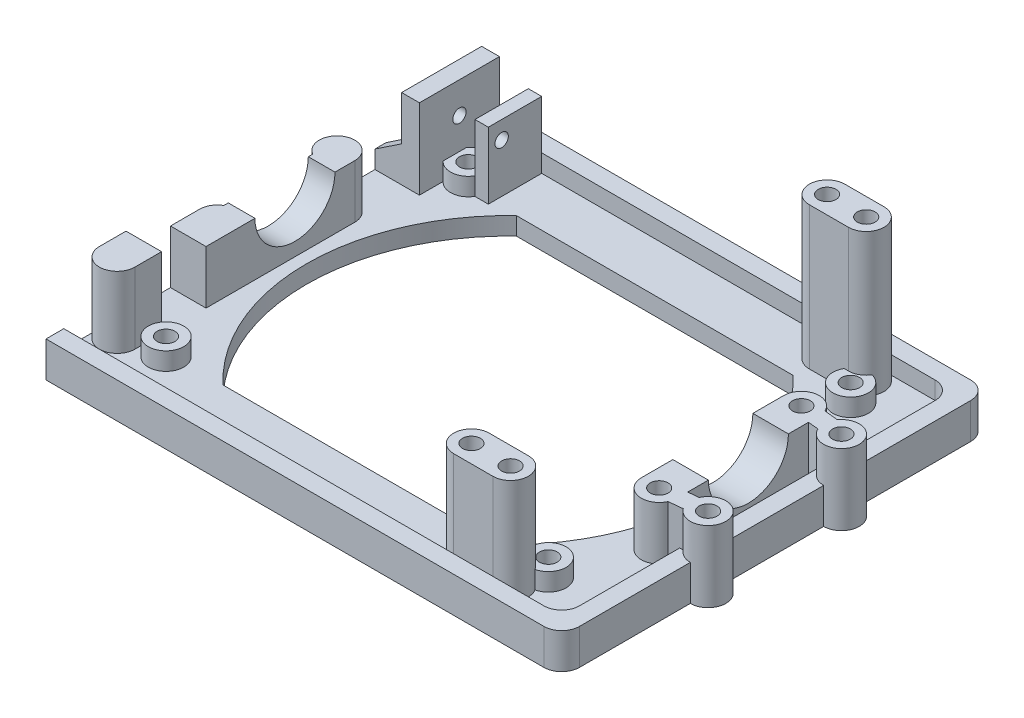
ISO-10303-21;
HEADER;
FILE_DESCRIPTION(('STEP AP214'),'2;1');
FILE_NAME('part.step','',(''),(''),'','','');
FILE_SCHEMA(('AUTOMOTIVE_DESIGN { 1 0 10303 214 1 1 1 1 }'));
ENDSEC;
DATA;
#1=APPLICATION_CONTEXT('core data for automotive mechanical design processes');
#2=APPLICATION_PROTOCOL_DEFINITION('international standard','automotive_design',2000,#1);
#3=PRODUCT_CONTEXT('',#1,'mechanical');
#4=PRODUCT('Part','Part','',(#3));
#5=PRODUCT_RELATED_PRODUCT_CATEGORY('part','',(#4));
#6=PRODUCT_DEFINITION_FORMATION('','',#4);
#7=PRODUCT_DEFINITION_CONTEXT('part definition',#1,'design');
#8=PRODUCT_DEFINITION('design','',#6,#7);
#9=PRODUCT_DEFINITION_SHAPE('','',#8);
#10=(LENGTH_UNIT() NAMED_UNIT(*) SI_UNIT(.MILLI.,.METRE.));
#11=(NAMED_UNIT(*) PLANE_ANGLE_UNIT() SI_UNIT($,.RADIAN.));
#12=(NAMED_UNIT(*) SI_UNIT($,.STERADIAN.) SOLID_ANGLE_UNIT());
#13=UNCERTAINTY_MEASURE_WITH_UNIT(LENGTH_MEASURE(1.E-05),#10,'distance_accuracy_value','');
#14=(GEOMETRIC_REPRESENTATION_CONTEXT(3) GLOBAL_UNCERTAINTY_ASSIGNED_CONTEXT((#13)) GLOBAL_UNIT_ASSIGNED_CONTEXT((#10,
#11,#12)) REPRESENTATION_CONTEXT('',''));
#15=CARTESIAN_POINT('',(0.,0.,0.));
#16=DIRECTION('',(0.,0.,1.));
#17=DIRECTION('',(1.,0.,0.));
#18=AXIS2_PLACEMENT_3D('',#15,#16,#17);
#19=CARTESIAN_POINT('',(25.8041237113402,2.,18.9889179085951));
#20=DIRECTION('',(0.,1.,0.));
#21=DIRECTION('',(0.,0.,1.));
#22=AXIS2_PLACEMENT_3D('',#19,#20,#21);
#23=PLANE('',#22);
#24=CARTESIAN_POINT('',(18.0541237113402,2.,-23.0110820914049));
#25=DIRECTION('',(0.,-1.,0.));
#26=DIRECTION('',(0.,0.,-1.));
#27=AXIS2_PLACEMENT_3D('',#24,#25,#26);
#28=CIRCLE('',#27,1.);
#29=CARTESIAN_POINT('',(18.0541237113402,2.,-24.0110820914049));
#30=VERTEX_POINT('',#29);
#31=EDGE_CURVE('E20',#30,#30,#28,.F.);
#32=ORIENTED_EDGE('',*,*,#31,.T.);
#33=EDGE_LOOP('',(#32));
#34=FACE_BOUND('',#33,.T.);
#35=ADVANCED_FACE('F17',(#34),#23,.T.);
#36=CARTESIAN_POINT('',(25.8041237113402,2.,18.9889179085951));
#37=DIRECTION('',(0.,1.,0.));
#38=DIRECTION('',(0.,0.,1.));
#39=AXIS2_PLACEMENT_3D('',#36,#37,#38);
#40=PLANE('',#39);
#41=CARTESIAN_POINT('',(13.6541237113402,2.,-23.0110820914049));
#42=DIRECTION('',(0.,-1.,0.));
#43=DIRECTION('',(0.,0.,-1.));
#44=AXIS2_PLACEMENT_3D('',#41,#42,#43);
#45=CIRCLE('',#44,1.);
#46=CARTESIAN_POINT('',(13.6541237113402,2.,-24.0110820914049));
#47=VERTEX_POINT('',#46);
#48=EDGE_CURVE('E1031',#47,#47,#45,.F.);
#49=ORIENTED_EDGE('',*,*,#48,.T.);
#50=EDGE_LOOP('',(#49));
#51=FACE_BOUND('',#50,.T.);
#52=ADVANCED_FACE('F1489',(#51),#40,.T.);
#53=CARTESIAN_POINT('',(25.8041237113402,2.,18.9889179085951));
#54=DIRECTION('',(0.,1.,0.));
#55=DIRECTION('',(0.,0.,1.));
#56=AXIS2_PLACEMENT_3D('',#53,#54,#55);
#57=PLANE('',#56);
#58=CARTESIAN_POINT('',(18.0541237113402,2.,16.9889179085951));
#59=DIRECTION('',(0.,-1.,0.));
#60=DIRECTION('',(0.,0.,-1.));
#61=AXIS2_PLACEMENT_3D('',#58,#59,#60);
#62=CIRCLE('',#61,1.);
#63=CARTESIAN_POINT('',(18.0541237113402,2.,15.9889179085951));
#64=VERTEX_POINT('',#63);
#65=EDGE_CURVE('E1029',#64,#64,#62,.F.);
#66=ORIENTED_EDGE('',*,*,#65,.T.);
#67=EDGE_LOOP('',(#66));
#68=FACE_BOUND('',#67,.T.);
#69=ADVANCED_FACE('F1053',(#68),#57,.T.);
#70=CARTESIAN_POINT('',(25.8041237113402,2.,18.9889179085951));
#71=DIRECTION('',(0.,1.,0.));
#72=DIRECTION('',(0.,0.,1.));
#73=AXIS2_PLACEMENT_3D('',#70,#71,#72);
#74=PLANE('',#73);
#75=CARTESIAN_POINT('',(13.6541237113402,2.,16.9889179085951));
#76=DIRECTION('',(0.,-1.,0.));
#77=DIRECTION('',(0.,0.,-1.));
#78=AXIS2_PLACEMENT_3D('',#75,#76,#77);
#79=CIRCLE('',#78,1.);
#80=CARTESIAN_POINT('',(13.6541237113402,2.,15.9889179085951));
#81=VERTEX_POINT('',#80);
#82=EDGE_CURVE('E685',#81,#81,#79,.F.);
#83=ORIENTED_EDGE('',*,*,#82,.T.);
#84=EDGE_LOOP('',(#83));
#85=FACE_BOUND('',#84,.T.);
#86=ADVANCED_FACE('F1042',(#85),#74,.T.);
#87=CARTESIAN_POINT('',(18.0541237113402,18.,-23.0110820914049));
#88=DIRECTION('',(0.,-1.,0.));
#89=DIRECTION('',(0.,0.,-1.));
#90=AXIS2_PLACEMENT_3D('',#87,#88,#89);
#91=CYLINDRICAL_SURFACE('',#90,1.);
#92=CARTESIAN_POINT('',(18.0541237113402,18.,-23.0110820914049));
#93=DIRECTION('',(0.,-1.,0.));
#94=DIRECTION('',(0.,0.,-1.));
#95=AXIS2_PLACEMENT_3D('',#92,#93,#94);
#96=CIRCLE('',#95,1.);
#97=CARTESIAN_POINT('',(18.0541237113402,18.,-24.0110820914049));
#98=VERTEX_POINT('',#97);
#99=EDGE_CURVE('E669',#98,#98,#96,.T.);
#100=ORIENTED_EDGE('',*,*,#99,.F.);
#101=EDGE_LOOP('',(#100));
#102=FACE_BOUND('',#101,.T.);
#103=ORIENTED_EDGE('',*,*,#31,.F.);
#104=EDGE_LOOP('',(#103));
#105=FACE_BOUND('',#104,.T.);
#106=ADVANCED_FACE('F1039',(#102,#105),#91,.F.);
#107=CARTESIAN_POINT('',(13.6541237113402,18.,-23.0110820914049));
#108=DIRECTION('',(0.,-1.,0.));
#109=DIRECTION('',(0.,0.,-1.));
#110=AXIS2_PLACEMENT_3D('',#107,#108,#109);
#111=CYLINDRICAL_SURFACE('',#110,1.);
#112=CARTESIAN_POINT('',(13.6541237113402,18.,-23.0110820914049));
#113=DIRECTION('',(0.,-1.,0.));
#114=DIRECTION('',(0.,0.,-1.));
#115=AXIS2_PLACEMENT_3D('',#112,#113,#114);
#116=CIRCLE('',#115,1.);
#117=CARTESIAN_POINT('',(13.6541237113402,18.,-24.0110820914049));
#118=VERTEX_POINT('',#117);
#119=EDGE_CURVE('E1022',#118,#118,#116,.T.);
#120=ORIENTED_EDGE('',*,*,#119,.F.);
#121=EDGE_LOOP('',(#120));
#122=FACE_BOUND('',#121,.T.);
#123=ORIENTED_EDGE('',*,*,#48,.F.);
#124=EDGE_LOOP('',(#123));
#125=FACE_BOUND('',#124,.T.);
#126=ADVANCED_FACE('F1041',(#122,#125),#111,.F.);
#127=CARTESIAN_POINT('',(18.0541237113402,13.75,16.9889179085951));
#128=DIRECTION('',(0.,-1.,0.));
#129=DIRECTION('',(0.,0.,-1.));
#130=AXIS2_PLACEMENT_3D('',#127,#128,#129);
#131=CYLINDRICAL_SURFACE('',#130,1.);
#132=CARTESIAN_POINT('',(18.0541237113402,13.75,16.9889179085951));
#133=DIRECTION('',(0.,-1.,0.));
#134=DIRECTION('',(0.,0.,-1.));
#135=AXIS2_PLACEMENT_3D('',#132,#133,#134);
#136=CIRCLE('',#135,1.);
#137=CARTESIAN_POINT('',(18.0541237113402,13.75,15.9889179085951));
#138=VERTEX_POINT('',#137);
#139=EDGE_CURVE('E1019',#138,#138,#136,.T.);
#140=ORIENTED_EDGE('',*,*,#139,.F.);
#141=EDGE_LOOP('',(#140));
#142=FACE_BOUND('',#141,.T.);
#143=ORIENTED_EDGE('',*,*,#65,.F.);
#144=EDGE_LOOP('',(#143));
#145=FACE_BOUND('',#144,.T.);
#146=ADVANCED_FACE('F1050',(#142,#145),#131,.F.);
#147=CARTESIAN_POINT('',(13.6541237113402,13.75,16.9889179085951));
#148=DIRECTION('',(0.,-1.,0.));
#149=DIRECTION('',(0.,0.,-1.));
#150=AXIS2_PLACEMENT_3D('',#147,#148,#149);
#151=CYLINDRICAL_SURFACE('',#150,1.);
#152=CARTESIAN_POINT('',(13.6541237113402,13.75,16.9889179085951));
#153=DIRECTION('',(0.,-1.,0.));
#154=DIRECTION('',(0.,0.,-1.));
#155=AXIS2_PLACEMENT_3D('',#152,#153,#154);
#156=CIRCLE('',#155,1.);
#157=CARTESIAN_POINT('',(13.6541237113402,13.75,15.9889179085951));
#158=VERTEX_POINT('',#157);
#159=EDGE_CURVE('E1016',#158,#158,#156,.T.);
#160=ORIENTED_EDGE('',*,*,#159,.F.);
#161=EDGE_LOOP('',(#160));
#162=FACE_BOUND('',#161,.T.);
#163=ORIENTED_EDGE('',*,*,#82,.F.);
#164=EDGE_LOOP('',(#163));
#165=FACE_BOUND('',#164,.T.);
#166=ADVANCED_FACE('F1475',(#162,#165),#151,.F.);
#167=CARTESIAN_POINT('',(22.8041237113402,4.,-10.9767447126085));
#168=DIRECTION('',(0.,1.,0.));
#169=DIRECTION('',(0.,0.,1.));
#170=AXIS2_PLACEMENT_3D('',#167,#168,#169);
#171=PLANE('',#170);
#172=CARTESIAN_POINT('',(22.8041237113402,4.,-10.9767447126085));
#173=DIRECTION('',(0.,1.,0.));
#174=DIRECTION('',(0.,0.,1.));
#175=AXIS2_PLACEMENT_3D('',#172,#173,#174);
#176=CIRCLE('',#175,1.);
#177=CARTESIAN_POINT('',(22.8041237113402,4.,-9.97674471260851));
#178=VERTEX_POINT('',#177);
#179=EDGE_CURVE('E1013',#178,#178,#176,.T.);
#180=ORIENTED_EDGE('',*,*,#179,.T.);
#181=EDGE_LOOP('',(#180));
#182=FACE_BOUND('',#181,.T.);
#183=ADVANCED_FACE('F1471',(#182),#171,.T.);
#184=CARTESIAN_POINT('',(27.8041237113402,3.,-10.4767447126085));
#185=DIRECTION('',(0.,1.,0.));
#186=DIRECTION('',(0.,0.,1.));
#187=AXIS2_PLACEMENT_3D('',#184,#185,#186);
#188=PLANE('',#187);
#189=CARTESIAN_POINT('',(27.8041237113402,3.,-10.4767447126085));
#190=DIRECTION('',(0.,1.,0.));
#191=DIRECTION('',(0.,0.,1.));
#192=AXIS2_PLACEMENT_3D('',#189,#190,#191);
#193=CIRCLE('',#192,1.);
#194=CARTESIAN_POINT('',(27.8041237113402,3.,-9.4767447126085));
#195=VERTEX_POINT('',#194);
#196=EDGE_CURVE('E568',#195,#195,#193,.T.);
#197=ORIENTED_EDGE('',*,*,#196,.T.);
#198=EDGE_LOOP('',(#197));
#199=FACE_BOUND('',#198,.T.);
#200=ADVANCED_FACE('F1467',(#199),#188,.T.);
#201=CARTESIAN_POINT('',(22.8041237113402,4.,5.02325528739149));
#202=DIRECTION('',(0.,1.,0.));
#203=DIRECTION('',(0.,0.,1.));
#204=AXIS2_PLACEMENT_3D('',#201,#202,#203);
#205=PLANE('',#204);
#206=CARTESIAN_POINT('',(22.8041237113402,4.,5.02325528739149));
#207=DIRECTION('',(0.,1.,0.));
#208=DIRECTION('',(0.,0.,1.));
#209=AXIS2_PLACEMENT_3D('',#206,#207,#208);
#210=CIRCLE('',#209,1.);
#211=CARTESIAN_POINT('',(22.8041237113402,4.,6.02325528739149));
#212=VERTEX_POINT('',#211);
#213=EDGE_CURVE('E602',#212,#212,#210,.T.);
#214=ORIENTED_EDGE('',*,*,#213,.T.);
#215=EDGE_LOOP('',(#214));
#216=FACE_BOUND('',#215,.T.);
#217=ADVANCED_FACE('F1463',(#216),#205,.T.);
#218=CARTESIAN_POINT('',(27.8041237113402,3.,4.52325528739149));
#219=DIRECTION('',(0.,1.,0.));
#220=DIRECTION('',(0.,0.,1.));
#221=AXIS2_PLACEMENT_3D('',#218,#219,#220);
#222=PLANE('',#221);
#223=CARTESIAN_POINT('',(27.8041237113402,3.,4.52325528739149));
#224=DIRECTION('',(0.,1.,0.));
#225=DIRECTION('',(0.,0.,1.));
#226=AXIS2_PLACEMENT_3D('',#223,#224,#225);
#227=CIRCLE('',#226,1.);
#228=CARTESIAN_POINT('',(27.8041237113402,3.,5.5232552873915));
#229=VERTEX_POINT('',#228);
#230=EDGE_CURVE('E721',#229,#229,#227,.T.);
#231=ORIENTED_EDGE('',*,*,#230,.T.);
#232=EDGE_LOOP('',(#231));
#233=FACE_BOUND('',#232,.T.);
#234=ADVANCED_FACE('F1459',(#233),#222,.T.);
#235=CARTESIAN_POINT('',(25.8041237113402,2.,18.9889179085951));
#236=DIRECTION('',(0.,1.,0.));
#237=DIRECTION('',(0.,0.,1.));
#238=AXIS2_PLACEMENT_3D('',#235,#236,#237);
#239=PLANE('',#238);
#240=DIRECTION('',(0.995037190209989,0.,0.0995037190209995));
#241=VECTOR('',#240,1.);
#242=CARTESIAN_POINT('',(25.9811650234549,2.,-9.65405301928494));
#243=LINE('',#242,#241);
#244=CARTESIAN_POINT('',(24.8041237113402,2.,-9.77175715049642));
#245=VERTEX_POINT('',#244);
#246=CARTESIAN_POINT('',(25.8041237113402,2.,-9.67175715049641));
#247=VERTEX_POINT('',#246);
#248=EDGE_CURVE('E563',#245,#247,#243,.T.);
#249=ORIENTED_EDGE('',*,*,#248,.F.);
#250=DIRECTION('',(0.,0.,-1.));
#251=VECTOR('',#250,1.);
#252=CARTESIAN_POINT('',(24.8041237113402,2.,3.8182677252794));
#253=LINE('',#252,#251);
#254=CARTESIAN_POINT('',(24.8041237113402,2.,3.8182677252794));
#255=VERTEX_POINT('',#254);
#256=EDGE_CURVE('E585',#255,#245,#253,.T.);
#257=ORIENTED_EDGE('',*,*,#256,.F.);
#258=DIRECTION('',(-0.995037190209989,0.,0.0995037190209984));
#259=VECTOR('',#258,1.);
#260=CARTESIAN_POINT('',(25.9811650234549,2.,3.70056359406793));
#261=LINE('',#260,#259);
#262=CARTESIAN_POINT('',(25.8041237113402,2.,3.7182677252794));
#263=VERTEX_POINT('',#262);
#264=EDGE_CURVE('E724',#263,#255,#261,.T.);
#265=ORIENTED_EDGE('',*,*,#264,.F.);
#266=DIRECTION('',(0.,0.,-1.));
#267=VECTOR('',#266,1.);
#268=CARTESIAN_POINT('',(25.8041237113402,2.,16.9889179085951));
#269=LINE('',#268,#267);
#270=EDGE_CURVE('E729',#263,#247,#269,.T.);
#271=ORIENTED_EDGE('',*,*,#270,.T.);
#272=EDGE_LOOP('',(#249,#257,#265,#271));
#273=FACE_BOUND('',#272,.T.);
#274=ADVANCED_FACE('F1455',(#273),#239,.T.);
#275=CARTESIAN_POINT('',(0.,8.,0.));
#276=DIRECTION('',(0.,1.,0.));
#277=DIRECTION('',(0.,0.,1.));
#278=AXIS2_PLACEMENT_3D('',#275,#276,#277);
#279=PLANE('',#278);
#280=CARTESIAN_POINT('',(-28.1958762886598,8.,-9.74313289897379));
#281=DIRECTION('',(0.,-1.,0.));
#282=DIRECTION('',(0.,0.,-1.));
#283=AXIS2_PLACEMENT_3D('',#280,#281,#282);
#284=CIRCLE('',#283,2.);
#285=CARTESIAN_POINT('',(-29.1958762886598,8.,-8.01108209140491));
#286=VERTEX_POINT('',#285);
#287=CARTESIAN_POINT('',(-26.1958762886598,8.,-9.74313289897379));
#288=VERTEX_POINT('',#287);
#289=EDGE_CURVE('E989',#286,#288,#284,.T.);
#290=ORIENTED_EDGE('',*,*,#289,.F.);
#291=DIRECTION('',(0.,0.,-1.));
#292=VECTOR('',#291,1.);
#293=CARTESIAN_POINT('',(-29.1958762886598,8.,1.98891790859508));
#294=LINE('',#293,#292);
#295=CARTESIAN_POINT('',(-29.1958762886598,8.,-7.51108209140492));
#296=VERTEX_POINT('',#295);
#297=EDGE_CURVE('E1006',#286,#296,#294,.F.);
#298=ORIENTED_EDGE('',*,*,#297,.T.);
#299=DIRECTION('',(1.,0.,0.));
#300=VECTOR('',#299,1.);
#301=CARTESIAN_POINT('',(-30.1968762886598,8.,-7.51108209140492));
#302=LINE('',#301,#300);
#303=CARTESIAN_POINT('',(-26.1958762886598,8.,-7.51108209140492));
#304=VERTEX_POINT('',#303);
#305=EDGE_CURVE('E603',#296,#304,#302,.T.);
#306=ORIENTED_EDGE('',*,*,#305,.T.);
#307=DIRECTION('',(0.,0.,1.));
#308=VECTOR('',#307,1.);
#309=CARTESIAN_POINT('',(-26.1958762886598,8.,6.98891790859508));
#310=LINE('',#309,#308);
#311=EDGE_CURVE('E988',#304,#288,#310,.F.);
#312=ORIENTED_EDGE('',*,*,#311,.T.);
#313=EDGE_LOOP('',(#290,#298,#306,#312));
#314=FACE_BOUND('',#313,.T.);
#315=ADVANCED_FACE('F1452',(#314),#279,.T.);
#316=CARTESIAN_POINT('',(-21.9458762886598,4.,-19.0110820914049));
#317=DIRECTION('',(0.,0.,-1.));
#318=DIRECTION('',(-1.,0.,0.));
#319=AXIS2_PLACEMENT_3D('',#316,#317,#318);
#320=PLANE('',#319);
#321=DIRECTION('',(-1.,0.,0.));
#322=VECTOR('',#321,1.);
#323=CARTESIAN_POINT('',(-21.9458762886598,2.,-19.0110820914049));
#324=LINE('',#323,#322);
#325=CARTESIAN_POINT('',(-20.4458762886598,2.,-19.0110820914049));
#326=VERTEX_POINT('',#325);
#327=CARTESIAN_POINT('',(-21.9458762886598,2.,-19.0110820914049));
#328=VERTEX_POINT('',#327);
#329=EDGE_CURVE('E421',#326,#328,#324,.T.);
#330=ORIENTED_EDGE('',*,*,#329,.F.);
#331=DIRECTION('',(0.,1.,0.));
#332=VECTOR('',#331,1.);
#333=CARTESIAN_POINT('',(-20.4458762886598,4.,-19.0110820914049));
#334=LINE('',#333,#332);
#335=CARTESIAN_POINT('',(-20.4458762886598,9.5,-19.0110820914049));
#336=VERTEX_POINT('',#335);
#337=EDGE_CURVE('E702',#326,#336,#334,.T.);
#338=ORIENTED_EDGE('',*,*,#337,.T.);
#339=DIRECTION('',(1.,0.,0.));
#340=VECTOR('',#339,1.);
#341=CARTESIAN_POINT('',(0.,9.5,-19.0110820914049));
#342=LINE('',#341,#340);
#343=CARTESIAN_POINT('',(-21.9458762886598,9.5,-19.0110820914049));
#344=VERTEX_POINT('',#343);
#345=EDGE_CURVE('E675',#344,#336,#342,.T.);
#346=ORIENTED_EDGE('',*,*,#345,.F.);
#347=DIRECTION('',(0.,1.,0.));
#348=VECTOR('',#347,1.);
#349=CARTESIAN_POINT('',(-21.9458762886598,4.,-19.0110820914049));
#350=LINE('',#349,#348);
#351=EDGE_CURVE('E590',#328,#344,#350,.T.);
#352=ORIENTED_EDGE('',*,*,#351,.F.);
#353=EDGE_LOOP('',(#330,#338,#346,#352));
#354=FACE_BOUND('',#353,.T.);
#355=ADVANCED_FACE('F1448',(#354),#320,.F.);
#356=CARTESIAN_POINT('',(0.,9.5,0.));
#357=DIRECTION('',(0.,1.,0.));
#358=DIRECTION('',(0.,0.,1.));
#359=AXIS2_PLACEMENT_3D('',#356,#357,#358);
#360=PLANE('',#359);
#361=DIRECTION('',(0.,0.,1.));
#362=VECTOR('',#361,1.);
#363=CARTESIAN_POINT('',(-20.4458762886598,9.5,-19.0110820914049));
#364=LINE('',#363,#362);
#365=CARTESIAN_POINT('',(-20.4458762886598,9.5,-25.0110820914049));
#366=VERTEX_POINT('',#365);
#367=EDGE_CURVE('E694',#336,#366,#364,.F.);
#368=ORIENTED_EDGE('',*,*,#367,.T.);
#369=DIRECTION('',(1.,0.,0.));
#370=VECTOR('',#369,1.);
#371=CARTESIAN_POINT('',(-21.9458762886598,9.5,-25.0110820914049));
#372=LINE('',#371,#370);
#373=CARTESIAN_POINT('',(-21.9458762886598,9.5,-25.0110820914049));
#374=VERTEX_POINT('',#373);
#375=EDGE_CURVE('E670',#366,#374,#372,.F.);
#376=ORIENTED_EDGE('',*,*,#375,.T.);
#377=DIRECTION('',(0.,0.,1.));
#378=VECTOR('',#377,1.);
#379=CARTESIAN_POINT('',(-21.9458762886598,9.5,-25.0110820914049));
#380=LINE('',#379,#378);
#381=EDGE_CURVE('E664',#344,#374,#380,.F.);
#382=ORIENTED_EDGE('',*,*,#381,.F.);
#383=ORIENTED_EDGE('',*,*,#345,.T.);
#384=EDGE_LOOP('',(#368,#376,#382,#383));
#385=FACE_BOUND('',#384,.T.);
#386=ADVANCED_FACE('F1444',(#385),#360,.T.);
#387=CARTESIAN_POINT('',(-21.9458762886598,9.5,-25.0110820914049));
#388=DIRECTION('',(0.,0.,1.));
#389=DIRECTION('',(1.,0.,0.));
#390=AXIS2_PLACEMENT_3D('',#387,#388,#389);
#391=PLANE('',#390);
#392=DIRECTION('',(1.,0.,0.));
#393=VECTOR('',#392,1.);
#394=CARTESIAN_POINT('',(-21.9458762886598,4.,-25.0110820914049));
#395=LINE('',#394,#393);
#396=CARTESIAN_POINT('',(-21.9458762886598,4.,-25.0110820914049));
#397=VERTEX_POINT('',#396);
#398=CARTESIAN_POINT('',(-20.4458762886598,4.,-25.0110820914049));
#399=VERTEX_POINT('',#398);
#400=EDGE_CURVE('E667',#397,#399,#395,.T.);
#401=ORIENTED_EDGE('',*,*,#400,.F.);
#402=DIRECTION('',(0.,1.,0.));
#403=VECTOR('',#402,1.);
#404=CARTESIAN_POINT('',(-21.9458762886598,4.,-25.0110820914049));
#405=LINE('',#404,#403);
#406=EDGE_CURVE('E659',#374,#397,#405,.F.);
#407=ORIENTED_EDGE('',*,*,#406,.F.);
#408=ORIENTED_EDGE('',*,*,#375,.F.);
#409=DIRECTION('',(0.,1.,0.));
#410=VECTOR('',#409,1.);
#411=CARTESIAN_POINT('',(-20.4458762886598,4.,-25.0110820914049));
#412=LINE('',#411,#410);
#413=EDGE_CURVE('E690',#366,#399,#412,.F.);
#414=ORIENTED_EDGE('',*,*,#413,.T.);
#415=EDGE_LOOP('',(#401,#407,#408,#414));
#416=FACE_BOUND('',#415,.T.);
#417=ADVANCED_FACE('F1440',(#416),#391,.F.);
#418=CARTESIAN_POINT('',(-18.3245559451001,7.5,-20.5110820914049));
#419=DIRECTION('',(-1.,0.,0.));
#420=DIRECTION('',(0.,0.,1.));
#421=AXIS2_PLACEMENT_3D('',#418,#419,#420);
#422=CYLINDRICAL_SURFACE('',#421,0.750000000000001);
#423=CARTESIAN_POINT('',(-21.9458762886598,7.5,-20.5110820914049));
#424=DIRECTION('',(-1.,0.,0.));
#425=DIRECTION('',(0.,0.,1.));
#426=AXIS2_PLACEMENT_3D('',#423,#424,#425);
#427=CIRCLE('',#426,0.750000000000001);
#428=CARTESIAN_POINT('',(-21.9458762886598,7.5,-19.7610820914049));
#429=VERTEX_POINT('',#428);
#430=EDGE_CURVE('E981',#429,#429,#427,.F.);
#431=ORIENTED_EDGE('',*,*,#430,.F.);
#432=EDGE_LOOP('',(#431));
#433=FACE_BOUND('',#432,.T.);
#434=CARTESIAN_POINT('',(-20.4458762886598,7.5,-20.5110820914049));
#435=DIRECTION('',(-1.,0.,0.));
#436=DIRECTION('',(0.,0.,1.));
#437=AXIS2_PLACEMENT_3D('',#434,#435,#436);
#438=CIRCLE('',#437,0.750000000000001);
#439=CARTESIAN_POINT('',(-20.4458762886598,7.5,-19.7610820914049));
#440=VERTEX_POINT('',#439);
#441=EDGE_CURVE('E704',#440,#440,#438,.F.);
#442=ORIENTED_EDGE('',*,*,#441,.T.);
#443=EDGE_LOOP('',(#442));
#444=FACE_BOUND('',#443,.T.);
#445=ADVANCED_FACE('F1436',(#433,#444),#422,.F.);
#446=CARTESIAN_POINT('',(-18.3245559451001,7.5,-20.5110820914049));
#447=DIRECTION('',(-1.,0.,0.));
#448=DIRECTION('',(0.,0.,1.));
#449=AXIS2_PLACEMENT_3D('',#446,#447,#448);
#450=CYLINDRICAL_SURFACE('',#449,0.750000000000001);
#451=CARTESIAN_POINT('',(-25.1958762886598,7.5,-20.5110820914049));
#452=DIRECTION('',(-1.,0.,0.));
#453=DIRECTION('',(0.,0.,1.));
#454=AXIS2_PLACEMENT_3D('',#451,#452,#453);
#455=CIRCLE('',#454,0.750000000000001);
#456=CARTESIAN_POINT('',(-25.1958762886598,7.5,-19.7610820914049));
#457=VERTEX_POINT('',#456);
#458=EDGE_CURVE('E975',#457,#457,#455,.T.);
#459=ORIENTED_EDGE('',*,*,#458,.F.);
#460=EDGE_LOOP('',(#459));
#461=FACE_BOUND('',#460,.T.);
#462=CARTESIAN_POINT('',(-27.1958762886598,7.5,-20.5110820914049));
#463=DIRECTION('',(-1.,0.,0.));
#464=DIRECTION('',(0.,0.,1.));
#465=AXIS2_PLACEMENT_3D('',#462,#463,#464);
#466=CIRCLE('',#465,0.750000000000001);
#467=CARTESIAN_POINT('',(-27.1958762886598,7.5,-19.7610820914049));
#468=VERTEX_POINT('',#467);
#469=EDGE_CURVE('E1007',#468,#468,#466,.T.);
#470=ORIENTED_EDGE('',*,*,#469,.T.);
#471=EDGE_LOOP('',(#470));
#472=FACE_BOUND('',#471,.T.);
#473=ADVANCED_FACE('F1432',(#461,#472),#450,.F.);
#474=CARTESIAN_POINT('',(25.8041237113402,2.,18.9889179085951));
#475=DIRECTION('',(0.,1.,0.));
#476=DIRECTION('',(0.,0.,1.));
#477=AXIS2_PLACEMENT_3D('',#474,#475,#476);
#478=PLANE('',#477);
#479=CARTESIAN_POINT('',(-23.6958762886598,2.,-20.0110820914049));
#480=DIRECTION('',(0.,-1.,0.));
#481=DIRECTION('',(0.,0.,-1.));
#482=AXIS2_PLACEMENT_3D('',#479,#480,#481);
#483=CIRCLE('',#482,1.99999999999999);
#484=CARTESIAN_POINT('',(-21.9458762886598,2.,-20.9793279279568));
#485=VERTEX_POINT('',#484);
#486=CARTESIAN_POINT('',(-25.1958762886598,2.,-21.3339577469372));
#487=VERTEX_POINT('',#486);
#488=EDGE_CURVE('E374',#485,#487,#483,.F.);
#489=ORIENTED_EDGE('',*,*,#488,.F.);
#490=DIRECTION('',(0.,0.,1.));
#491=VECTOR('',#490,1.);
#492=CARTESIAN_POINT('',(-21.9458762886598,2.,-25.0110820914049));
#493=LINE('',#492,#491);
#494=CARTESIAN_POINT('',(-21.9458762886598,2.,-25.0110820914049));
#495=VERTEX_POINT('',#494);
#496=EDGE_CURVE('E651',#495,#485,#493,.T.);
#497=ORIENTED_EDGE('',*,*,#496,.F.);
#498=DIRECTION('',(1.,0.,0.));
#499=VECTOR('',#498,1.);
#500=CARTESIAN_POINT('',(-21.9458762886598,2.,-25.0110820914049));
#501=LINE('',#500,#499);
#502=CARTESIAN_POINT('',(-25.1958762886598,2.,-25.0110820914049));
#503=VERTEX_POINT('',#502);
#504=EDGE_CURVE('E621',#503,#495,#501,.T.);
#505=ORIENTED_EDGE('',*,*,#504,.F.);
#506=DIRECTION('',(0.,0.,-1.));
#507=VECTOR('',#506,1.);
#508=CARTESIAN_POINT('',(-25.1958762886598,2.,-21.3339577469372));
#509=LINE('',#508,#507);
#510=EDGE_CURVE('E382',#487,#503,#509,.T.);
#511=ORIENTED_EDGE('',*,*,#510,.F.);
#512=EDGE_LOOP('',(#489,#497,#505,#511));
#513=FACE_BOUND('',#512,.T.);
#514=ADVANCED_FACE('F1428',(#513),#478,.T.);
#515=CARTESIAN_POINT('',(13.6541237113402,18.,-23.0110820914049));
#516=DIRECTION('',(0.,1.,0.));
#517=DIRECTION('',(0.,0.,1.));
#518=AXIS2_PLACEMENT_3D('',#515,#516,#517);
#519=PLANE('',#518);
#520=ORIENTED_EDGE('',*,*,#119,.T.);
#521=EDGE_LOOP('',(#520));
#522=FACE_BOUND('',#521,.T.);
#523=CARTESIAN_POINT('',(18.0541237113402,18.,-23.0110820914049));
#524=DIRECTION('',(0.,-1.,0.));
#525=DIRECTION('',(0.,0.,-1.));
#526=AXIS2_PLACEMENT_3D('',#523,#524,#525);
#527=CIRCLE('',#526,2.);
#528=CARTESIAN_POINT('',(18.0541237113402,18.,-25.0110820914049));
#529=VERTEX_POINT('',#528);
#530=CARTESIAN_POINT('',(18.0541237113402,18.,-21.0110820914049));
#531=VERTEX_POINT('',#530);
#532=EDGE_CURVE('E616',#529,#531,#527,.T.);
#533=ORIENTED_EDGE('',*,*,#532,.F.);
#534=DIRECTION('',(1.,0.,0.));
#535=VECTOR('',#534,1.);
#536=CARTESIAN_POINT('',(18.0541237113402,18.,-25.0110820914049));
#537=LINE('',#536,#535);
#538=CARTESIAN_POINT('',(13.6541237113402,18.,-25.0110820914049));
#539=VERTEX_POINT('',#538);
#540=EDGE_CURVE('E535',#529,#539,#537,.F.);
#541=ORIENTED_EDGE('',*,*,#540,.T.);
#542=CARTESIAN_POINT('',(13.6541237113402,18.,-23.0110820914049));
#543=DIRECTION('',(0.,-1.,0.));
#544=DIRECTION('',(0.,0.,-1.));
#545=AXIS2_PLACEMENT_3D('',#542,#543,#544);
#546=CIRCLE('',#545,2.);
#547=CARTESIAN_POINT('',(13.6541237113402,18.,-21.0110820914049));
#548=VERTEX_POINT('',#547);
#549=EDGE_CURVE('E709',#548,#539,#546,.T.);
#550=ORIENTED_EDGE('',*,*,#549,.F.);
#551=DIRECTION('',(-1.,0.,0.));
#552=VECTOR('',#551,1.);
#553=CARTESIAN_POINT('',(18.0541237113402,18.,-21.0110820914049));
#554=LINE('',#553,#552);
#555=EDGE_CURVE('E610',#548,#531,#554,.F.);
#556=ORIENTED_EDGE('',*,*,#555,.T.);
#557=EDGE_LOOP('',(#533,#541,#550,#556));
#558=FACE_BOUND('',#557,.T.);
#559=ORIENTED_EDGE('',*,*,#99,.T.);
#560=EDGE_LOOP('',(#559));
#561=FACE_BOUND('',#560,.T.);
#562=ADVANCED_FACE('F1424',(#522,#558,#561),#519,.T.);
#563=CARTESIAN_POINT('',(13.6541237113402,13.75,16.9889179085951));
#564=DIRECTION('',(0.,1.,0.));
#565=DIRECTION('',(0.,0.,1.));
#566=AXIS2_PLACEMENT_3D('',#563,#564,#565);
#567=PLANE('',#566);
#568=ORIENTED_EDGE('',*,*,#159,.T.);
#569=EDGE_LOOP('',(#568));
#570=FACE_BOUND('',#569,.T.);
#571=CARTESIAN_POINT('',(18.0541237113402,13.75,16.9889179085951));
#572=DIRECTION('',(0.,-1.,0.));
#573=DIRECTION('',(0.,0.,-1.));
#574=AXIS2_PLACEMENT_3D('',#571,#572,#573);
#575=CIRCLE('',#574,2.00000000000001);
#576=CARTESIAN_POINT('',(18.0541237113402,13.75,14.9889179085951));
#577=VERTEX_POINT('',#576);
#578=CARTESIAN_POINT('',(18.0541237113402,13.75,18.9889179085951));
#579=VERTEX_POINT('',#578);
#580=EDGE_CURVE('E596',#577,#579,#575,.T.);
#581=ORIENTED_EDGE('',*,*,#580,.F.);
#582=DIRECTION('',(1.,0.,0.));
#583=VECTOR('',#582,1.);
#584=CARTESIAN_POINT('',(18.0541237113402,13.75,14.9889179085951));
#585=LINE('',#584,#583);
#586=CARTESIAN_POINT('',(13.6541237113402,13.75,14.9889179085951));
#587=VERTEX_POINT('',#586);
#588=EDGE_CURVE('E604',#577,#587,#585,.F.);
#589=ORIENTED_EDGE('',*,*,#588,.T.);
#590=CARTESIAN_POINT('',(13.6541237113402,13.75,16.9889179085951));
#591=DIRECTION('',(0.,-1.,0.));
#592=DIRECTION('',(0.,0.,-1.));
#593=AXIS2_PLACEMENT_3D('',#590,#591,#592);
#594=CIRCLE('',#593,2.);
#595=CARTESIAN_POINT('',(13.6541237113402,13.75,18.9889179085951));
#596=VERTEX_POINT('',#595);
#597=EDGE_CURVE('E556',#596,#587,#594,.T.);
#598=ORIENTED_EDGE('',*,*,#597,.F.);
#599=DIRECTION('',(-1.,0.,0.));
#600=VECTOR('',#599,1.);
#601=CARTESIAN_POINT('',(18.0541237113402,13.75,18.9889179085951));
#602=LINE('',#601,#600);
#603=EDGE_CURVE('E599',#596,#579,#602,.F.);
#604=ORIENTED_EDGE('',*,*,#603,.T.);
#605=EDGE_LOOP('',(#581,#589,#598,#604));
#606=FACE_BOUND('',#605,.T.);
#607=ORIENTED_EDGE('',*,*,#139,.T.);
#608=EDGE_LOOP('',(#607));
#609=FACE_BOUND('',#608,.T.);
#610=ADVANCED_FACE('F1420',(#570,#606,#609),#567,.T.);
#611=CARTESIAN_POINT('',(22.8041237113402,4.,-10.9767447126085));
#612=DIRECTION('',(0.,1.,0.));
#613=DIRECTION('',(0.,0.,1.));
#614=AXIS2_PLACEMENT_3D('',#611,#612,#613);
#615=CYLINDRICAL_SURFACE('',#614,1.);
#616=CARTESIAN_POINT('',(22.8041237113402,8.,-10.9767447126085));
#617=DIRECTION('',(0.,1.,0.));
#618=DIRECTION('',(0.,0.,1.));
#619=AXIS2_PLACEMENT_3D('',#616,#617,#618);
#620=CIRCLE('',#619,1.);
#621=CARTESIAN_POINT('',(22.8041237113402,8.,-9.97674471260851));
#622=VERTEX_POINT('',#621);
#623=EDGE_CURVE('E967',#622,#622,#620,.T.);
#624=ORIENTED_EDGE('',*,*,#623,.T.);
#625=EDGE_LOOP('',(#624));
#626=FACE_BOUND('',#625,.T.);
#627=ORIENTED_EDGE('',*,*,#179,.F.);
#628=EDGE_LOOP('',(#627));
#629=FACE_BOUND('',#628,.T.);
#630=ADVANCED_FACE('F1416',(#626,#629),#615,.F.);
#631=CARTESIAN_POINT('',(27.8041237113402,3.,-10.4767447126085));
#632=DIRECTION('',(0.,1.,0.));
#633=DIRECTION('',(0.,0.,1.));
#634=AXIS2_PLACEMENT_3D('',#631,#632,#633);
#635=CYLINDRICAL_SURFACE('',#634,1.);
#636=CARTESIAN_POINT('',(27.8041237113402,8.,-10.4767447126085));
#637=DIRECTION('',(0.,1.,0.));
#638=DIRECTION('',(0.,0.,1.));
#639=AXIS2_PLACEMENT_3D('',#636,#637,#638);
#640=CIRCLE('',#639,1.);
#641=CARTESIAN_POINT('',(27.8041237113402,8.,-9.4767447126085));
#642=VERTEX_POINT('',#641);
#643=EDGE_CURVE('E575',#642,#642,#640,.T.);
#644=ORIENTED_EDGE('',*,*,#643,.T.);
#645=EDGE_LOOP('',(#644));
#646=FACE_BOUND('',#645,.T.);
#647=ORIENTED_EDGE('',*,*,#196,.F.);
#648=EDGE_LOOP('',(#647));
#649=FACE_BOUND('',#648,.T.);
#650=ADVANCED_FACE('F1412',(#646,#649),#635,.F.);
#651=CARTESIAN_POINT('',(25.9811650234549,8.,-9.65405301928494));
#652=DIRECTION('',(-0.0995037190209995,0.,0.995037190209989));
#653=DIRECTION('',(0.995037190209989,0.,0.0995037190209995));
#654=AXIS2_PLACEMENT_3D('',#651,#652,#653);
#655=PLANE('',#654);
#656=DIRECTION('',(0.,1.,0.));
#657=VECTOR('',#656,1.);
#658=CARTESIAN_POINT('',(24.8041237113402,8.,-9.77175715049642));
#659=LINE('',#658,#657);
#660=CARTESIAN_POINT('',(24.8041237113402,8.,-9.77175715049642));
#661=VERTEX_POINT('',#660);
#662=EDGE_CURVE('E582',#245,#661,#659,.T.);
#663=ORIENTED_EDGE('',*,*,#662,.F.);
#664=ORIENTED_EDGE('',*,*,#248,.T.);
#665=DIRECTION('',(0.,1.,0.));
#666=VECTOR('',#665,1.);
#667=CARTESIAN_POINT('',(25.8041237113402,4.,-9.67175715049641));
#668=LINE('',#667,#666);
#669=CARTESIAN_POINT('',(25.8041237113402,4.,-9.67175715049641));
#670=VERTEX_POINT('',#669);
#671=EDGE_CURVE('E738',#247,#670,#668,.T.);
#672=ORIENTED_EDGE('',*,*,#671,.T.);
#673=DIRECTION('',(0.995037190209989,0.,0.0995037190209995));
#674=VECTOR('',#673,1.);
#675=CARTESIAN_POINT('',(25.9811650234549,4.,-9.65405301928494));
#676=LINE('',#675,#674);
#677=CARTESIAN_POINT('',(25.9811650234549,4.,-9.65405301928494));
#678=VERTEX_POINT('',#677);
#679=EDGE_CURVE('E566',#670,#678,#676,.T.);
#680=ORIENTED_EDGE('',*,*,#679,.T.);
#681=DIRECTION('',(0.,-1.,0.));
#682=VECTOR('',#681,1.);
#683=CARTESIAN_POINT('',(25.9811650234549,8.,-9.65405301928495));
#684=LINE('',#683,#682);
#685=CARTESIAN_POINT('',(25.9811650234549,8.,-9.65405301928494));
#686=VERTEX_POINT('',#685);
#687=EDGE_CURVE('E552',#686,#678,#684,.T.);
#688=ORIENTED_EDGE('',*,*,#687,.F.);
#689=DIRECTION('',(-0.995037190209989,0.,-0.099503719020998));
#690=VECTOR('',#689,1.);
#691=CARTESIAN_POINT('',(25.9811650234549,8.,-9.65405301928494));
#692=LINE('',#691,#690);
#693=EDGE_CURVE('E579',#686,#661,#692,.T.);
#694=ORIENTED_EDGE('',*,*,#693,.T.);
#695=EDGE_LOOP('',(#663,#664,#672,#680,#688,#694));
#696=FACE_BOUND('',#695,.T.);
#697=ADVANCED_FACE('F1408',(#696),#655,.T.);
#698=CARTESIAN_POINT('',(26.1801724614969,8.,-11.6441273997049));
#699=DIRECTION('',(0.0995037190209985,0.,-0.995037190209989));
#700=DIRECTION('',(-0.995037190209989,0.,-0.0995037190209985));
#701=AXIS2_PLACEMENT_3D('',#698,#699,#700);
#702=PLANE('',#701);
#703=DIRECTION('',(0.,-1.,0.));
#704=VECTOR('',#703,1.);
#705=CARTESIAN_POINT('',(24.6270823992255,8.,-11.7994364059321));
#706=LINE('',#705,#704);
#707=CARTESIAN_POINT('',(24.6270823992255,8.,-11.7994364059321));
#708=VERTEX_POINT('',#707);
#709=CARTESIAN_POINT('',(24.6270823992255,2.,-11.7994364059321));
#710=VERTEX_POINT('',#709);
#711=EDGE_CURVE('E2266',#708,#710,#706,.T.);
#712=ORIENTED_EDGE('',*,*,#711,.F.);
#713=DIRECTION('',(0.995037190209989,0.,0.0995037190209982));
#714=VECTOR('',#713,1.);
#715=CARTESIAN_POINT('',(24.6270823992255,8.,-11.7994364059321));
#716=LINE('',#715,#714);
#717=CARTESIAN_POINT('',(26.1801724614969,8.,-11.6441273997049));
#718=VERTEX_POINT('',#717);
#719=EDGE_CURVE('E964',#708,#718,#716,.T.);
#720=ORIENTED_EDGE('',*,*,#719,.T.);
#721=DIRECTION('',(0.,-1.,0.));
#722=VECTOR('',#721,1.);
#723=CARTESIAN_POINT('',(26.1801724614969,8.,-11.6441273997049));
#724=LINE('',#723,#722);
#725=CARTESIAN_POINT('',(26.1801724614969,4.,-11.6441273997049));
#726=VERTEX_POINT('',#725);
#727=EDGE_CURVE('E548',#726,#718,#724,.F.);
#728=ORIENTED_EDGE('',*,*,#727,.F.);
#729=DIRECTION('',(-0.995037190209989,0.,-0.0995037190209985));
#730=VECTOR('',#729,1.);
#731=CARTESIAN_POINT('',(26.1801724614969,4.,-11.6441273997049));
#732=LINE('',#731,#730);
#733=CARTESIAN_POINT('',(25.8041237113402,4.,-11.6817322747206));
#734=VERTEX_POINT('',#733);
#735=EDGE_CURVE('E560',#726,#734,#732,.T.);
#736=ORIENTED_EDGE('',*,*,#735,.T.);
#737=DIRECTION('',(0.,1.,0.));
#738=VECTOR('',#737,1.);
#739=CARTESIAN_POINT('',(25.8041237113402,4.,-11.6817322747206));
#740=LINE('',#739,#738);
#741=CARTESIAN_POINT('',(25.8041237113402,2.,-11.6817322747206));
#742=VERTEX_POINT('',#741);
#743=EDGE_CURVE('E2263',#734,#742,#740,.F.);
#744=ORIENTED_EDGE('',*,*,#743,.T.);
#745=DIRECTION('',(-0.995037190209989,0.,-0.0995037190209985));
#746=VECTOR('',#745,1.);
#747=CARTESIAN_POINT('',(26.1801724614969,2.,-11.6441273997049));
#748=LINE('',#747,#746);
#749=EDGE_CURVE('E562',#742,#710,#748,.T.);
#750=ORIENTED_EDGE('',*,*,#749,.T.);
#751=EDGE_LOOP('',(#712,#720,#728,#736,#744,#750));
#752=FACE_BOUND('',#751,.T.);
#753=ADVANCED_FACE('F1404',(#752),#702,.T.);
#754=CARTESIAN_POINT('',(-27.1958762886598,11.,-25.0110820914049));
#755=DIRECTION('',(0.,0.,1.));
#756=DIRECTION('',(1.,0.,0.));
#757=AXIS2_PLACEMENT_3D('',#754,#755,#756);
#758=PLANE('',#757);
#759=DIRECTION('',(1.,0.,0.));
#760=VECTOR('',#759,1.);
#761=CARTESIAN_POINT('',(-23.6958762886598,4.,-25.0110820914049));
#762=LINE('',#761,#760);
#763=CARTESIAN_POINT('',(-27.1958762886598,4.,-25.0110820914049));
#764=VERTEX_POINT('',#763);
#765=CARTESIAN_POINT('',(-25.1958762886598,4.,-25.0110820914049));
#766=VERTEX_POINT('',#765);
#767=EDGE_CURVE('E632',#764,#766,#762,.T.);
#768=ORIENTED_EDGE('',*,*,#767,.F.);
#769=DIRECTION('',(0.,1.,0.));
#770=VECTOR('',#769,1.);
#771=CARTESIAN_POINT('',(-27.1958762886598,4.,-25.0110820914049));
#772=LINE('',#771,#770);
#773=CARTESIAN_POINT('',(-27.1958762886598,11.,-25.0110820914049));
#774=VERTEX_POINT('',#773);
#775=EDGE_CURVE('E525',#764,#774,#772,.T.);
#776=ORIENTED_EDGE('',*,*,#775,.T.);
#777=DIRECTION('',(1.,0.,0.));
#778=VECTOR('',#777,1.);
#779=CARTESIAN_POINT('',(0.,11.,-25.0110820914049));
#780=LINE('',#779,#778);
#781=CARTESIAN_POINT('',(-25.1958762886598,11.,-25.0110820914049));
#782=VERTEX_POINT('',#781);
#783=EDGE_CURVE('E531',#782,#774,#780,.F.);
#784=ORIENTED_EDGE('',*,*,#783,.F.);
#785=DIRECTION('',(0.,1.,0.));
#786=VECTOR('',#785,1.);
#787=CARTESIAN_POINT('',(-25.1958762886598,4.,-25.0110820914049));
#788=LINE('',#787,#786);
#789=EDGE_CURVE('E473',#766,#782,#788,.T.);
#790=ORIENTED_EDGE('',*,*,#789,.F.);
#791=EDGE_LOOP('',(#768,#776,#784,#790));
#792=FACE_BOUND('',#791,.T.);
#793=ADVANCED_FACE('F1400',(#792),#758,.F.);
#794=CARTESIAN_POINT('',(-21.9458762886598,4.,-25.0110820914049));
#795=DIRECTION('',(0.,0.,1.));
#796=DIRECTION('',(1.,0.,0.));
#797=AXIS2_PLACEMENT_3D('',#794,#795,#796);
#798=PLANE('',#797);
#799=DIRECTION('',(1.,0.,0.));
#800=VECTOR('',#799,1.);
#801=CARTESIAN_POINT('',(-23.6958762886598,4.,-25.0110820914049));
#802=LINE('',#801,#800);
#803=EDGE_CURVE('E545',#766,#397,#802,.T.);
#804=ORIENTED_EDGE('',*,*,#803,.F.);
#805=DIRECTION('',(0.,1.,0.));
#806=VECTOR('',#805,1.);
#807=CARTESIAN_POINT('',(-25.1958762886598,4.,-25.0110820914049));
#808=LINE('',#807,#806);
#809=EDGE_CURVE('E627',#503,#766,#808,.T.);
#810=ORIENTED_EDGE('',*,*,#809,.F.);
#811=ORIENTED_EDGE('',*,*,#504,.T.);
#812=DIRECTION('',(0.,1.,0.));
#813=VECTOR('',#812,1.);
#814=CARTESIAN_POINT('',(-21.9458762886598,4.,-25.0110820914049));
#815=LINE('',#814,#813);
#816=EDGE_CURVE('E654',#397,#495,#815,.F.);
#817=ORIENTED_EDGE('',*,*,#816,.F.);
#818=EDGE_LOOP('',(#804,#810,#811,#817));
#819=FACE_BOUND('',#818,.T.);
#820=ADVANCED_FACE('F1396',(#819),#798,.T.);
#821=CARTESIAN_POINT('',(18.0541237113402,18.,-25.0110820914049));
#822=DIRECTION('',(0.,0.,1.));
#823=DIRECTION('',(1.,0.,0.));
#824=AXIS2_PLACEMENT_3D('',#821,#822,#823);
#825=PLANE('',#824);
#826=DIRECTION('',(0.,-1.,0.));
#827=VECTOR('',#826,1.);
#828=CARTESIAN_POINT('',(13.6541237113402,18.,-25.0110820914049));
#829=LINE('',#828,#827);
#830=CARTESIAN_POINT('',(13.6541237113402,4.,-25.0110820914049));
#831=VERTEX_POINT('',#830);
#832=EDGE_CURVE('E707',#539,#831,#829,.T.);
#833=ORIENTED_EDGE('',*,*,#832,.F.);
#834=ORIENTED_EDGE('',*,*,#540,.F.);
#835=DIRECTION('',(0.,-1.,0.));
#836=VECTOR('',#835,1.);
#837=CARTESIAN_POINT('',(18.0541237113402,18.,-25.0110820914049));
#838=LINE('',#837,#836);
#839=CARTESIAN_POINT('',(18.0541237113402,4.,-25.0110820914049));
#840=VERTEX_POINT('',#839);
#841=EDGE_CURVE('E614',#840,#529,#838,.F.);
#842=ORIENTED_EDGE('',*,*,#841,.F.);
#843=DIRECTION('',(1.,0.,0.));
#844=VECTOR('',#843,1.);
#845=CARTESIAN_POINT('',(-23.6958762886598,4.,-25.0110820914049));
#846=LINE('',#845,#844);
#847=EDGE_CURVE('E536',#831,#840,#846,.T.);
#848=ORIENTED_EDGE('',*,*,#847,.F.);
#849=EDGE_LOOP('',(#833,#834,#842,#848));
#850=FACE_BOUND('',#849,.T.);
#851=ADVANCED_FACE('F1392',(#850),#825,.F.);
#852=CARTESIAN_POINT('',(25.8041237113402,2.,18.9889179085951));
#853=DIRECTION('',(0.,1.,0.));
#854=DIRECTION('',(0.,0.,1.));
#855=AXIS2_PLACEMENT_3D('',#852,#853,#854);
#856=PLANE('',#855);
#857=DIRECTION('',(0.,0.,1.));
#858=VECTOR('',#857,1.);
#859=CARTESIAN_POINT('',(-30.1958762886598,2.,18.9889179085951));
#860=LINE('',#859,#858);
#861=CARTESIAN_POINT('',(-30.1958762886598,2.,-25.0110820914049));
#862=VERTEX_POINT('',#861);
#863=CARTESIAN_POINT('',(-30.1958762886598,2.,-24.0110820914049));
#864=VERTEX_POINT('',#863);
#865=EDGE_CURVE('E532',#862,#864,#860,.T.);
#866=ORIENTED_EDGE('',*,*,#865,.T.);
#867=DIRECTION('',(1.,0.,0.));
#868=VECTOR('',#867,1.);
#869=CARTESIAN_POINT('',(-30.1958762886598,2.,-24.0110820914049));
#870=LINE('',#869,#868);
#871=CARTESIAN_POINT('',(-27.1958762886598,2.,-24.0110820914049));
#872=VERTEX_POINT('',#871);
#873=EDGE_CURVE('E2373',#864,#872,#870,.T.);
#874=ORIENTED_EDGE('',*,*,#873,.T.);
#875=DIRECTION('',(0.,0.,-1.));
#876=VECTOR('',#875,1.);
#877=CARTESIAN_POINT('',(-27.1958762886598,2.,-17.2610820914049));
#878=LINE('',#877,#876);
#879=CARTESIAN_POINT('',(-27.1958762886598,2.,-25.0110820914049));
#880=VERTEX_POINT('',#879);
#881=EDGE_CURVE('E760',#872,#880,#878,.T.);
#882=ORIENTED_EDGE('',*,*,#881,.T.);
#883=DIRECTION('',(-1.,0.,0.));
#884=VECTOR('',#883,1.);
#885=CARTESIAN_POINT('',(-27.1958762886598,2.,-25.0110820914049));
#886=LINE('',#885,#884);
#887=EDGE_CURVE('E766',#880,#862,#886,.T.);
#888=ORIENTED_EDGE('',*,*,#887,.T.);
#889=EDGE_LOOP('',(#866,#874,#882,#888));
#890=FACE_BOUND('',#889,.T.);
#891=ADVANCED_FACE('F1388',(#890),#856,.T.);
#892=CARTESIAN_POINT('',(-27.1958762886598,6.,-12.4055308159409));
#893=DIRECTION('',(0.554700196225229,-0.832050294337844,0.));
#894=DIRECTION('',(0.832050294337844,0.554700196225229,0.));
#895=AXIS2_PLACEMENT_3D('',#892,#893,#894);
#896=PLANE('',#895);
#897=DIRECTION('',(-0.832050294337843,-0.55470019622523,0.));
#898=VECTOR('',#897,1.);
#899=CARTESIAN_POINT('',(-27.1958762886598,6.,-24.0110820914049));
#900=LINE('',#899,#898);
#901=CARTESIAN_POINT('',(-27.1958762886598,6.,-24.0110820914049));
#902=VERTEX_POINT('',#901);
#903=CARTESIAN_POINT('',(-30.1958762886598,4.,-24.0110820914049));
#904=VERTEX_POINT('',#903);
#905=EDGE_CURVE('E2367',#902,#904,#900,.T.);
#906=ORIENTED_EDGE('',*,*,#905,.T.);
#907=DIRECTION('',(0.,0.,1.));
#908=VECTOR('',#907,1.);
#909=CARTESIAN_POINT('',(-30.1958762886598,4.,-12.4055308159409));
#910=LINE('',#909,#908);
#911=CARTESIAN_POINT('',(-30.1958762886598,4.,-22.7610820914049));
#912=VERTEX_POINT('',#911);
#913=EDGE_CURVE('E528',#912,#904,#910,.F.);
#914=ORIENTED_EDGE('',*,*,#913,.F.);
#915=DIRECTION('',(0.832050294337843,0.55470019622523,0.));
#916=VECTOR('',#915,1.);
#917=CARTESIAN_POINT('',(-30.1958762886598,4.,-22.7610820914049));
#918=LINE('',#917,#916);
#919=CARTESIAN_POINT('',(-27.1958762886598,6.,-22.7610820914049));
#920=VERTEX_POINT('',#919);
#921=EDGE_CURVE('E2361',#912,#920,#918,.T.);
#922=ORIENTED_EDGE('',*,*,#921,.T.);
#923=DIRECTION('',(0.,0.,-1.));
#924=VECTOR('',#923,1.);
#925=CARTESIAN_POINT('',(-27.1958762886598,6.,-17.2610820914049));
#926=LINE('',#925,#924);
#927=EDGE_CURVE('E1010',#920,#902,#926,.T.);
#928=ORIENTED_EDGE('',*,*,#927,.T.);
#929=EDGE_LOOP('',(#906,#914,#922,#928));
#930=FACE_BOUND('',#929,.T.);
#931=ADVANCED_FACE('F1385',(#930),#896,.F.);
#932=CARTESIAN_POINT('',(0.,11.,0.));
#933=DIRECTION('',(0.,1.,0.));
#934=DIRECTION('',(0.,0.,1.));
#935=AXIS2_PLACEMENT_3D('',#932,#933,#934);
#936=PLANE('',#935);
#937=DIRECTION('',(0.,0.,-1.));
#938=VECTOR('',#937,1.);
#939=CARTESIAN_POINT('',(-25.1958762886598,11.,-21.3339577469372));
#940=LINE('',#939,#938);
#941=CARTESIAN_POINT('',(-25.1958762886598,11.,-16.0110820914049));
#942=VERTEX_POINT('',#941);
#943=EDGE_CURVE('E488',#782,#942,#940,.F.);
#944=ORIENTED_EDGE('',*,*,#943,.F.);
#945=ORIENTED_EDGE('',*,*,#783,.T.);
#946=DIRECTION('',(0.,0.,-1.));
#947=VECTOR('',#946,1.);
#948=CARTESIAN_POINT('',(-27.1958762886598,11.,-17.2610820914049));
#949=LINE('',#948,#947);
#950=CARTESIAN_POINT('',(-27.1958762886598,11.,-16.0110820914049));
#951=VERTEX_POINT('',#950);
#952=EDGE_CURVE('E511',#774,#951,#949,.F.);
#953=ORIENTED_EDGE('',*,*,#952,.T.);
#954=DIRECTION('',(-1.,0.,0.));
#955=VECTOR('',#954,1.);
#956=CARTESIAN_POINT('',(-25.1958762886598,11.,-16.0110820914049));
#957=LINE('',#956,#955);
#958=EDGE_CURVE('E502',#951,#942,#957,.F.);
#959=ORIENTED_EDGE('',*,*,#958,.T.);
#960=EDGE_LOOP('',(#944,#945,#953,#959));
#961=FACE_BOUND('',#960,.T.);
#962=ADVANCED_FACE('F509',(#961),#936,.T.);
#963=CARTESIAN_POINT('',(-27.1958762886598,6.,-12.4055308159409));
#964=DIRECTION('',(0.554700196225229,-0.832050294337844,0.));
#965=DIRECTION('',(0.832050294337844,0.554700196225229,0.));
#966=AXIS2_PLACEMENT_3D('',#963,#964,#965);
#967=PLANE('',#966);
#968=DIRECTION('',(0.832050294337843,0.55470019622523,0.));
#969=VECTOR('',#968,1.);
#970=CARTESIAN_POINT('',(-30.1958762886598,4.,-16.0110820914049));
#971=LINE('',#970,#969);
#972=CARTESIAN_POINT('',(-30.1958762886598,4.00000000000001,-16.0110820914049));
#973=VERTEX_POINT('',#972);
#974=CARTESIAN_POINT('',(-27.1958762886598,6.,-16.0110820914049));
#975=VERTEX_POINT('',#974);
#976=EDGE_CURVE('E507',#973,#975,#971,.T.);
#977=ORIENTED_EDGE('',*,*,#976,.T.);
#978=DIRECTION('',(0.,0.,-1.));
#979=VECTOR('',#978,1.);
#980=CARTESIAN_POINT('',(-27.1958762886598,6.,-17.2610820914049));
#981=LINE('',#980,#979);
#982=CARTESIAN_POINT('',(-27.1958762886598,6.,-17.2610820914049));
#983=VERTEX_POINT('',#982);
#984=EDGE_CURVE('E524',#975,#983,#981,.T.);
#985=ORIENTED_EDGE('',*,*,#984,.T.);
#986=DIRECTION('',(-0.832050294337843,-0.55470019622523,0.));
#987=VECTOR('',#986,1.);
#988=CARTESIAN_POINT('',(-27.1958762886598,6.,-17.2610820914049));
#989=LINE('',#988,#987);
#990=CARTESIAN_POINT('',(-30.1958762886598,4.,-17.2610820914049));
#991=VERTEX_POINT('',#990);
#992=EDGE_CURVE('E513',#983,#991,#989,.T.);
#993=ORIENTED_EDGE('',*,*,#992,.T.);
#994=DIRECTION('',(0.,0.,1.));
#995=VECTOR('',#994,1.);
#996=CARTESIAN_POINT('',(-30.1958762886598,4.,-12.4055308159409));
#997=LINE('',#996,#995);
#998=EDGE_CURVE('E623',#973,#991,#997,.F.);
#999=ORIENTED_EDGE('',*,*,#998,.F.);
#1000=EDGE_LOOP('',(#977,#985,#993,#999));
#1001=FACE_BOUND('',#1000,.T.);
#1002=ADVANCED_FACE('F1378',(#1001),#967,.F.);
#1003=CARTESIAN_POINT('',(-27.1958762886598,4.,-17.2610820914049));
#1004=DIRECTION('',(1.,0.,0.));
#1005=DIRECTION('',(0.,0.,-1.));
#1006=AXIS2_PLACEMENT_3D('',#1003,#1004,#1005);
#1007=PLANE('',#1006);
#1008=DIRECTION('',(0.,1.,0.));
#1009=VECTOR('',#1008,1.);
#1010=CARTESIAN_POINT('',(-27.1958762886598,4.,-16.0110820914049));
#1011=LINE('',#1010,#1009);
#1012=EDGE_CURVE('E2334',#975,#951,#1011,.T.);
#1013=ORIENTED_EDGE('',*,*,#1012,.T.);
#1014=ORIENTED_EDGE('',*,*,#952,.F.);
#1015=ORIENTED_EDGE('',*,*,#775,.F.);
#1016=DIRECTION('',(0.,1.,0.));
#1017=VECTOR('',#1016,1.);
#1018=CARTESIAN_POINT('',(-27.1958762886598,4.,-25.0110820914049));
#1019=LINE('',#1018,#1017);
#1020=EDGE_CURVE('E763',#764,#880,#1019,.F.);
#1021=ORIENTED_EDGE('',*,*,#1020,.T.);
#1022=ORIENTED_EDGE('',*,*,#881,.F.);
#1023=DIRECTION('',(0.,1.,0.));
#1024=VECTOR('',#1023,1.);
#1025=CARTESIAN_POINT('',(-27.1958762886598,4.,-24.0110820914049));
#1026=LINE('',#1025,#1024);
#1027=EDGE_CURVE('E2370',#872,#902,#1026,.T.);
#1028=ORIENTED_EDGE('',*,*,#1027,.T.);
#1029=ORIENTED_EDGE('',*,*,#927,.F.);
#1030=DIRECTION('',(0.,1.,0.));
#1031=VECTOR('',#1030,1.);
#1032=CARTESIAN_POINT('',(-27.1958762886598,4.,-22.7610820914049));
#1033=LINE('',#1032,#1031);
#1034=CARTESIAN_POINT('',(-27.1958762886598,2.,-22.7610820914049));
#1035=VERTEX_POINT('',#1034);
#1036=EDGE_CURVE('E2354',#920,#1035,#1033,.F.);
#1037=ORIENTED_EDGE('',*,*,#1036,.T.);
#1038=DIRECTION('',(0.,0.,1.));
#1039=VECTOR('',#1038,1.);
#1040=CARTESIAN_POINT('',(-27.1958762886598,2.,18.9889179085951));
#1041=LINE('',#1040,#1039);
#1042=CARTESIAN_POINT('',(-27.1958762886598,2.,-17.2610820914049));
#1043=VERTEX_POINT('',#1042);
#1044=EDGE_CURVE('E2350',#1043,#1035,#1041,.F.);
#1045=ORIENTED_EDGE('',*,*,#1044,.F.);
#1046=DIRECTION('',(0.,1.,0.));
#1047=VECTOR('',#1046,1.);
#1048=CARTESIAN_POINT('',(-27.1958762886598,4.,-17.2610820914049));
#1049=LINE('',#1048,#1047);
#1050=EDGE_CURVE('E516',#1043,#983,#1049,.T.);
#1051=ORIENTED_EDGE('',*,*,#1050,.T.);
#1052=ORIENTED_EDGE('',*,*,#984,.F.);
#1053=EDGE_LOOP('',(#1013,#1014,#1015,#1021,#1022,#1028,#1029,#1037,#1045,#1051,#1052));
#1054=FACE_BOUND('',#1053,.T.);
#1055=ORIENTED_EDGE('',*,*,#469,.F.);
#1056=EDGE_LOOP('',(#1055));
#1057=FACE_BOUND('',#1056,.T.);
#1058=ADVANCED_FACE('F1374',(#1054,#1057),#1007,.F.);
#1059=CARTESIAN_POINT('',(-29.1958762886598,18.,1.98891790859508));
#1060=DIRECTION('',(1.,0.,0.));
#1061=DIRECTION('',(0.,0.,-1.));
#1062=AXIS2_PLACEMENT_3D('',#1059,#1060,#1061);
#1063=PLANE('',#1062);
#1064=DIRECTION('',(0.,-1.,0.));
#1065=VECTOR('',#1064,1.);
#1066=CARTESIAN_POINT('',(-29.1958762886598,18.,-8.01108209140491));
#1067=LINE('',#1066,#1065);
#1068=CARTESIAN_POINT('',(-29.1958762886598,2.,-8.01108209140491));
#1069=VERTEX_POINT('',#1068);
#1070=EDGE_CURVE('E991',#1069,#286,#1067,.F.);
#1071=ORIENTED_EDGE('',*,*,#1070,.F.);
#1072=DIRECTION('',(0.,0.,1.));
#1073=VECTOR('',#1072,1.);
#1074=CARTESIAN_POINT('',(-29.1958762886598,2.,18.9889179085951));
#1075=LINE('',#1074,#1073);
#1076=CARTESIAN_POINT('',(-29.1958762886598,2.,1.98891790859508));
#1077=VERTEX_POINT('',#1076);
#1078=EDGE_CURVE('E956',#1077,#1069,#1075,.F.);
#1079=ORIENTED_EDGE('',*,*,#1078,.F.);
#1080=DIRECTION('',(0.,-1.,0.));
#1081=VECTOR('',#1080,1.);
#1082=CARTESIAN_POINT('',(-29.1958762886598,18.,1.98891790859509));
#1083=LINE('',#1082,#1081);
#1084=CARTESIAN_POINT('',(-29.1958762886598,8.,1.98891790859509));
#1085=VERTEX_POINT('',#1084);
#1086=EDGE_CURVE('E952',#1085,#1077,#1083,.T.);
#1087=ORIENTED_EDGE('',*,*,#1086,.F.);
#1088=DIRECTION('',(0.,0.,-1.));
#1089=VECTOR('',#1088,1.);
#1090=CARTESIAN_POINT('',(-29.1958762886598,8.,1.98891790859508));
#1091=LINE('',#1090,#1089);
#1092=CARTESIAN_POINT('',(-29.1958762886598,8.,1.48891790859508));
#1093=VERTEX_POINT('',#1092);
#1094=EDGE_CURVE('E2323',#1093,#1085,#1091,.F.);
#1095=ORIENTED_EDGE('',*,*,#1094,.F.);
#1096=CARTESIAN_POINT('',(-29.1958762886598,8.,-3.01108209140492));
#1097=DIRECTION('',(1.,0.,0.));
#1098=DIRECTION('',(0.,0.,-1.));
#1099=AXIS2_PLACEMENT_3D('',#1096,#1097,#1098);
#1100=CIRCLE('',#1099,4.5);
#1101=EDGE_CURVE('E689',#1093,#296,#1100,.T.);
#1102=ORIENTED_EDGE('',*,*,#1101,.T.);
#1103=ORIENTED_EDGE('',*,*,#297,.F.);
#1104=EDGE_LOOP('',(#1071,#1079,#1087,#1095,#1102,#1103));
#1105=FACE_BOUND('',#1104,.T.);
#1106=ADVANCED_FACE('F1370',(#1105),#1063,.F.);
#1107=CARTESIAN_POINT('',(-30.1968762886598,8.,-3.01108209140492));
#1108=DIRECTION('',(1.,0.,0.));
#1109=DIRECTION('',(0.,0.,-1.));
#1110=AXIS2_PLACEMENT_3D('',#1107,#1108,#1109);
#1111=CYLINDRICAL_SURFACE('',#1110,4.5);
#1112=CARTESIAN_POINT('',(-26.1958762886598,8.,-3.01108209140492));
#1113=DIRECTION('',(1.,0.,0.));
#1114=DIRECTION('',(0.,0.,-1.));
#1115=AXIS2_PLACEMENT_3D('',#1112,#1113,#1114);
#1116=CIRCLE('',#1115,4.5);
#1117=CARTESIAN_POINT('',(-26.1958762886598,8.,1.48891790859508));
#1118=VERTEX_POINT('',#1117);
#1119=EDGE_CURVE('E985',#1118,#304,#1116,.T.);
#1120=ORIENTED_EDGE('',*,*,#1119,.T.);
#1121=ORIENTED_EDGE('',*,*,#305,.F.);
#1122=ORIENTED_EDGE('',*,*,#1101,.F.);
#1123=DIRECTION('',(1.,0.,0.));
#1124=VECTOR('',#1123,1.);
#1125=CARTESIAN_POINT('',(0.,8.,1.48891790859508));
#1126=LINE('',#1125,#1124);
#1127=EDGE_CURVE('E2230',#1118,#1093,#1126,.F.);
#1128=ORIENTED_EDGE('',*,*,#1127,.F.);
#1129=EDGE_LOOP('',(#1120,#1121,#1122,#1128));
#1130=FACE_BOUND('',#1129,.T.);
#1131=ADVANCED_FACE('F1366',(#1130),#1111,.F.);
#1132=CARTESIAN_POINT('',(18.0541237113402,13.75,18.9889179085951));
#1133=DIRECTION('',(0.,0.,-1.));
#1134=DIRECTION('',(-1.,0.,0.));
#1135=AXIS2_PLACEMENT_3D('',#1132,#1133,#1134);
#1136=PLANE('',#1135);
#1137=DIRECTION('',(0.,-1.,0.));
#1138=VECTOR('',#1137,1.);
#1139=CARTESIAN_POINT('',(18.0541237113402,13.75,18.9889179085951));
#1140=LINE('',#1139,#1138);
#1141=CARTESIAN_POINT('',(18.0541237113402,4.,18.9889179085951));
#1142=VERTEX_POINT('',#1141);
#1143=EDGE_CURVE('E592',#579,#1142,#1140,.T.);
#1144=ORIENTED_EDGE('',*,*,#1143,.F.);
#1145=ORIENTED_EDGE('',*,*,#603,.F.);
#1146=DIRECTION('',(0.,-1.,0.));
#1147=VECTOR('',#1146,1.);
#1148=CARTESIAN_POINT('',(13.6541237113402,13.75,18.9889179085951));
#1149=LINE('',#1148,#1147);
#1150=CARTESIAN_POINT('',(13.6541237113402,4.,18.9889179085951));
#1151=VERTEX_POINT('',#1150);
#1152=EDGE_CURVE('E553',#1151,#596,#1149,.F.);
#1153=ORIENTED_EDGE('',*,*,#1152,.F.);
#1154=DIRECTION('',(1.,0.,0.));
#1155=VECTOR('',#1154,1.);
#1156=CARTESIAN_POINT('',(-23.6958762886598,4.,18.9889179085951));
#1157=LINE('',#1156,#1155);
#1158=EDGE_CURVE('E2310',#1142,#1151,#1157,.F.);
#1159=ORIENTED_EDGE('',*,*,#1158,.F.);
#1160=EDGE_LOOP('',(#1144,#1145,#1153,#1159));
#1161=FACE_BOUND('',#1160,.T.);
#1162=ADVANCED_FACE('F1362',(#1161),#1136,.F.);
#1163=CARTESIAN_POINT('',(22.8041237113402,4.,5.02325528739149));
#1164=DIRECTION('',(0.,1.,0.));
#1165=DIRECTION('',(0.,0.,1.));
#1166=AXIS2_PLACEMENT_3D('',#1163,#1164,#1165);
#1167=CYLINDRICAL_SURFACE('',#1166,1.);
#1168=CARTESIAN_POINT('',(22.8041237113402,8.,5.02325528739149));
#1169=DIRECTION('',(0.,1.,0.));
#1170=DIRECTION('',(0.,0.,1.));
#1171=AXIS2_PLACEMENT_3D('',#1168,#1169,#1170);
#1172=CIRCLE('',#1171,1.);
#1173=CARTESIAN_POINT('',(22.8041237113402,8.,6.02325528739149));
#1174=VERTEX_POINT('',#1173);
#1175=EDGE_CURVE('E934',#1174,#1174,#1172,.T.);
#1176=ORIENTED_EDGE('',*,*,#1175,.T.);
#1177=EDGE_LOOP('',(#1176));
#1178=FACE_BOUND('',#1177,.T.);
#1179=ORIENTED_EDGE('',*,*,#213,.F.);
#1180=EDGE_LOOP('',(#1179));
#1181=FACE_BOUND('',#1180,.T.);
#1182=ADVANCED_FACE('F1358',(#1178,#1181),#1167,.F.);
#1183=CARTESIAN_POINT('',(27.8041237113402,3.,4.52325528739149));
#1184=DIRECTION('',(0.,1.,0.));
#1185=DIRECTION('',(0.,0.,1.));
#1186=AXIS2_PLACEMENT_3D('',#1183,#1184,#1185);
#1187=CYLINDRICAL_SURFACE('',#1186,1.);
#1188=CARTESIAN_POINT('',(27.8041237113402,8.,4.52325528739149));
#1189=DIRECTION('',(0.,1.,0.));
#1190=DIRECTION('',(0.,0.,1.));
#1191=AXIS2_PLACEMENT_3D('',#1188,#1189,#1190);
#1192=CIRCLE('',#1191,1.);
#1193=CARTESIAN_POINT('',(27.8041237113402,8.,5.5232552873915));
#1194=VERTEX_POINT('',#1193);
#1195=EDGE_CURVE('E931',#1194,#1194,#1192,.T.);
#1196=ORIENTED_EDGE('',*,*,#1195,.T.);
#1197=EDGE_LOOP('',(#1196));
#1198=FACE_BOUND('',#1197,.T.);
#1199=ORIENTED_EDGE('',*,*,#230,.F.);
#1200=EDGE_LOOP('',(#1199));
#1201=FACE_BOUND('',#1200,.T.);
#1202=ADVANCED_FACE('F1354',(#1198,#1201),#1187,.F.);
#1203=CARTESIAN_POINT('',(8.07620164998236,8.,-3.01108209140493));
#1204=DIRECTION('',(1.,0.,0.));
#1205=DIRECTION('',(0.,0.,-1.));
#1206=AXIS2_PLACEMENT_3D('',#1203,#1204,#1205);
#1207=CYLINDRICAL_SURFACE('',#1206,4.5);
#1208=CARTESIAN_POINT('',(20.8041237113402,8.,-3.01108209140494));
#1209=DIRECTION('',(1.,0.,0.));
#1210=DIRECTION('',(0.,0.,-1.));
#1211=AXIS2_PLACEMENT_3D('',#1208,#1209,#1210);
#1212=CIRCLE('',#1211,4.5);
#1213=CARTESIAN_POINT('',(20.8041237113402,8.,1.48891790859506));
#1214=VERTEX_POINT('',#1213);
#1215=CARTESIAN_POINT('',(20.8041237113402,8.,-7.51108209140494));
#1216=VERTEX_POINT('',#1215);
#1217=EDGE_CURVE('E995',#1214,#1216,#1212,.T.);
#1218=ORIENTED_EDGE('',*,*,#1217,.F.);
#1219=DIRECTION('',(1.,0.,0.));
#1220=VECTOR('',#1219,1.);
#1221=CARTESIAN_POINT('',(0.,8.,1.48891790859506));
#1222=LINE('',#1221,#1220);
#1223=CARTESIAN_POINT('',(24.8041237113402,8.,1.48891790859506));
#1224=VERTEX_POINT('',#1223);
#1225=EDGE_CURVE('E2305',#1214,#1224,#1222,.T.);
#1226=ORIENTED_EDGE('',*,*,#1225,.T.);
#1227=CARTESIAN_POINT('',(24.8041237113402,8.,-3.01108209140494));
#1228=DIRECTION('',(1.,0.,0.));
#1229=DIRECTION('',(0.,0.,-1.));
#1230=AXIS2_PLACEMENT_3D('',#1227,#1228,#1229);
#1231=CIRCLE('',#1230,4.5);
#1232=CARTESIAN_POINT('',(24.8041237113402,8.,-7.51108209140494));
#1233=VERTEX_POINT('',#1232);
#1234=EDGE_CURVE('E584',#1233,#1224,#1231,.F.);
#1235=ORIENTED_EDGE('',*,*,#1234,.F.);
#1236=DIRECTION('',(1.,0.,0.));
#1237=VECTOR('',#1236,1.);
#1238=CARTESIAN_POINT('',(0.,8.,-7.51108209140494));
#1239=LINE('',#1238,#1237);
#1240=EDGE_CURVE('E571',#1233,#1216,#1239,.F.);
#1241=ORIENTED_EDGE('',*,*,#1240,.T.);
#1242=EDGE_LOOP('',(#1218,#1226,#1235,#1241));
#1243=FACE_BOUND('',#1242,.T.);
#1244=ADVANCED_FACE('F1350',(#1243),#1207,.F.);
#1245=CARTESIAN_POINT('',(24.8041237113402,8.,3.8182677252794));
#1246=DIRECTION('',(1.,0.,0.));
#1247=DIRECTION('',(0.,0.,-1.));
#1248=AXIS2_PLACEMENT_3D('',#1245,#1246,#1247);
#1249=PLANE('',#1248);
#1250=DIRECTION('',(0.,0.,-1.));
#1251=VECTOR('',#1250,1.);
#1252=CARTESIAN_POINT('',(24.8041237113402,8.,0.));
#1253=LINE('',#1252,#1251);
#1254=EDGE_CURVE('E576',#661,#1233,#1253,.F.);
#1255=ORIENTED_EDGE('',*,*,#1254,.T.);
#1256=ORIENTED_EDGE('',*,*,#1234,.T.);
#1257=DIRECTION('',(0.,0.,-1.));
#1258=VECTOR('',#1257,1.);
#1259=CARTESIAN_POINT('',(24.8041237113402,8.,0.));
#1260=LINE('',#1259,#1258);
#1261=CARTESIAN_POINT('',(24.8041237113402,8.,3.8182677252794));
#1262=VERTEX_POINT('',#1261);
#1263=EDGE_CURVE('E2301',#1224,#1262,#1260,.F.);
#1264=ORIENTED_EDGE('',*,*,#1263,.T.);
#1265=DIRECTION('',(0.,1.,0.));
#1266=VECTOR('',#1265,1.);
#1267=CARTESIAN_POINT('',(24.8041237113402,8.,3.8182677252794));
#1268=LINE('',#1267,#1266);
#1269=EDGE_CURVE('E726',#255,#1262,#1268,.T.);
#1270=ORIENTED_EDGE('',*,*,#1269,.F.);
#1271=ORIENTED_EDGE('',*,*,#256,.T.);
#1272=ORIENTED_EDGE('',*,*,#662,.T.);
#1273=EDGE_LOOP('',(#1255,#1256,#1264,#1270,#1271,#1272));
#1274=FACE_BOUND('',#1273,.T.);
#1275=ADVANCED_FACE('F1346',(#1274),#1249,.T.);
#1276=CARTESIAN_POINT('',(26.1801724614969,8.,5.69063797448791));
#1277=DIRECTION('',(0.0995037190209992,0.,0.995037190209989));
#1278=DIRECTION('',(0.995037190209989,0.,-0.0995037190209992));
#1279=AXIS2_PLACEMENT_3D('',#1276,#1277,#1278);
#1280=PLANE('',#1279);
#1281=DIRECTION('',(0.,-1.,0.));
#1282=VECTOR('',#1281,1.);
#1283=CARTESIAN_POINT('',(24.6270823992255,8.,5.84594698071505));
#1284=LINE('',#1283,#1282);
#1285=CARTESIAN_POINT('',(24.6270823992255,2.,5.84594698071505));
#1286=VERTEX_POINT('',#1285);
#1287=CARTESIAN_POINT('',(24.6270823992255,8.,5.84594698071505));
#1288=VERTEX_POINT('',#1287);
#1289=EDGE_CURVE('E2274',#1286,#1288,#1284,.F.);
#1290=ORIENTED_EDGE('',*,*,#1289,.F.);
#1291=DIRECTION('',(0.995037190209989,0.,-0.0995037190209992));
#1292=VECTOR('',#1291,1.);
#1293=CARTESIAN_POINT('',(26.1801724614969,2.,5.69063797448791));
#1294=LINE('',#1293,#1292);
#1295=CARTESIAN_POINT('',(25.8041237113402,2.,5.72824284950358));
#1296=VERTEX_POINT('',#1295);
#1297=EDGE_CURVE('E715',#1286,#1296,#1294,.T.);
#1298=ORIENTED_EDGE('',*,*,#1297,.T.);
#1299=DIRECTION('',(0.,1.,0.));
#1300=VECTOR('',#1299,1.);
#1301=CARTESIAN_POINT('',(25.8041237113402,4.,5.72824284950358));
#1302=LINE('',#1301,#1300);
#1303=CARTESIAN_POINT('',(25.8041237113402,4.,5.72824284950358));
#1304=VERTEX_POINT('',#1303);
#1305=EDGE_CURVE('E2276',#1296,#1304,#1302,.T.);
#1306=ORIENTED_EDGE('',*,*,#1305,.T.);
#1307=DIRECTION('',(-0.99503719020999,0.,0.0995037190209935));
#1308=VECTOR('',#1307,1.);
#1309=CARTESIAN_POINT('',(26.1801724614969,4.,5.69063797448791));
#1310=LINE('',#1309,#1308);
#1311=CARTESIAN_POINT('',(26.1801724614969,4.,5.69063797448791));
#1312=VERTEX_POINT('',#1311);
#1313=EDGE_CURVE('E945',#1312,#1304,#1310,.T.);
#1314=ORIENTED_EDGE('',*,*,#1313,.F.);
#1315=DIRECTION('',(0.,-1.,0.));
#1316=VECTOR('',#1315,1.);
#1317=CARTESIAN_POINT('',(26.1801724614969,8.,5.69063797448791));
#1318=LINE('',#1317,#1316);
#1319=CARTESIAN_POINT('',(26.1801724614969,8.,5.69063797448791));
#1320=VERTEX_POINT('',#1319);
#1321=EDGE_CURVE('E926',#1320,#1312,#1318,.T.);
#1322=ORIENTED_EDGE('',*,*,#1321,.F.);
#1323=DIRECTION('',(-0.995037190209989,0.,0.0995037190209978));
#1324=VECTOR('',#1323,1.);
#1325=CARTESIAN_POINT('',(26.1801724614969,8.,5.69063797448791));
#1326=LINE('',#1325,#1324);
#1327=EDGE_CURVE('E2297',#1320,#1288,#1326,.T.);
#1328=ORIENTED_EDGE('',*,*,#1327,.T.);
#1329=EDGE_LOOP('',(#1290,#1298,#1306,#1314,#1322,#1328));
#1330=FACE_BOUND('',#1329,.T.);
#1331=ADVANCED_FACE('F1342',(#1330),#1280,.T.);
#1332=CARTESIAN_POINT('',(25.9811650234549,8.,3.70056359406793));
#1333=DIRECTION('',(-0.0995037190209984,0.,-0.995037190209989));
#1334=DIRECTION('',(-0.995037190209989,0.,0.0995037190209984));
#1335=AXIS2_PLACEMENT_3D('',#1332,#1333,#1334);
#1336=PLANE('',#1335);
#1337=ORIENTED_EDGE('',*,*,#1269,.T.);
#1338=DIRECTION('',(0.995037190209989,0.,-0.0995037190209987));
#1339=VECTOR('',#1338,1.);
#1340=CARTESIAN_POINT('',(24.8041237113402,8.,3.8182677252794));
#1341=LINE('',#1340,#1339);
#1342=CARTESIAN_POINT('',(25.9811650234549,8.,3.70056359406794));
#1343=VERTEX_POINT('',#1342);
#1344=EDGE_CURVE('E2304',#1262,#1343,#1341,.T.);
#1345=ORIENTED_EDGE('',*,*,#1344,.T.);
#1346=DIRECTION('',(0.,-1.,0.));
#1347=VECTOR('',#1346,1.);
#1348=CARTESIAN_POINT('',(25.9811650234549,8.,3.70056359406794));
#1349=LINE('',#1348,#1347);
#1350=CARTESIAN_POINT('',(25.9811650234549,4.,3.70056359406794));
#1351=VERTEX_POINT('',#1350);
#1352=EDGE_CURVE('E923',#1351,#1343,#1349,.F.);
#1353=ORIENTED_EDGE('',*,*,#1352,.F.);
#1354=DIRECTION('',(-0.995037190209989,0.,0.0995037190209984));
#1355=VECTOR('',#1354,1.);
#1356=CARTESIAN_POINT('',(25.9811650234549,4.,3.70056359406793));
#1357=LINE('',#1356,#1355);
#1358=CARTESIAN_POINT('',(25.8041237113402,4.,3.7182677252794));
#1359=VERTEX_POINT('',#1358);
#1360=EDGE_CURVE('E717',#1351,#1359,#1357,.T.);
#1361=ORIENTED_EDGE('',*,*,#1360,.T.);
#1362=DIRECTION('',(0.,1.,0.));
#1363=VECTOR('',#1362,1.);
#1364=CARTESIAN_POINT('',(25.8041237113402,4.,3.7182677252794));
#1365=LINE('',#1364,#1363);
#1366=EDGE_CURVE('E733',#1359,#263,#1365,.F.);
#1367=ORIENTED_EDGE('',*,*,#1366,.T.);
#1368=ORIENTED_EDGE('',*,*,#264,.T.);
#1369=EDGE_LOOP('',(#1337,#1345,#1353,#1361,#1367,#1368));
#1370=FACE_BOUND('',#1369,.T.);
#1371=ADVANCED_FACE('F1338',(#1370),#1336,.T.);
#1372=CARTESIAN_POINT('',(25.8041237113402,4.,16.9889179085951));
#1373=DIRECTION('',(1.,0.,0.));
#1374=DIRECTION('',(0.,0.,-1.));
#1375=AXIS2_PLACEMENT_3D('',#1372,#1373,#1374);
#1376=PLANE('',#1375);
#1377=ORIENTED_EDGE('',*,*,#1366,.F.);
#1378=DIRECTION('',(0.,0.,1.));
#1379=VECTOR('',#1378,1.);
#1380=CARTESIAN_POINT('',(25.8041237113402,4.,-20.0110820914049));
#1381=LINE('',#1380,#1379);
#1382=EDGE_CURVE('E741',#670,#1359,#1381,.T.);
#1383=ORIENTED_EDGE('',*,*,#1382,.F.);
#1384=ORIENTED_EDGE('',*,*,#671,.F.);
#1385=ORIENTED_EDGE('',*,*,#270,.F.);
#1386=EDGE_LOOP('',(#1377,#1383,#1384,#1385));
#1387=FACE_BOUND('',#1386,.T.);
#1388=ADVANCED_FACE('F1334',(#1387),#1376,.F.);
#1389=CARTESIAN_POINT('',(-30.1958762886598,4.,18.9889179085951));
#1390=DIRECTION('',(0.,0.,1.));
#1391=DIRECTION('',(1.,0.,0.));
#1392=AXIS2_PLACEMENT_3D('',#1389,#1390,#1391);
#1393=PLANE('',#1392);
#1394=DIRECTION('',(0.,-1.,0.));
#1395=VECTOR('',#1394,1.);
#1396=CARTESIAN_POINT('',(18.0541237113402,13.75,18.9889179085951));
#1397=LINE('',#1396,#1395);
#1398=CARTESIAN_POINT('',(18.0541237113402,2.,18.9889179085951));
#1399=VERTEX_POINT('',#1398);
#1400=EDGE_CURVE('E595',#1142,#1399,#1397,.T.);
#1401=ORIENTED_EDGE('',*,*,#1400,.F.);
#1402=DIRECTION('',(1.,0.,0.));
#1403=VECTOR('',#1402,1.);
#1404=CARTESIAN_POINT('',(-23.6958762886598,4.,18.9889179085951));
#1405=LINE('',#1404,#1403);
#1406=CARTESIAN_POINT('',(23.8041237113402,4.,18.9889179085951));
#1407=VERTEX_POINT('',#1406);
#1408=EDGE_CURVE('E941',#1407,#1142,#1405,.F.);
#1409=ORIENTED_EDGE('',*,*,#1408,.F.);
#1410=DIRECTION('',(0.,-1.,0.));
#1411=VECTOR('',#1410,1.);
#1412=CARTESIAN_POINT('',(23.8041237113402,4.,18.9889179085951));
#1413=LINE('',#1412,#1411);
#1414=CARTESIAN_POINT('',(23.8041237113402,2.,18.9889179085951));
#1415=VERTEX_POINT('',#1414);
#1416=EDGE_CURVE('E732',#1407,#1415,#1413,.T.);
#1417=ORIENTED_EDGE('',*,*,#1416,.T.);
#1418=DIRECTION('',(1.,0.,0.));
#1419=VECTOR('',#1418,1.);
#1420=CARTESIAN_POINT('',(25.8041237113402,2.,18.9889179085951));
#1421=LINE('',#1420,#1419);
#1422=EDGE_CURVE('E916',#1399,#1415,#1421,.T.);
#1423=ORIENTED_EDGE('',*,*,#1422,.F.);
#1424=EDGE_LOOP('',(#1401,#1409,#1417,#1423));
#1425=FACE_BOUND('',#1424,.T.);
#1426=ADVANCED_FACE('F1330',(#1425),#1393,.F.);
#1427=CARTESIAN_POINT('',(23.8041237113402,4.,16.9889179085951));
#1428=DIRECTION('',(0.,-1.,0.));
#1429=DIRECTION('',(0.,0.,-1.));
#1430=AXIS2_PLACEMENT_3D('',#1427,#1428,#1429);
#1431=CYLINDRICAL_SURFACE('',#1430,1.99999999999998);
#1432=ORIENTED_EDGE('',*,*,#1416,.F.);
#1433=CARTESIAN_POINT('',(23.8041237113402,4.,16.9889179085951));
#1434=DIRECTION('',(0.,-1.,0.));
#1435=DIRECTION('',(0.,0.,-1.));
#1436=AXIS2_PLACEMENT_3D('',#1433,#1434,#1435);
#1437=CIRCLE('',#1436,1.99999999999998);
#1438=CARTESIAN_POINT('',(25.8041237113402,4.,16.9889179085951));
#1439=VERTEX_POINT('',#1438);
#1440=EDGE_CURVE('E938',#1439,#1407,#1437,.T.);
#1441=ORIENTED_EDGE('',*,*,#1440,.F.);
#1442=DIRECTION('',(0.,1.,0.));
#1443=VECTOR('',#1442,1.);
#1444=CARTESIAN_POINT('',(25.8041237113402,4.,16.9889179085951));
#1445=LINE('',#1444,#1443);
#1446=CARTESIAN_POINT('',(25.8041237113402,2.,16.9889179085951));
#1447=VERTEX_POINT('',#1446);
#1448=EDGE_CURVE('E2277',#1439,#1447,#1445,.F.);
#1449=ORIENTED_EDGE('',*,*,#1448,.T.);
#1450=CARTESIAN_POINT('',(23.8041237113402,2.,16.9889179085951));
#1451=DIRECTION('',(0.,-1.,0.));
#1452=DIRECTION('',(0.,0.,-1.));
#1453=AXIS2_PLACEMENT_3D('',#1450,#1451,#1452);
#1454=CIRCLE('',#1453,1.99999999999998);
#1455=EDGE_CURVE('E914',#1415,#1447,#1454,.F.);
#1456=ORIENTED_EDGE('',*,*,#1455,.F.);
#1457=EDGE_LOOP('',(#1432,#1441,#1449,#1456));
#1458=FACE_BOUND('',#1457,.T.);
#1459=ADVANCED_FACE('F1326',(#1458),#1431,.F.);
#1460=CARTESIAN_POINT('',(25.8041237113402,4.,16.9889179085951));
#1461=DIRECTION('',(1.,0.,0.));
#1462=DIRECTION('',(0.,0.,-1.));
#1463=AXIS2_PLACEMENT_3D('',#1460,#1461,#1462);
#1464=PLANE('',#1463);
#1465=ORIENTED_EDGE('',*,*,#1305,.F.);
#1466=DIRECTION('',(0.,0.,1.));
#1467=VECTOR('',#1466,1.);
#1468=CARTESIAN_POINT('',(25.8041237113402,2.,18.9889179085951));
#1469=LINE('',#1468,#1467);
#1470=EDGE_CURVE('E913',#1447,#1296,#1469,.F.);
#1471=ORIENTED_EDGE('',*,*,#1470,.F.);
#1472=ORIENTED_EDGE('',*,*,#1448,.F.);
#1473=DIRECTION('',(0.,0.,1.));
#1474=VECTOR('',#1473,1.);
#1475=CARTESIAN_POINT('',(25.8041237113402,4.,-20.0110820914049));
#1476=LINE('',#1475,#1474);
#1477=EDGE_CURVE('E942',#1304,#1439,#1476,.T.);
#1478=ORIENTED_EDGE('',*,*,#1477,.F.);
#1479=EDGE_LOOP('',(#1465,#1471,#1472,#1478));
#1480=FACE_BOUND('',#1479,.T.);
#1481=ADVANCED_FACE('F1322',(#1480),#1464,.F.);
#1482=CARTESIAN_POINT('',(22.8041237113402,8.,5.02325528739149));
#1483=DIRECTION('',(0.,-1.,0.));
#1484=DIRECTION('',(0.,0.,-1.));
#1485=AXIS2_PLACEMENT_3D('',#1482,#1483,#1484);
#1486=CYLINDRICAL_SURFACE('',#1485,2.00000000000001);
#1487=CARTESIAN_POINT('',(22.8041237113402,2.,5.02325528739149));
#1488=DIRECTION('',(0.,-1.,0.));
#1489=DIRECTION('',(0.,0.,-1.));
#1490=AXIS2_PLACEMENT_3D('',#1487,#1488,#1489);
#1491=CIRCLE('',#1490,2.00000000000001);
#1492=CARTESIAN_POINT('',(20.8041237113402,2.,5.02325528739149));
#1493=VERTEX_POINT('',#1492);
#1494=EDGE_CURVE('E911',#1286,#1493,#1491,.T.);
#1495=ORIENTED_EDGE('',*,*,#1494,.F.);
#1496=ORIENTED_EDGE('',*,*,#1289,.T.);
#1497=CARTESIAN_POINT('',(22.8041237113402,8.,5.02325528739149));
#1498=DIRECTION('',(0.,-1.,0.));
#1499=DIRECTION('',(0.,0.,-1.));
#1500=AXIS2_PLACEMENT_3D('',#1497,#1498,#1499);
#1501=CIRCLE('',#1500,2.00000000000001);
#1502=CARTESIAN_POINT('',(20.8041237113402,8.,5.02325528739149));
#1503=VERTEX_POINT('',#1502);
#1504=EDGE_CURVE('E927',#1288,#1503,#1501,.T.);
#1505=ORIENTED_EDGE('',*,*,#1504,.T.);
#1506=DIRECTION('',(0.,1.,0.));
#1507=VECTOR('',#1506,1.);
#1508=CARTESIAN_POINT('',(20.8041237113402,8.,5.02325528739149));
#1509=LINE('',#1508,#1507);
#1510=EDGE_CURVE('E998',#1493,#1503,#1509,.T.);
#1511=ORIENTED_EDGE('',*,*,#1510,.F.);
#1512=EDGE_LOOP('',(#1495,#1496,#1505,#1511));
#1513=FACE_BOUND('',#1512,.T.);
#1514=ADVANCED_FACE('F1318',(#1513),#1486,.T.);
#1515=CARTESIAN_POINT('',(20.8041237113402,8.,5.02325528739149));
#1516=DIRECTION('',(-1.,0.,0.));
#1517=DIRECTION('',(0.,0.,1.));
#1518=AXIS2_PLACEMENT_3D('',#1515,#1516,#1517);
#1519=PLANE('',#1518);
#1520=DIRECTION('',(0.,0.,-1.));
#1521=VECTOR('',#1520,1.);
#1522=CARTESIAN_POINT('',(20.8041237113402,8.,0.));
#1523=LINE('',#1522,#1521);
#1524=EDGE_CURVE('E930',#1503,#1214,#1523,.T.);
#1525=ORIENTED_EDGE('',*,*,#1524,.T.);
#1526=ORIENTED_EDGE('',*,*,#1217,.T.);
#1527=DIRECTION('',(0.,0.,-1.));
#1528=VECTOR('',#1527,1.);
#1529=CARTESIAN_POINT('',(20.8041237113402,8.,0.));
#1530=LINE('',#1529,#1528);
#1531=CARTESIAN_POINT('',(20.8041237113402,8.,-10.9767447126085));
#1532=VERTEX_POINT('',#1531);
#1533=EDGE_CURVE('E574',#1216,#1532,#1530,.T.);
#1534=ORIENTED_EDGE('',*,*,#1533,.T.);
#1535=DIRECTION('',(0.,-1.,0.));
#1536=VECTOR('',#1535,1.);
#1537=CARTESIAN_POINT('',(20.8041237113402,8.,-10.9767447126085));
#1538=LINE('',#1537,#1536);
#1539=CARTESIAN_POINT('',(20.8041237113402,2.,-10.9767447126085));
#1540=VERTEX_POINT('',#1539);
#1541=EDGE_CURVE('E997',#1540,#1532,#1538,.F.);
#1542=ORIENTED_EDGE('',*,*,#1541,.F.);
#1543=DIRECTION('',(0.,0.,1.));
#1544=VECTOR('',#1543,1.);
#1545=CARTESIAN_POINT('',(20.8041237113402,2.,18.9889179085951));
#1546=LINE('',#1545,#1544);
#1547=EDGE_CURVE('E910',#1493,#1540,#1546,.F.);
#1548=ORIENTED_EDGE('',*,*,#1547,.F.);
#1549=ORIENTED_EDGE('',*,*,#1510,.T.);
#1550=EDGE_LOOP('',(#1525,#1526,#1534,#1542,#1548,#1549));
#1551=FACE_BOUND('',#1550,.T.);
#1552=ADVANCED_FACE('F1314',(#1551),#1519,.T.);
#1553=CARTESIAN_POINT('',(22.8041237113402,8.,-10.9767447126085));
#1554=DIRECTION('',(0.,-1.,0.));
#1555=DIRECTION('',(0.,0.,-1.));
#1556=AXIS2_PLACEMENT_3D('',#1553,#1554,#1555);
#1557=CYLINDRICAL_SURFACE('',#1556,2.);
#1558=ORIENTED_EDGE('',*,*,#711,.T.);
#1559=CARTESIAN_POINT('',(22.8041237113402,2.,-10.9767447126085));
#1560=DIRECTION('',(0.,-1.,0.));
#1561=DIRECTION('',(0.,0.,-1.));
#1562=AXIS2_PLACEMENT_3D('',#1559,#1560,#1561);
#1563=CIRCLE('',#1562,2.);
#1564=EDGE_CURVE('E907',#1540,#710,#1563,.T.);
#1565=ORIENTED_EDGE('',*,*,#1564,.F.);
#1566=ORIENTED_EDGE('',*,*,#1541,.T.);
#1567=CARTESIAN_POINT('',(22.8041237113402,8.,-10.9767447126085));
#1568=DIRECTION('',(0.,-1.,0.));
#1569=DIRECTION('',(0.,0.,-1.));
#1570=AXIS2_PLACEMENT_3D('',#1567,#1568,#1569);
#1571=CIRCLE('',#1570,2.);
#1572=EDGE_CURVE('E961',#1532,#708,#1571,.T.);
#1573=ORIENTED_EDGE('',*,*,#1572,.T.);
#1574=EDGE_LOOP('',(#1558,#1565,#1566,#1573));
#1575=FACE_BOUND('',#1574,.T.);
#1576=ADVANCED_FACE('F1310',(#1575),#1557,.T.);
#1577=CARTESIAN_POINT('',(25.8041237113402,4.,16.9889179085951));
#1578=DIRECTION('',(1.,0.,0.));
#1579=DIRECTION('',(0.,0.,-1.));
#1580=AXIS2_PLACEMENT_3D('',#1577,#1578,#1579);
#1581=PLANE('',#1580);
#1582=ORIENTED_EDGE('',*,*,#743,.F.);
#1583=DIRECTION('',(0.,0.,1.));
#1584=VECTOR('',#1583,1.);
#1585=CARTESIAN_POINT('',(25.8041237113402,4.,-20.0110820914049));
#1586=LINE('',#1585,#1584);
#1587=CARTESIAN_POINT('',(25.8041237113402,4.,-23.0110820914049));
#1588=VERTEX_POINT('',#1587);
#1589=EDGE_CURVE('E772',#1588,#734,#1586,.T.);
#1590=ORIENTED_EDGE('',*,*,#1589,.F.);
#1591=DIRECTION('',(0.,-1.,0.));
#1592=VECTOR('',#1591,1.);
#1593=CARTESIAN_POINT('',(25.8041237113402,4.,-23.0110820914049));
#1594=LINE('',#1593,#1592);
#1595=CARTESIAN_POINT('',(25.8041237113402,2.,-23.0110820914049));
#1596=VERTEX_POINT('',#1595);
#1597=EDGE_CURVE('E2260',#1588,#1596,#1594,.T.);
#1598=ORIENTED_EDGE('',*,*,#1597,.T.);
#1599=DIRECTION('',(0.,0.,1.));
#1600=VECTOR('',#1599,1.);
#1601=CARTESIAN_POINT('',(25.8041237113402,2.,18.9889179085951));
#1602=LINE('',#1601,#1600);
#1603=EDGE_CURVE('E906',#742,#1596,#1602,.F.);
#1604=ORIENTED_EDGE('',*,*,#1603,.F.);
#1605=EDGE_LOOP('',(#1582,#1590,#1598,#1604));
#1606=FACE_BOUND('',#1605,.T.);
#1607=ADVANCED_FACE('F1306',(#1606),#1581,.F.);
#1608=CARTESIAN_POINT('',(23.8041237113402,4.,-23.0110820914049));
#1609=DIRECTION('',(0.,-1.,0.));
#1610=DIRECTION('',(0.,0.,-1.));
#1611=AXIS2_PLACEMENT_3D('',#1608,#1609,#1610);
#1612=CYLINDRICAL_SURFACE('',#1611,1.99999999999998);
#1613=ORIENTED_EDGE('',*,*,#1597,.F.);
#1614=CARTESIAN_POINT('',(23.8041237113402,4.,-23.0110820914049));
#1615=DIRECTION('',(0.,-1.,0.));
#1616=DIRECTION('',(0.,0.,-1.));
#1617=AXIS2_PLACEMENT_3D('',#1614,#1615,#1616);
#1618=CIRCLE('',#1617,1.99999999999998);
#1619=CARTESIAN_POINT('',(23.8041237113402,4.,-25.0110820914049));
#1620=VERTEX_POINT('',#1619);
#1621=EDGE_CURVE('E957',#1620,#1588,#1618,.T.);
#1622=ORIENTED_EDGE('',*,*,#1621,.F.);
#1623=DIRECTION('',(0.,1.,0.));
#1624=VECTOR('',#1623,1.);
#1625=CARTESIAN_POINT('',(23.8041237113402,4.,-25.0110820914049));
#1626=LINE('',#1625,#1624);
#1627=CARTESIAN_POINT('',(23.8041237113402,2.,-25.0110820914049));
#1628=VERTEX_POINT('',#1627);
#1629=EDGE_CURVE('E613',#1620,#1628,#1626,.F.);
#1630=ORIENTED_EDGE('',*,*,#1629,.T.);
#1631=CARTESIAN_POINT('',(23.8041237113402,2.,-23.0110820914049));
#1632=DIRECTION('',(0.,-1.,0.));
#1633=DIRECTION('',(0.,0.,-1.));
#1634=AXIS2_PLACEMENT_3D('',#1631,#1632,#1633);
#1635=CIRCLE('',#1634,1.99999999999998);
#1636=EDGE_CURVE('E904',#1596,#1628,#1635,.F.);
#1637=ORIENTED_EDGE('',*,*,#1636,.F.);
#1638=EDGE_LOOP('',(#1613,#1622,#1630,#1637));
#1639=FACE_BOUND('',#1638,.T.);
#1640=ADVANCED_FACE('F1302',(#1639),#1612,.F.);
#1641=CARTESIAN_POINT('',(23.8041237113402,4.,-25.0110820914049));
#1642=DIRECTION('',(0.,0.,-1.));
#1643=DIRECTION('',(-1.,0.,0.));
#1644=AXIS2_PLACEMENT_3D('',#1641,#1642,#1643);
#1645=PLANE('',#1644);
#1646=DIRECTION('',(1.,0.,0.));
#1647=VECTOR('',#1646,1.);
#1648=CARTESIAN_POINT('',(25.8041237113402,2.,-25.0110820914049));
#1649=LINE('',#1648,#1647);
#1650=CARTESIAN_POINT('',(18.0541237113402,2.,-25.0110820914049));
#1651=VERTEX_POINT('',#1650);
#1652=EDGE_CURVE('E903',#1628,#1651,#1649,.F.);
#1653=ORIENTED_EDGE('',*,*,#1652,.F.);
#1654=ORIENTED_EDGE('',*,*,#1629,.F.);
#1655=DIRECTION('',(1.,0.,0.));
#1656=VECTOR('',#1655,1.);
#1657=CARTESIAN_POINT('',(-23.6958762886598,4.,-25.0110820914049));
#1658=LINE('',#1657,#1656);
#1659=EDGE_CURVE('E539',#840,#1620,#1658,.T.);
#1660=ORIENTED_EDGE('',*,*,#1659,.F.);
#1661=DIRECTION('',(0.,-1.,0.));
#1662=VECTOR('',#1661,1.);
#1663=CARTESIAN_POINT('',(18.0541237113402,18.,-25.0110820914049));
#1664=LINE('',#1663,#1662);
#1665=EDGE_CURVE('E481',#1651,#840,#1664,.F.);
#1666=ORIENTED_EDGE('',*,*,#1665,.F.);
#1667=EDGE_LOOP('',(#1653,#1654,#1660,#1666));
#1668=FACE_BOUND('',#1667,.T.);
#1669=ADVANCED_FACE('F1298',(#1668),#1645,.F.);
#1670=CARTESIAN_POINT('',(18.0541237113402,18.,-21.0110820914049));
#1671=DIRECTION('',(0.,0.,-1.));
#1672=DIRECTION('',(-1.,0.,0.));
#1673=AXIS2_PLACEMENT_3D('',#1670,#1671,#1672);
#1674=PLANE('',#1673);
#1675=DIRECTION('',(0.,-1.,0.));
#1676=VECTOR('',#1675,1.);
#1677=CARTESIAN_POINT('',(18.0541237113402,18.,-21.0110820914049));
#1678=LINE('',#1677,#1676);
#1679=CARTESIAN_POINT('',(18.0541237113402,4.,-21.0110820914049));
#1680=VERTEX_POINT('',#1679);
#1681=EDGE_CURVE('E974',#531,#1680,#1678,.T.);
#1682=ORIENTED_EDGE('',*,*,#1681,.F.);
#1683=ORIENTED_EDGE('',*,*,#555,.F.);
#1684=DIRECTION('',(0.,-1.,0.));
#1685=VECTOR('',#1684,1.);
#1686=CARTESIAN_POINT('',(13.6541237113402,18.,-21.0110820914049));
#1687=LINE('',#1686,#1685);
#1688=CARTESIAN_POINT('',(13.6541237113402,2.,-21.0110820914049));
#1689=VERTEX_POINT('',#1688);
#1690=EDGE_CURVE('E609',#1689,#548,#1687,.F.);
#1691=ORIENTED_EDGE('',*,*,#1690,.F.);
#1692=DIRECTION('',(1.,0.,0.));
#1693=VECTOR('',#1692,1.);
#1694=CARTESIAN_POINT('',(25.8041237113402,2.,-21.0110820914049));
#1695=LINE('',#1694,#1693);
#1696=CARTESIAN_POINT('',(17.5720729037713,2.,-21.0110820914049));
#1697=VERTEX_POINT('',#1696);
#1698=EDGE_CURVE('E897',#1697,#1689,#1695,.F.);
#1699=ORIENTED_EDGE('',*,*,#1698,.F.);
#1700=DIRECTION('',(0.,-1.,0.));
#1701=VECTOR('',#1700,1.);
#1702=CARTESIAN_POINT('',(17.5720729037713,4.,-21.0110820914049));
#1703=LINE('',#1702,#1701);
#1704=CARTESIAN_POINT('',(17.5720729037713,4.,-21.0110820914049));
#1705=VERTEX_POINT('',#1704);
#1706=EDGE_CURVE('E2199',#1705,#1697,#1703,.T.);
#1707=ORIENTED_EDGE('',*,*,#1706,.F.);
#1708=DIRECTION('',(-1.,0.,0.));
#1709=VECTOR('',#1708,1.);
#1710=CARTESIAN_POINT('',(18.0541237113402,4.,-21.0110820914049));
#1711=LINE('',#1710,#1709);
#1712=EDGE_CURVE('E607',#1680,#1705,#1711,.T.);
#1713=ORIENTED_EDGE('',*,*,#1712,.F.);
#1714=EDGE_LOOP('',(#1682,#1683,#1691,#1699,#1707,#1713));
#1715=FACE_BOUND('',#1714,.T.);
#1716=ADVANCED_FACE('F1294',(#1715),#1674,.F.);
#1717=CARTESIAN_POINT('',(13.6541237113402,18.,-23.0110820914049));
#1718=DIRECTION('',(0.,-1.,0.));
#1719=DIRECTION('',(0.,0.,-1.));
#1720=AXIS2_PLACEMENT_3D('',#1717,#1718,#1719);
#1721=CYLINDRICAL_SURFACE('',#1720,2.);
#1722=ORIENTED_EDGE('',*,*,#832,.T.);
#1723=DIRECTION('',(0.,1.,0.));
#1724=VECTOR('',#1723,1.);
#1725=CARTESIAN_POINT('',(13.6541237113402,4.,-25.0110820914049));
#1726=LINE('',#1725,#1724);
#1727=CARTESIAN_POINT('',(13.6541237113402,2.,-25.0110820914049));
#1728=VERTEX_POINT('',#1727);
#1729=EDGE_CURVE('E699',#831,#1728,#1726,.F.);
#1730=ORIENTED_EDGE('',*,*,#1729,.T.);
#1731=CARTESIAN_POINT('',(13.6541237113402,2.,-23.0110820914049));
#1732=DIRECTION('',(0.,-1.,0.));
#1733=DIRECTION('',(0.,0.,-1.));
#1734=AXIS2_PLACEMENT_3D('',#1731,#1732,#1733);
#1735=CIRCLE('',#1734,2.);
#1736=EDGE_CURVE('E895',#1689,#1728,#1735,.T.);
#1737=ORIENTED_EDGE('',*,*,#1736,.F.);
#1738=ORIENTED_EDGE('',*,*,#1690,.T.);
#1739=ORIENTED_EDGE('',*,*,#549,.T.);
#1740=EDGE_LOOP('',(#1722,#1730,#1737,#1738,#1739));
#1741=FACE_BOUND('',#1740,.T.);
#1742=ADVANCED_FACE('F1290',(#1741),#1721,.T.);
#1743=CARTESIAN_POINT('',(23.8041237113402,4.,-25.0110820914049));
#1744=DIRECTION('',(0.,0.,-1.));
#1745=DIRECTION('',(-1.,0.,0.));
#1746=AXIS2_PLACEMENT_3D('',#1743,#1744,#1745);
#1747=PLANE('',#1746);
#1748=ORIENTED_EDGE('',*,*,#1729,.F.);
#1749=DIRECTION('',(1.,0.,0.));
#1750=VECTOR('',#1749,1.);
#1751=CARTESIAN_POINT('',(-23.6958762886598,4.,-25.0110820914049));
#1752=LINE('',#1751,#1750);
#1753=EDGE_CURVE('E540',#399,#831,#1752,.T.);
#1754=ORIENTED_EDGE('',*,*,#1753,.F.);
#1755=DIRECTION('',(0.,1.,0.));
#1756=VECTOR('',#1755,1.);
#1757=CARTESIAN_POINT('',(-20.4458762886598,4.,-25.0110820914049));
#1758=LINE('',#1757,#1756);
#1759=CARTESIAN_POINT('',(-20.4458762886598,2.,-25.0110820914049));
#1760=VERTEX_POINT('',#1759);
#1761=EDGE_CURVE('E693',#399,#1760,#1758,.F.);
#1762=ORIENTED_EDGE('',*,*,#1761,.T.);
#1763=DIRECTION('',(1.,0.,0.));
#1764=VECTOR('',#1763,1.);
#1765=CARTESIAN_POINT('',(25.8041237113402,2.,-25.0110820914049));
#1766=LINE('',#1765,#1764);
#1767=EDGE_CURVE('E429',#1728,#1760,#1766,.F.);
#1768=ORIENTED_EDGE('',*,*,#1767,.F.);
#1769=EDGE_LOOP('',(#1748,#1754,#1762,#1768));
#1770=FACE_BOUND('',#1769,.T.);
#1771=ADVANCED_FACE('F1286',(#1770),#1747,.F.);
#1772=CARTESIAN_POINT('',(-20.4458762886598,4.,-19.0110820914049));
#1773=DIRECTION('',(-1.,0.,0.));
#1774=DIRECTION('',(0.,0.,1.));
#1775=AXIS2_PLACEMENT_3D('',#1772,#1773,#1774);
#1776=PLANE('',#1775);
#1777=ORIENTED_EDGE('',*,*,#441,.F.);
#1778=EDGE_LOOP('',(#1777));
#1779=FACE_BOUND('',#1778,.T.);
#1780=DIRECTION('',(0.,0.,1.));
#1781=VECTOR('',#1780,1.);
#1782=CARTESIAN_POINT('',(-20.4458762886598,2.,18.9889179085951));
#1783=LINE('',#1782,#1781);
#1784=EDGE_CURVE('E2249',#1760,#326,#1783,.T.);
#1785=ORIENTED_EDGE('',*,*,#1784,.F.);
#1786=ORIENTED_EDGE('',*,*,#1761,.F.);
#1787=ORIENTED_EDGE('',*,*,#413,.F.);
#1788=ORIENTED_EDGE('',*,*,#367,.F.);
#1789=ORIENTED_EDGE('',*,*,#337,.F.);
#1790=EDGE_LOOP('',(#1785,#1786,#1787,#1788,#1789));
#1791=FACE_BOUND('',#1790,.T.);
#1792=ADVANCED_FACE('F1282',(#1779,#1791),#1776,.F.);
#1793=CARTESIAN_POINT('',(-28.1958762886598,18.,-9.74313289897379));
#1794=DIRECTION('',(0.,-1.,0.));
#1795=DIRECTION('',(0.,0.,-1.));
#1796=AXIS2_PLACEMENT_3D('',#1793,#1794,#1795);
#1797=CYLINDRICAL_SURFACE('',#1796,2.);
#1798=DIRECTION('',(0.,1.,0.));
#1799=VECTOR('',#1798,1.);
#1800=CARTESIAN_POINT('',(-26.1958762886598,18.,-9.74313289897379));
#1801=LINE('',#1800,#1799);
#1802=CARTESIAN_POINT('',(-26.1958762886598,2.,-9.74313289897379));
#1803=VERTEX_POINT('',#1802);
#1804=EDGE_CURVE('E557',#288,#1803,#1801,.F.);
#1805=ORIENTED_EDGE('',*,*,#1804,.T.);
#1806=CARTESIAN_POINT('',(-28.1958762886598,2.,-9.74313289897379));
#1807=DIRECTION('',(0.,-1.,0.));
#1808=DIRECTION('',(0.,0.,-1.));
#1809=AXIS2_PLACEMENT_3D('',#1806,#1807,#1808);
#1810=CIRCLE('',#1809,2.);
#1811=CARTESIAN_POINT('',(-30.1958762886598,2.,-9.74313289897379));
#1812=VERTEX_POINT('',#1811);
#1813=EDGE_CURVE('E888',#1812,#1803,#1810,.T.);
#1814=ORIENTED_EDGE('',*,*,#1813,.F.);
#1815=CARTESIAN_POINT('',(-28.1958762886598,2.,-9.74313289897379));
#1816=DIRECTION('',(0.,-1.,0.));
#1817=DIRECTION('',(0.,0.,-1.));
#1818=AXIS2_PLACEMENT_3D('',#1815,#1816,#1817);
#1819=CIRCLE('',#1818,2.);
#1820=EDGE_CURVE('E953',#1069,#1812,#1819,.T.);
#1821=ORIENTED_EDGE('',*,*,#1820,.F.);
#1822=ORIENTED_EDGE('',*,*,#1070,.T.);
#1823=ORIENTED_EDGE('',*,*,#289,.T.);
#1824=EDGE_LOOP('',(#1805,#1814,#1821,#1822,#1823));
#1825=FACE_BOUND('',#1824,.T.);
#1826=ADVANCED_FACE('F1278',(#1825),#1797,.T.);
#1827=CARTESIAN_POINT('',(-26.1958762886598,18.,6.98891790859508));
#1828=DIRECTION('',(-1.,0.,0.));
#1829=DIRECTION('',(0.,0.,1.));
#1830=AXIS2_PLACEMENT_3D('',#1827,#1828,#1829);
#1831=PLANE('',#1830);
#1832=DIRECTION('',(0.,1.,0.));
#1833=VECTOR('',#1832,1.);
#1834=CARTESIAN_POINT('',(-26.1958762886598,18.,6.98891790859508));
#1835=LINE('',#1834,#1833);
#1836=CARTESIAN_POINT('',(-26.1958762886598,8.,6.98891790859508));
#1837=VERTEX_POINT('',#1836);
#1838=CARTESIAN_POINT('',(-26.1958762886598,2.,6.98891790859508));
#1839=VERTEX_POINT('',#1838);
#1840=EDGE_CURVE('E2227',#1837,#1839,#1835,.F.);
#1841=ORIENTED_EDGE('',*,*,#1840,.T.);
#1842=DIRECTION('',(0.,0.,1.));
#1843=VECTOR('',#1842,1.);
#1844=CARTESIAN_POINT('',(-26.1958762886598,2.,18.9889179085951));
#1845=LINE('',#1844,#1843);
#1846=EDGE_CURVE('E890',#1803,#1839,#1845,.T.);
#1847=ORIENTED_EDGE('',*,*,#1846,.F.);
#1848=ORIENTED_EDGE('',*,*,#1804,.F.);
#1849=ORIENTED_EDGE('',*,*,#311,.F.);
#1850=ORIENTED_EDGE('',*,*,#1119,.F.);
#1851=DIRECTION('',(0.,0.,1.));
#1852=VECTOR('',#1851,1.);
#1853=CARTESIAN_POINT('',(-26.1958762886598,8.,0.));
#1854=LINE('',#1853,#1852);
#1855=EDGE_CURVE('E949',#1837,#1118,#1854,.F.);
#1856=ORIENTED_EDGE('',*,*,#1855,.F.);
#1857=EDGE_LOOP('',(#1841,#1847,#1848,#1849,#1850,#1856));
#1858=FACE_BOUND('',#1857,.T.);
#1859=ADVANCED_FACE('F1274',(#1858),#1831,.F.);
#1860=CARTESIAN_POINT('',(-26.1958762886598,10.,14.9889179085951));
#1861=DIRECTION('',(-1.,0.,0.));
#1862=DIRECTION('',(0.,0.,1.));
#1863=AXIS2_PLACEMENT_3D('',#1860,#1861,#1862);
#1864=PLANE('',#1863);
#1865=DIRECTION('',(0.,0.,1.));
#1866=VECTOR('',#1865,1.);
#1867=CARTESIAN_POINT('',(-26.1958762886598,10.,14.9889179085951));
#1868=LINE('',#1867,#1866);
#1869=CARTESIAN_POINT('',(-26.1958762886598,10.,14.9889179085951));
#1870=VERTEX_POINT('',#1869);
#1871=CARTESIAN_POINT('',(-26.1958762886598,10.,11.9889179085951));
#1872=VERTEX_POINT('',#1871);
#1873=EDGE_CURVE('E2223',#1870,#1872,#1868,.F.);
#1874=ORIENTED_EDGE('',*,*,#1873,.F.);
#1875=DIRECTION('',(0.,-1.,0.));
#1876=VECTOR('',#1875,1.);
#1877=CARTESIAN_POINT('',(-26.1958762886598,10.,14.9889179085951));
#1878=LINE('',#1877,#1876);
#1879=CARTESIAN_POINT('',(-26.1958762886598,2.,14.9889179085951));
#1880=VERTEX_POINT('',#1879);
#1881=EDGE_CURVE('E946',#1880,#1870,#1878,.F.);
#1882=ORIENTED_EDGE('',*,*,#1881,.F.);
#1883=DIRECTION('',(0.,0.,1.));
#1884=VECTOR('',#1883,1.);
#1885=CARTESIAN_POINT('',(-26.1958762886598,2.,18.9889179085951));
#1886=LINE('',#1885,#1884);
#1887=CARTESIAN_POINT('',(-26.1958762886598,2.,11.9889179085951));
#1888=VERTEX_POINT('',#1887);
#1889=EDGE_CURVE('E887',#1888,#1880,#1886,.T.);
#1890=ORIENTED_EDGE('',*,*,#1889,.F.);
#1891=DIRECTION('',(0.,1.,0.));
#1892=VECTOR('',#1891,1.);
#1893=CARTESIAN_POINT('',(-26.1958762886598,10.,11.9889179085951));
#1894=LINE('',#1893,#1892);
#1895=EDGE_CURVE('E2220',#1888,#1872,#1894,.T.);
#1896=ORIENTED_EDGE('',*,*,#1895,.T.);
#1897=EDGE_LOOP('',(#1874,#1882,#1890,#1896));
#1898=FACE_BOUND('',#1897,.T.);
#1899=ADVANCED_FACE('F1270',(#1898),#1864,.F.);
#1900=CARTESIAN_POINT('',(13.6541237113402,13.75,16.9889179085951));
#1901=DIRECTION('',(0.,-1.,0.));
#1902=DIRECTION('',(0.,0.,-1.));
#1903=AXIS2_PLACEMENT_3D('',#1900,#1901,#1902);
#1904=CYLINDRICAL_SURFACE('',#1903,2.);
#1905=ORIENTED_EDGE('',*,*,#597,.T.);
#1906=DIRECTION('',(0.,1.,0.));
#1907=VECTOR('',#1906,1.);
#1908=CARTESIAN_POINT('',(13.6541237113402,13.75,14.9889179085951));
#1909=LINE('',#1908,#1907);
#1910=CARTESIAN_POINT('',(13.6541237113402,2.,14.9889179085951));
#1911=VERTEX_POINT('',#1910);
#1912=EDGE_CURVE('E591',#587,#1911,#1909,.F.);
#1913=ORIENTED_EDGE('',*,*,#1912,.T.);
#1914=CARTESIAN_POINT('',(13.6541237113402,2.,16.9889179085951));
#1915=DIRECTION('',(0.,-1.,0.));
#1916=DIRECTION('',(0.,0.,-1.));
#1917=AXIS2_PLACEMENT_3D('',#1914,#1915,#1916);
#1918=CIRCLE('',#1917,2.);
#1919=CARTESIAN_POINT('',(13.6541237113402,2.,18.9889179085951));
#1920=VERTEX_POINT('',#1919);
#1921=EDGE_CURVE('E882',#1920,#1911,#1918,.T.);
#1922=ORIENTED_EDGE('',*,*,#1921,.F.);
#1923=DIRECTION('',(0.,1.,0.));
#1924=VECTOR('',#1923,1.);
#1925=CARTESIAN_POINT('',(13.6541237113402,4.,18.9889179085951));
#1926=LINE('',#1925,#1924);
#1927=EDGE_CURVE('E551',#1920,#1151,#1926,.T.);
#1928=ORIENTED_EDGE('',*,*,#1927,.T.);
#1929=ORIENTED_EDGE('',*,*,#1152,.T.);
#1930=EDGE_LOOP('',(#1905,#1913,#1922,#1928,#1929));
#1931=FACE_BOUND('',#1930,.T.);
#1932=ADVANCED_FACE('F1266',(#1931),#1904,.T.);
#1933=CARTESIAN_POINT('',(18.0541237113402,13.75,14.9889179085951));
#1934=DIRECTION('',(0.,0.,1.));
#1935=DIRECTION('',(1.,0.,0.));
#1936=AXIS2_PLACEMENT_3D('',#1933,#1934,#1935);
#1937=PLANE('',#1936);
#1938=DIRECTION('',(0.,-1.,0.));
#1939=VECTOR('',#1938,1.);
#1940=CARTESIAN_POINT('',(17.5720729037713,4.,14.9889179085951));
#1941=LINE('',#1940,#1939);
#1942=CARTESIAN_POINT('',(17.5720729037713,2.,14.9889179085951));
#1943=VERTEX_POINT('',#1942);
#1944=CARTESIAN_POINT('',(17.5720729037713,4.,14.9889179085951));
#1945=VERTEX_POINT('',#1944);
#1946=EDGE_CURVE('E970',#1943,#1945,#1941,.F.);
#1947=ORIENTED_EDGE('',*,*,#1946,.F.);
#1948=DIRECTION('',(1.,0.,0.));
#1949=VECTOR('',#1948,1.);
#1950=CARTESIAN_POINT('',(25.8041237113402,2.,14.9889179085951));
#1951=LINE('',#1950,#1949);
#1952=EDGE_CURVE('E881',#1911,#1943,#1951,.T.);
#1953=ORIENTED_EDGE('',*,*,#1952,.F.);
#1954=ORIENTED_EDGE('',*,*,#1912,.F.);
#1955=ORIENTED_EDGE('',*,*,#588,.F.);
#1956=DIRECTION('',(0.,-1.,0.));
#1957=VECTOR('',#1956,1.);
#1958=CARTESIAN_POINT('',(18.0541237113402,13.75,14.9889179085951));
#1959=LINE('',#1958,#1957);
#1960=CARTESIAN_POINT('',(18.0541237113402,4.,14.9889179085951));
#1961=VERTEX_POINT('',#1960);
#1962=EDGE_CURVE('E972',#1961,#577,#1959,.F.);
#1963=ORIENTED_EDGE('',*,*,#1962,.F.);
#1964=DIRECTION('',(1.,0.,0.));
#1965=VECTOR('',#1964,1.);
#1966=CARTESIAN_POINT('',(18.0541237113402,4.,14.9889179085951));
#1967=LINE('',#1966,#1965);
#1968=EDGE_CURVE('E588',#1945,#1961,#1967,.T.);
#1969=ORIENTED_EDGE('',*,*,#1968,.F.);
#1970=EDGE_LOOP('',(#1947,#1953,#1954,#1955,#1963,#1969));
#1971=FACE_BOUND('',#1970,.T.);
#1972=ADVANCED_FACE('F1262',(#1971),#1937,.F.);
#1973=CARTESIAN_POINT('',(-23.6958762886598,4.,-20.0110820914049));
#1974=DIRECTION('',(0.,-1.,0.));
#1975=DIRECTION('',(0.,0.,-1.));
#1976=AXIS2_PLACEMENT_3D('',#1973,#1974,#1975);
#1977=CYLINDRICAL_SURFACE('',#1976,1.99999999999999);
#1978=CARTESIAN_POINT('',(-23.6958762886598,4.,-20.0110820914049));
#1979=DIRECTION('',(0.,-1.,0.));
#1980=DIRECTION('',(0.,0.,-1.));
#1981=AXIS2_PLACEMENT_3D('',#1978,#1979,#1980);
#1982=CIRCLE('',#1981,1.99999999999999);
#1983=CARTESIAN_POINT('',(-25.1958762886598,4.,-18.6882064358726));
#1984=VERTEX_POINT('',#1983);
#1985=CARTESIAN_POINT('',(-21.9458762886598,4.,-19.0428362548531));
#1986=VERTEX_POINT('',#1985);
#1987=EDGE_CURVE('E874',#1984,#1986,#1982,.F.);
#1988=ORIENTED_EDGE('',*,*,#1987,.F.);
#1989=DIRECTION('',(0.,1.,0.));
#1990=VECTOR('',#1989,1.);
#1991=CARTESIAN_POINT('',(-25.1958762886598,4.,-18.6882064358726));
#1992=LINE('',#1991,#1990);
#1993=CARTESIAN_POINT('',(-25.1958762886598,2.,-18.6882064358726));
#1994=VERTEX_POINT('',#1993);
#1995=EDGE_CURVE('E978',#1994,#1984,#1992,.T.);
#1996=ORIENTED_EDGE('',*,*,#1995,.F.);
#1997=CARTESIAN_POINT('',(-23.6958762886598,2.,-20.0110820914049));
#1998=DIRECTION('',(0.,-1.,0.));
#1999=DIRECTION('',(0.,0.,-1.));
#2000=AXIS2_PLACEMENT_3D('',#1997,#1998,#1999);
#2001=CIRCLE('',#2000,1.99999999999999);
#2002=CARTESIAN_POINT('',(-21.9458762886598,2.,-19.0428362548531));
#2003=VERTEX_POINT('',#2002);
#2004=EDGE_CURVE('E891',#2003,#1994,#2001,.T.);
#2005=ORIENTED_EDGE('',*,*,#2004,.F.);
#2006=DIRECTION('',(0.,1.,0.));
#2007=VECTOR('',#2006,1.);
#2008=CARTESIAN_POINT('',(-21.9458762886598,4.,-19.0428362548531));
#2009=LINE('',#2008,#2007);
#2010=EDGE_CURVE('E653',#1986,#2003,#2009,.F.);
#2011=ORIENTED_EDGE('',*,*,#2010,.F.);
#2012=EDGE_LOOP('',(#1988,#1996,#2005,#2011));
#2013=FACE_BOUND('',#2012,.T.);
#2014=ADVANCED_FACE('F1258',(#2013),#1977,.T.);
#2015=CARTESIAN_POINT('',(-21.9458762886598,4.,-25.0110820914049));
#2016=DIRECTION('',(-1.,0.,0.));
#2017=DIRECTION('',(0.,0.,1.));
#2018=AXIS2_PLACEMENT_3D('',#2015,#2016,#2017);
#2019=PLANE('',#2018);
#2020=ORIENTED_EDGE('',*,*,#430,.T.);
#2021=EDGE_LOOP('',(#2020));
#2022=FACE_BOUND('',#2021,.T.);
#2023=DIRECTION('',(0.,0.,1.));
#2024=VECTOR('',#2023,1.);
#2025=CARTESIAN_POINT('',(-21.9458762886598,4.,-20.0110820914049));
#2026=LINE('',#2025,#2024);
#2027=CARTESIAN_POINT('',(-21.9458762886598,4.,-20.9793279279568));
#2028=VERTEX_POINT('',#2027);
#2029=EDGE_CURVE('E873',#1986,#2028,#2026,.F.);
#2030=ORIENTED_EDGE('',*,*,#2029,.F.);
#2031=ORIENTED_EDGE('',*,*,#2010,.T.);
#2032=DIRECTION('',(0.,0.,1.));
#2033=VECTOR('',#2032,1.);
#2034=CARTESIAN_POINT('',(-21.9458762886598,2.,18.9889179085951));
#2035=LINE('',#2034,#2033);
#2036=EDGE_CURVE('E894',#328,#2003,#2035,.F.);
#2037=ORIENTED_EDGE('',*,*,#2036,.F.);
#2038=ORIENTED_EDGE('',*,*,#351,.T.);
#2039=ORIENTED_EDGE('',*,*,#381,.T.);
#2040=ORIENTED_EDGE('',*,*,#406,.T.);
#2041=ORIENTED_EDGE('',*,*,#816,.T.);
#2042=ORIENTED_EDGE('',*,*,#496,.T.);
#2043=DIRECTION('',(0.,-1.,0.));
#2044=VECTOR('',#2043,1.);
#2045=CARTESIAN_POINT('',(-21.9458762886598,4.,-20.9793279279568));
#2046=LINE('',#2045,#2044);
#2047=EDGE_CURVE('E980',#2028,#485,#2046,.T.);
#2048=ORIENTED_EDGE('',*,*,#2047,.F.);
#2049=EDGE_LOOP('',(#2030,#2031,#2037,#2038,#2039,#2040,#2041,#2042,#2048));
#2050=FACE_BOUND('',#2049,.T.);
#2051=ADVANCED_FACE('F1255',(#2022,#2050),#2019,.T.);
#2052=CARTESIAN_POINT('',(-23.6958762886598,4.,-20.0110820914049));
#2053=DIRECTION('',(0.,-1.,0.));
#2054=DIRECTION('',(0.,0.,-1.));
#2055=AXIS2_PLACEMENT_3D('',#2052,#2053,#2054);
#2056=CYLINDRICAL_SURFACE('',#2055,1.99999999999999);
#2057=ORIENTED_EDGE('',*,*,#2047,.T.);
#2058=ORIENTED_EDGE('',*,*,#488,.T.);
#2059=DIRECTION('',(0.,1.,0.));
#2060=VECTOR('',#2059,1.);
#2061=CARTESIAN_POINT('',(-25.1958762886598,4.,-21.3339577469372));
#2062=LINE('',#2061,#2060);
#2063=CARTESIAN_POINT('',(-25.1958762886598,4.,-21.3339577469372));
#2064=VERTEX_POINT('',#2063);
#2065=EDGE_CURVE('E648',#2064,#487,#2062,.F.);
#2066=ORIENTED_EDGE('',*,*,#2065,.F.);
#2067=CARTESIAN_POINT('',(-23.6958762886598,4.,-20.0110820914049));
#2068=DIRECTION('',(0.,-1.,0.));
#2069=DIRECTION('',(0.,0.,-1.));
#2070=AXIS2_PLACEMENT_3D('',#2067,#2068,#2069);
#2071=CIRCLE('',#2070,1.99999999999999);
#2072=EDGE_CURVE('E870',#2028,#2064,#2071,.F.);
#2073=ORIENTED_EDGE('',*,*,#2072,.F.);
#2074=EDGE_LOOP('',(#2057,#2058,#2066,#2073));
#2075=FACE_BOUND('',#2074,.T.);
#2076=ADVANCED_FACE('F1252',(#2075),#2056,.T.);
#2077=CARTESIAN_POINT('',(-25.1958762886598,4.,-21.3339577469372));
#2078=DIRECTION('',(1.,0.,0.));
#2079=DIRECTION('',(0.,0.,-1.));
#2080=AXIS2_PLACEMENT_3D('',#2077,#2078,#2079);
#2081=PLANE('',#2080);
#2082=ORIENTED_EDGE('',*,*,#789,.T.);
#2083=ORIENTED_EDGE('',*,*,#943,.T.);
#2084=DIRECTION('',(0.,1.,0.));
#2085=VECTOR('',#2084,1.);
#2086=CARTESIAN_POINT('',(-25.1958762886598,4.,-16.0110820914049));
#2087=LINE('',#2086,#2085);
#2088=CARTESIAN_POINT('',(-25.1958762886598,2.,-16.0110820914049));
#2089=VERTEX_POINT('',#2088);
#2090=EDGE_CURVE('E493',#942,#2089,#2087,.F.);
#2091=ORIENTED_EDGE('',*,*,#2090,.T.);
#2092=DIRECTION('',(0.,0.,1.));
#2093=VECTOR('',#2092,1.);
#2094=CARTESIAN_POINT('',(-25.1958762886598,2.,18.9889179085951));
#2095=LINE('',#2094,#2093);
#2096=EDGE_CURVE('E893',#1994,#2089,#2095,.T.);
#2097=ORIENTED_EDGE('',*,*,#2096,.F.);
#2098=ORIENTED_EDGE('',*,*,#1995,.T.);
#2099=DIRECTION('',(0.,0.,1.));
#2100=VECTOR('',#2099,1.);
#2101=CARTESIAN_POINT('',(-25.1958762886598,4.,-20.0110820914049));
#2102=LINE('',#2101,#2100);
#2103=EDGE_CURVE('E869',#2064,#1984,#2102,.T.);
#2104=ORIENTED_EDGE('',*,*,#2103,.F.);
#2105=ORIENTED_EDGE('',*,*,#2065,.T.);
#2106=ORIENTED_EDGE('',*,*,#510,.T.);
#2107=ORIENTED_EDGE('',*,*,#809,.T.);
#2108=EDGE_LOOP('',(#2082,#2083,#2091,#2097,#2098,#2104,#2105,#2106,#2107));
#2109=FACE_BOUND('',#2108,.T.);
#2110=ORIENTED_EDGE('',*,*,#458,.T.);
#2111=EDGE_LOOP('',(#2110));
#2112=FACE_BOUND('',#2111,.T.);
#2113=ADVANCED_FACE('F490',(#2109,#2112),#2081,.T.);
#2114=CARTESIAN_POINT('',(18.0541237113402,18.,-23.0110820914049));
#2115=DIRECTION('',(0.,-1.,0.));
#2116=DIRECTION('',(0.,0.,-1.));
#2117=AXIS2_PLACEMENT_3D('',#2114,#2115,#2116);
#2118=CYLINDRICAL_SURFACE('',#2117,2.);
#2119=ORIENTED_EDGE('',*,*,#532,.T.);
#2120=ORIENTED_EDGE('',*,*,#1681,.T.);
#2121=CARTESIAN_POINT('',(18.0541237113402,4.,-23.0110820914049));
#2122=DIRECTION('',(0.,-1.,0.));
#2123=DIRECTION('',(0.,0.,-1.));
#2124=AXIS2_PLACEMENT_3D('',#2121,#2122,#2123);
#2125=CIRCLE('',#2124,2.);
#2126=CARTESIAN_POINT('',(19.7553597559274,4.,-21.9595137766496));
#2127=VERTEX_POINT('',#2126);
#2128=EDGE_CURVE('E866',#2127,#1680,#2125,.T.);
#2129=ORIENTED_EDGE('',*,*,#2128,.F.);
#2130=DIRECTION('',(0.,-1.,0.));
#2131=VECTOR('',#2130,1.);
#2132=CARTESIAN_POINT('',(19.7553597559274,4.,-21.9595137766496));
#2133=LINE('',#2132,#2131);
#2134=CARTESIAN_POINT('',(19.7553597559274,2.,-21.9595137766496));
#2135=VERTEX_POINT('',#2134);
#2136=EDGE_CURVE('E2197',#2135,#2127,#2133,.F.);
#2137=ORIENTED_EDGE('',*,*,#2136,.F.);
#2138=CARTESIAN_POINT('',(18.0541237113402,2.,-23.0110820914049));
#2139=DIRECTION('',(0.,-1.,0.));
#2140=DIRECTION('',(0.,0.,-1.));
#2141=AXIS2_PLACEMENT_3D('',#2138,#2139,#2140);
#2142=CIRCLE('',#2141,2.);
#2143=EDGE_CURVE('E901',#1651,#2135,#2142,.T.);
#2144=ORIENTED_EDGE('',*,*,#2143,.F.);
#2145=ORIENTED_EDGE('',*,*,#1665,.T.);
#2146=ORIENTED_EDGE('',*,*,#841,.T.);
#2147=EDGE_LOOP('',(#2119,#2120,#2129,#2137,#2144,#2145,#2146));
#2148=FACE_BOUND('',#2147,.T.);
#2149=ADVANCED_FACE('F1246',(#2148),#2118,.T.);
#2150=CARTESIAN_POINT('',(19.3041237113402,4.,-20.0110820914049));
#2151=DIRECTION('',(0.,-1.,0.));
#2152=DIRECTION('',(0.,0.,-1.));
#2153=AXIS2_PLACEMENT_3D('',#2150,#2151,#2152);
#2154=CYLINDRICAL_SURFACE('',#2153,2.);
#2155=ORIENTED_EDGE('',*,*,#2136,.T.);
#2156=CARTESIAN_POINT('',(19.3041237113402,4.,-20.0110820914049));
#2157=DIRECTION('',(0.,-1.,0.));
#2158=DIRECTION('',(0.,0.,-1.));
#2159=AXIS2_PLACEMENT_3D('',#2156,#2157,#2158);
#2160=CIRCLE('',#2159,2.);
#2161=EDGE_CURVE('E863',#1705,#2127,#2160,.F.);
#2162=ORIENTED_EDGE('',*,*,#2161,.F.);
#2163=ORIENTED_EDGE('',*,*,#1706,.T.);
#2164=CARTESIAN_POINT('',(19.3041237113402,2.,-20.0110820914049));
#2165=DIRECTION('',(0.,-1.,0.));
#2166=DIRECTION('',(0.,0.,-1.));
#2167=AXIS2_PLACEMENT_3D('',#2164,#2165,#2166);
#2168=CIRCLE('',#2167,2.);
#2169=EDGE_CURVE('E898',#2135,#1697,#2168,.T.);
#2170=ORIENTED_EDGE('',*,*,#2169,.F.);
#2171=EDGE_LOOP('',(#2155,#2162,#2163,#2170));
#2172=FACE_BOUND('',#2171,.T.);
#2173=ADVANCED_FACE('F1242',(#2172),#2154,.T.);
#2174=CARTESIAN_POINT('',(18.0541237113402,13.75,16.9889179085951));
#2175=DIRECTION('',(0.,-1.,0.));
#2176=DIRECTION('',(0.,0.,-1.));
#2177=AXIS2_PLACEMENT_3D('',#2174,#2175,#2176);
#2178=CYLINDRICAL_SURFACE('',#2177,2.00000000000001);
#2179=CARTESIAN_POINT('',(18.0541237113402,2.,16.9889179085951));
#2180=DIRECTION('',(0.,-1.,0.));
#2181=DIRECTION('',(0.,0.,-1.));
#2182=AXIS2_PLACEMENT_3D('',#2179,#2180,#2181);
#2183=CIRCLE('',#2182,2.00000000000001);
#2184=CARTESIAN_POINT('',(19.7553597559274,2.,15.9373495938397));
#2185=VERTEX_POINT('',#2184);
#2186=EDGE_CURVE('E744',#2185,#1399,#2183,.T.);
#2187=ORIENTED_EDGE('',*,*,#2186,.F.);
#2188=DIRECTION('',(0.,-1.,0.));
#2189=VECTOR('',#2188,1.);
#2190=CARTESIAN_POINT('',(19.7553597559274,4.,15.9373495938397));
#2191=LINE('',#2190,#2189);
#2192=CARTESIAN_POINT('',(19.7553597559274,4.,15.9373495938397));
#2193=VERTEX_POINT('',#2192);
#2194=EDGE_CURVE('E2202',#2193,#2185,#2191,.T.);
#2195=ORIENTED_EDGE('',*,*,#2194,.F.);
#2196=CARTESIAN_POINT('',(18.0541237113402,4.,16.9889179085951));
#2197=DIRECTION('',(0.,-1.,0.));
#2198=DIRECTION('',(0.,0.,-1.));
#2199=AXIS2_PLACEMENT_3D('',#2196,#2197,#2198);
#2200=CIRCLE('',#2199,2.00000000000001);
#2201=EDGE_CURVE('E860',#1961,#2193,#2200,.T.);
#2202=ORIENTED_EDGE('',*,*,#2201,.F.);
#2203=ORIENTED_EDGE('',*,*,#1962,.T.);
#2204=ORIENTED_EDGE('',*,*,#580,.T.);
#2205=ORIENTED_EDGE('',*,*,#1143,.T.);
#2206=ORIENTED_EDGE('',*,*,#1400,.T.);
#2207=EDGE_LOOP('',(#2187,#2195,#2202,#2203,#2204,#2205,#2206));
#2208=FACE_BOUND('',#2207,.T.);
#2209=ADVANCED_FACE('F1238',(#2208),#2178,.T.);
#2210=CARTESIAN_POINT('',(19.3041237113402,4.,13.9889179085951));
#2211=DIRECTION('',(0.,-1.,0.));
#2212=DIRECTION('',(0.,0.,-1.));
#2213=AXIS2_PLACEMENT_3D('',#2210,#2211,#2212);
#2214=CYLINDRICAL_SURFACE('',#2213,2.);
#2215=CARTESIAN_POINT('',(19.3041237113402,2.,13.9889179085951));
#2216=DIRECTION('',(0.,-1.,0.));
#2217=DIRECTION('',(0.,0.,-1.));
#2218=AXIS2_PLACEMENT_3D('',#2215,#2216,#2217);
#2219=CIRCLE('',#2218,2.);
#2220=EDGE_CURVE('E879',#1943,#2185,#2219,.T.);
#2221=ORIENTED_EDGE('',*,*,#2220,.F.);
#2222=ORIENTED_EDGE('',*,*,#1946,.T.);
#2223=CARTESIAN_POINT('',(19.3041237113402,4.,13.9889179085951));
#2224=DIRECTION('',(0.,-1.,0.));
#2225=DIRECTION('',(0.,0.,-1.));
#2226=AXIS2_PLACEMENT_3D('',#2223,#2224,#2225);
#2227=CIRCLE('',#2226,2.);
#2228=EDGE_CURVE('E857',#2193,#1945,#2227,.F.);
#2229=ORIENTED_EDGE('',*,*,#2228,.F.);
#2230=ORIENTED_EDGE('',*,*,#2194,.T.);
#2231=EDGE_LOOP('',(#2221,#2222,#2229,#2230));
#2232=FACE_BOUND('',#2231,.T.);
#2233=ADVANCED_FACE('F1234',(#2232),#2214,.T.);
#2234=CARTESIAN_POINT('',(-23.6958762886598,4.,13.9889179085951));
#2235=DIRECTION('',(0.,-1.,0.));
#2236=DIRECTION('',(0.,0.,-1.));
#2237=AXIS2_PLACEMENT_3D('',#2234,#2235,#2236);
#2238=CYLINDRICAL_SURFACE('',#2237,2.);
#2239=CARTESIAN_POINT('',(-23.6958762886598,2.,13.9889179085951));
#2240=DIRECTION('',(0.,-1.,0.));
#2241=DIRECTION('',(0.,0.,-1.));
#2242=AXIS2_PLACEMENT_3D('',#2239,#2240,#2241);
#2243=CIRCLE('',#2242,2.);
#2244=CARTESIAN_POINT('',(-23.6958762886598,2.,11.9889179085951));
#2245=VERTEX_POINT('',#2244);
#2246=EDGE_CURVE('E876',#2245,#2245,#2243,.T.);
#2247=ORIENTED_EDGE('',*,*,#2246,.F.);
#2248=EDGE_LOOP('',(#2247));
#2249=FACE_BOUND('',#2248,.T.);
#2250=CARTESIAN_POINT('',(-23.6958762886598,4.,13.9889179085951));
#2251=DIRECTION('',(0.,-1.,0.));
#2252=DIRECTION('',(0.,0.,-1.));
#2253=AXIS2_PLACEMENT_3D('',#2250,#2251,#2252);
#2254=CIRCLE('',#2253,2.);
#2255=CARTESIAN_POINT('',(-23.6958762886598,4.,11.9889179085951));
#2256=VERTEX_POINT('',#2255);
#2257=EDGE_CURVE('E854',#2256,#2256,#2254,.F.);
#2258=ORIENTED_EDGE('',*,*,#2257,.F.);
#2259=EDGE_LOOP('',(#2258));
#2260=FACE_BOUND('',#2259,.T.);
#2261=ADVANCED_FACE('F1230',(#2249,#2260),#2238,.T.);
#2262=CARTESIAN_POINT('',(0.,8.,0.));
#2263=DIRECTION('',(0.,-1.,0.));
#2264=DIRECTION('',(0.,0.,-1.));
#2265=AXIS2_PLACEMENT_3D('',#2262,#2263,#2264);
#2266=PLANE('',#2265);
#2267=ORIENTED_EDGE('',*,*,#693,.F.);
#2268=CARTESIAN_POINT('',(27.8041237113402,8.,-10.4767447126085));
#2269=DIRECTION('',(0.,-1.,0.));
#2270=DIRECTION('',(0.,0.,-1.));
#2271=AXIS2_PLACEMENT_3D('',#2268,#2269,#2270);
#2272=CIRCLE('',#2271,2.);
#2273=EDGE_CURVE('E851',#718,#686,#2272,.T.);
#2274=ORIENTED_EDGE('',*,*,#2273,.F.);
#2275=ORIENTED_EDGE('',*,*,#719,.F.);
#2276=ORIENTED_EDGE('',*,*,#1572,.F.);
#2277=ORIENTED_EDGE('',*,*,#1533,.F.);
#2278=ORIENTED_EDGE('',*,*,#1240,.F.);
#2279=ORIENTED_EDGE('',*,*,#1254,.F.);
#2280=EDGE_LOOP('',(#2267,#2274,#2275,#2276,#2277,#2278,#2279));
#2281=FACE_BOUND('',#2280,.T.);
#2282=ORIENTED_EDGE('',*,*,#643,.F.);
#2283=EDGE_LOOP('',(#2282));
#2284=FACE_BOUND('',#2283,.T.);
#2285=ORIENTED_EDGE('',*,*,#623,.F.);
#2286=EDGE_LOOP('',(#2285));
#2287=FACE_BOUND('',#2286,.T.);
#2288=ADVANCED_FACE('F1226',(#2281,#2284,#2287),#2266,.F.);
#2289=CARTESIAN_POINT('',(-30.1958762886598,4.,18.9889179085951));
#2290=DIRECTION('',(0.,0.,1.));
#2291=DIRECTION('',(1.,0.,0.));
#2292=AXIS2_PLACEMENT_3D('',#2289,#2290,#2291);
#2293=PLANE('',#2292);
#2294=DIRECTION('',(1.,0.,0.));
#2295=VECTOR('',#2294,1.);
#2296=CARTESIAN_POINT('',(25.8041237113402,2.,18.9889179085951));
#2297=LINE('',#2296,#2295);
#2298=CARTESIAN_POINT('',(-30.1958762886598,2.,18.9889179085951));
#2299=VERTEX_POINT('',#2298);
#2300=EDGE_CURVE('E884',#2299,#1920,#2297,.T.);
#2301=ORIENTED_EDGE('',*,*,#2300,.F.);
#2302=DIRECTION('',(0.,1.,0.));
#2303=VECTOR('',#2302,1.);
#2304=CARTESIAN_POINT('',(-30.1958762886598,10.,18.9889179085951));
#2305=LINE('',#2304,#2303);
#2306=CARTESIAN_POINT('',(-30.1958762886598,4.,18.9889179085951));
#2307=VERTEX_POINT('',#2306);
#2308=EDGE_CURVE('E2404',#2299,#2307,#2305,.T.);
#2309=ORIENTED_EDGE('',*,*,#2308,.T.);
#2310=DIRECTION('',(1.,0.,0.));
#2311=VECTOR('',#2310,1.);
#2312=CARTESIAN_POINT('',(-23.6958762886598,4.,18.9889179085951));
#2313=LINE('',#2312,#2311);
#2314=EDGE_CURVE('E937',#1151,#2307,#2313,.F.);
#2315=ORIENTED_EDGE('',*,*,#2314,.F.);
#2316=ORIENTED_EDGE('',*,*,#1927,.F.);
#2317=EDGE_LOOP('',(#2301,#2309,#2315,#2316));
#2318=FACE_BOUND('',#2317,.T.);
#2319=ADVANCED_FACE('F1222',(#2318),#2293,.F.);
#2320=CARTESIAN_POINT('',(-23.6958762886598,4.,-20.0110820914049));
#2321=DIRECTION('',(0.,1.,0.));
#2322=DIRECTION('',(0.,0.,1.));
#2323=AXIS2_PLACEMENT_3D('',#2320,#2321,#2322);
#2324=PLANE('',#2323);
#2325=ORIENTED_EDGE('',*,*,#1589,.T.);
#2326=ORIENTED_EDGE('',*,*,#735,.F.);
#2327=CARTESIAN_POINT('',(27.8041237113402,4.,-10.4767447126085));
#2328=DIRECTION('',(0.,-1.,0.));
#2329=DIRECTION('',(0.,0.,-1.));
#2330=AXIS2_PLACEMENT_3D('',#2327,#2328,#2329);
#2331=CIRCLE('',#2330,2.);
#2332=CARTESIAN_POINT('',(27.8041237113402,4.,-12.4767447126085));
#2333=VERTEX_POINT('',#2332);
#2334=EDGE_CURVE('E637',#726,#2333,#2331,.T.);
#2335=ORIENTED_EDGE('',*,*,#2334,.T.);
#2336=DIRECTION('',(0.,0.,1.));
#2337=VECTOR('',#2336,1.);
#2338=CARTESIAN_POINT('',(27.8041237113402,4.,-25.0110820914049));
#2339=LINE('',#2338,#2337);
#2340=CARTESIAN_POINT('',(27.8041237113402,4.,-25.0110820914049));
#2341=VERTEX_POINT('',#2340);
#2342=EDGE_CURVE('E850',#2333,#2341,#2339,.F.);
#2343=ORIENTED_EDGE('',*,*,#2342,.T.);
#2344=CARTESIAN_POINT('',(25.8041237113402,4.,-25.0110820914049));
#2345=DIRECTION('',(0.,-1.,0.));
#2346=DIRECTION('',(0.,0.,-1.));
#2347=AXIS2_PLACEMENT_3D('',#2344,#2345,#2346);
#2348=CIRCLE('',#2347,2.);
#2349=CARTESIAN_POINT('',(25.8041237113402,4.,-27.0110820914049));
#2350=VERTEX_POINT('',#2349);
#2351=EDGE_CURVE('E847',#2350,#2341,#2348,.T.);
#2352=ORIENTED_EDGE('',*,*,#2351,.F.);
#2353=DIRECTION('',(1.,0.,0.));
#2354=VECTOR('',#2353,1.);
#2355=CARTESIAN_POINT('',(-30.1958762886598,4.,-27.0110820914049));
#2356=LINE('',#2355,#2354);
#2357=CARTESIAN_POINT('',(-30.1958762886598,4.,-27.0110820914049));
#2358=VERTEX_POINT('',#2357);
#2359=EDGE_CURVE('E2386',#2350,#2358,#2356,.F.);
#2360=ORIENTED_EDGE('',*,*,#2359,.T.);
#2361=DIRECTION('',(0.,0.,-1.));
#2362=VECTOR('',#2361,1.);
#2363=CARTESIAN_POINT('',(-30.1958762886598,4.,14.9889179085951));
#2364=LINE('',#2363,#2362);
#2365=CARTESIAN_POINT('',(-30.1958762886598,4.,-25.0110820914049));
#2366=VERTEX_POINT('',#2365);
#2367=EDGE_CURVE('E2393',#2358,#2366,#2364,.F.);
#2368=ORIENTED_EDGE('',*,*,#2367,.T.);
#2369=DIRECTION('',(-1.,0.,0.));
#2370=VECTOR('',#2369,1.);
#2371=CARTESIAN_POINT('',(-27.1958762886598,4.,-25.0110820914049));
#2372=LINE('',#2371,#2370);
#2373=EDGE_CURVE('E767',#2366,#764,#2372,.F.);
#2374=ORIENTED_EDGE('',*,*,#2373,.T.);
#2375=ORIENTED_EDGE('',*,*,#767,.T.);
#2376=ORIENTED_EDGE('',*,*,#803,.T.);
#2377=ORIENTED_EDGE('',*,*,#400,.T.);
#2378=ORIENTED_EDGE('',*,*,#1753,.T.);
#2379=ORIENTED_EDGE('',*,*,#847,.T.);
#2380=ORIENTED_EDGE('',*,*,#1659,.T.);
#2381=ORIENTED_EDGE('',*,*,#1621,.T.);
#2382=EDGE_LOOP('',(#2325,#2326,#2335,#2343,#2352,#2360,#2368,#2374,#2375,#2376,#2377,#2378,
#2379,#2380,#2381));
#2383=FACE_BOUND('',#2382,.T.);
#2384=ADVANCED_FACE('F1218',(#2383),#2324,.T.);
#2385=CARTESIAN_POINT('',(-27.1958762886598,4.,-25.0110820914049));
#2386=DIRECTION('',(0.,0.,-1.));
#2387=DIRECTION('',(-1.,0.,0.));
#2388=AXIS2_PLACEMENT_3D('',#2385,#2386,#2387);
#2389=PLANE('',#2388);
#2390=ORIENTED_EDGE('',*,*,#1020,.F.);
#2391=ORIENTED_EDGE('',*,*,#2373,.F.);
#2392=DIRECTION('',(0.,1.,0.));
#2393=VECTOR('',#2392,1.);
#2394=CARTESIAN_POINT('',(-30.1958762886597,10.,-25.0110820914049));
#2395=LINE('',#2394,#2393);
#2396=EDGE_CURVE('E2396',#2366,#862,#2395,.F.);
#2397=ORIENTED_EDGE('',*,*,#2396,.T.);
#2398=ORIENTED_EDGE('',*,*,#887,.F.);
#2399=EDGE_LOOP('',(#2390,#2391,#2397,#2398));
#2400=FACE_BOUND('',#2399,.T.);
#2401=ADVANCED_FACE('F1214',(#2400),#2389,.F.);
#2402=CARTESIAN_POINT('',(-30.1958762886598,4.,-24.0110820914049));
#2403=DIRECTION('',(0.,0.,1.));
#2404=DIRECTION('',(1.,0.,0.));
#2405=AXIS2_PLACEMENT_3D('',#2402,#2403,#2404);
#2406=PLANE('',#2405);
#2407=ORIENTED_EDGE('',*,*,#905,.F.);
#2408=ORIENTED_EDGE('',*,*,#1027,.F.);
#2409=ORIENTED_EDGE('',*,*,#873,.F.);
#2410=DIRECTION('',(0.,1.,0.));
#2411=VECTOR('',#2410,1.);
#2412=CARTESIAN_POINT('',(-30.1958762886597,10.,-24.0110820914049));
#2413=LINE('',#2412,#2411);
#2414=EDGE_CURVE('E2717',#864,#904,#2413,.T.);
#2415=ORIENTED_EDGE('',*,*,#2414,.T.);
#2416=EDGE_LOOP('',(#2407,#2408,#2409,#2415));
#2417=FACE_BOUND('',#2416,.T.);
#2418=ADVANCED_FACE('F1210',(#2417),#2406,.F.);
#2419=CARTESIAN_POINT('',(-27.1958762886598,4.,-22.7610820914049));
#2420=DIRECTION('',(0.,0.,-1.));
#2421=DIRECTION('',(-1.,0.,0.));
#2422=AXIS2_PLACEMENT_3D('',#2419,#2420,#2421);
#2423=PLANE('',#2422);
#2424=ORIENTED_EDGE('',*,*,#921,.F.);
#2425=DIRECTION('',(0.,1.,0.));
#2426=VECTOR('',#2425,1.);
#2427=CARTESIAN_POINT('',(-30.1958762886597,10.,-22.7610820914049));
#2428=LINE('',#2427,#2426);
#2429=CARTESIAN_POINT('',(-30.1958762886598,2.,-22.7610820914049));
#2430=VERTEX_POINT('',#2429);
#2431=EDGE_CURVE('E2716',#912,#2430,#2428,.F.);
#2432=ORIENTED_EDGE('',*,*,#2431,.T.);
#2433=DIRECTION('',(1.,0.,0.));
#2434=VECTOR('',#2433,1.);
#2435=CARTESIAN_POINT('',(25.8041237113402,2.,-22.7610820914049));
#2436=LINE('',#2435,#2434);
#2437=EDGE_CURVE('E2358',#1035,#2430,#2436,.F.);
#2438=ORIENTED_EDGE('',*,*,#2437,.F.);
#2439=ORIENTED_EDGE('',*,*,#1036,.F.);
#2440=EDGE_LOOP('',(#2424,#2432,#2438,#2439));
#2441=FACE_BOUND('',#2440,.T.);
#2442=ADVANCED_FACE('F1206',(#2441),#2423,.F.);
#2443=CARTESIAN_POINT('',(25.8041237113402,2.,18.9889179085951));
#2444=DIRECTION('',(0.,1.,0.));
#2445=DIRECTION('',(0.,0.,1.));
#2446=AXIS2_PLACEMENT_3D('',#2443,#2444,#2445);
#2447=PLANE('',#2446);
#2448=DIRECTION('',(0.,0.,-1.));
#2449=VECTOR('',#2448,1.);
#2450=CARTESIAN_POINT('',(-30.1958762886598,2.,14.9889179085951));
#2451=LINE('',#2450,#2449);
#2452=CARTESIAN_POINT('',(-30.1958762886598,2.,-17.2610820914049));
#2453=VERTEX_POINT('',#2452);
#2454=EDGE_CURVE('E779',#2430,#2453,#2451,.F.);
#2455=ORIENTED_EDGE('',*,*,#2454,.T.);
#2456=DIRECTION('',(1.,0.,0.));
#2457=VECTOR('',#2456,1.);
#2458=CARTESIAN_POINT('',(-27.1958762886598,2.,-17.2610820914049));
#2459=LINE('',#2458,#2457);
#2460=EDGE_CURVE('E755',#2453,#1043,#2459,.T.);
#2461=ORIENTED_EDGE('',*,*,#2460,.T.);
#2462=ORIENTED_EDGE('',*,*,#1044,.T.);
#2463=ORIENTED_EDGE('',*,*,#2437,.T.);
#2464=EDGE_LOOP('',(#2455,#2461,#2462,#2463));
#2465=FACE_BOUND('',#2464,.T.);
#2466=ADVANCED_FACE('F1202',(#2465),#2447,.T.);
#2467=CARTESIAN_POINT('',(-27.1958762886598,4.,-17.2610820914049));
#2468=DIRECTION('',(0.,0.,1.));
#2469=DIRECTION('',(1.,0.,0.));
#2470=AXIS2_PLACEMENT_3D('',#2467,#2468,#2469);
#2471=PLANE('',#2470);
#2472=ORIENTED_EDGE('',*,*,#992,.F.);
#2473=ORIENTED_EDGE('',*,*,#1050,.F.);
#2474=ORIENTED_EDGE('',*,*,#2460,.F.);
#2475=DIRECTION('',(0.,1.,0.));
#2476=VECTOR('',#2475,1.);
#2477=CARTESIAN_POINT('',(-30.1958762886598,10.,-17.2610820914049));
#2478=LINE('',#2477,#2476);
#2479=EDGE_CURVE('E775',#2453,#991,#2478,.T.);
#2480=ORIENTED_EDGE('',*,*,#2479,.T.);
#2481=EDGE_LOOP('',(#2472,#2473,#2474,#2480));
#2482=FACE_BOUND('',#2481,.T.);
#2483=ADVANCED_FACE('F1199',(#2482),#2471,.F.);
#2484=CARTESIAN_POINT('',(-25.1958762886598,4.,-16.0110820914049));
#2485=DIRECTION('',(0.,0.,-1.));
#2486=DIRECTION('',(-1.,0.,0.));
#2487=AXIS2_PLACEMENT_3D('',#2484,#2485,#2486);
#2488=PLANE('',#2487);
#2489=ORIENTED_EDGE('',*,*,#976,.F.);
#2490=DIRECTION('',(0.,1.,0.));
#2491=VECTOR('',#2490,1.);
#2492=CARTESIAN_POINT('',(-30.1958762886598,10.,-16.0110820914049));
#2493=LINE('',#2492,#2491);
#2494=CARTESIAN_POINT('',(-30.1958762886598,2.,-16.0110820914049));
#2495=VERTEX_POINT('',#2494);
#2496=EDGE_CURVE('E778',#973,#2495,#2493,.F.);
#2497=ORIENTED_EDGE('',*,*,#2496,.T.);
#2498=DIRECTION('',(1.,0.,0.));
#2499=VECTOR('',#2498,1.);
#2500=CARTESIAN_POINT('',(25.8041237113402,2.,-16.0110820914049));
#2501=LINE('',#2500,#2499);
#2502=EDGE_CURVE('E506',#2089,#2495,#2501,.F.);
#2503=ORIENTED_EDGE('',*,*,#2502,.F.);
#2504=ORIENTED_EDGE('',*,*,#2090,.F.);
#2505=ORIENTED_EDGE('',*,*,#958,.F.);
#2506=ORIENTED_EDGE('',*,*,#1012,.F.);
#2507=EDGE_LOOP('',(#2489,#2497,#2503,#2504,#2505,#2506));
#2508=FACE_BOUND('',#2507,.T.);
#2509=ADVANCED_FACE('F500',(#2508),#2488,.F.);
#2510=CARTESIAN_POINT('',(25.8041237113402,2.,18.9889179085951));
#2511=DIRECTION('',(0.,1.,0.));
#2512=DIRECTION('',(0.,0.,1.));
#2513=AXIS2_PLACEMENT_3D('',#2510,#2511,#2512);
#2514=PLANE('',#2513);
#2515=ORIENTED_EDGE('',*,*,#1078,.T.);
#2516=ORIENTED_EDGE('',*,*,#1820,.T.);
#2517=DIRECTION('',(0.,0.,-1.));
#2518=VECTOR('',#2517,1.);
#2519=CARTESIAN_POINT('',(-30.1958762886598,2.,14.9889179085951));
#2520=LINE('',#2519,#2518);
#2521=CARTESIAN_POINT('',(-30.1958762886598,2.,3.72096871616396));
#2522=VERTEX_POINT('',#2521);
#2523=EDGE_CURVE('E2527',#1812,#2522,#2520,.F.);
#2524=ORIENTED_EDGE('',*,*,#2523,.T.);
#2525=CARTESIAN_POINT('',(-28.1958762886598,2.,3.72096871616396));
#2526=DIRECTION('',(0.,-1.,0.));
#2527=DIRECTION('',(0.,0.,-1.));
#2528=AXIS2_PLACEMENT_3D('',#2525,#2526,#2527);
#2529=CIRCLE('',#2528,2.);
#2530=EDGE_CURVE('E950',#1077,#2522,#2529,.F.);
#2531=ORIENTED_EDGE('',*,*,#2530,.F.);
#2532=EDGE_LOOP('',(#2515,#2516,#2524,#2531));
#2533=FACE_BOUND('',#2532,.T.);
#2534=ADVANCED_FACE('F1192',(#2533),#2514,.T.);
#2535=CARTESIAN_POINT('',(-28.1958762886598,18.,3.72096871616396));
#2536=DIRECTION('',(0.,-1.,0.));
#2537=DIRECTION('',(0.,0.,-1.));
#2538=AXIS2_PLACEMENT_3D('',#2535,#2536,#2537);
#2539=CYLINDRICAL_SURFACE('',#2538,2.);
#2540=ORIENTED_EDGE('',*,*,#2530,.T.);
#2541=DIRECTION('',(0.,1.,0.));
#2542=VECTOR('',#2541,1.);
#2543=CARTESIAN_POINT('',(-30.1958762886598,10.,3.72096871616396));
#2544=LINE('',#2543,#2542);
#2545=CARTESIAN_POINT('',(-30.1958762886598,8.,3.72096871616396));
#2546=VERTEX_POINT('',#2545);
#2547=EDGE_CURVE('E2522',#2522,#2546,#2544,.T.);
#2548=ORIENTED_EDGE('',*,*,#2547,.T.);
#2549=CARTESIAN_POINT('',(-28.1958762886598,8.,3.72096871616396));
#2550=DIRECTION('',(0.,-1.,0.));
#2551=DIRECTION('',(0.,0.,-1.));
#2552=AXIS2_PLACEMENT_3D('',#2549,#2550,#2551);
#2553=CIRCLE('',#2552,2.);
#2554=EDGE_CURVE('E947',#1085,#2546,#2553,.F.);
#2555=ORIENTED_EDGE('',*,*,#2554,.F.);
#2556=ORIENTED_EDGE('',*,*,#1086,.T.);
#2557=EDGE_LOOP('',(#2540,#2548,#2555,#2556));
#2558=FACE_BOUND('',#2557,.T.);
#2559=ADVANCED_FACE('F1188',(#2558),#2539,.T.);
#2560=CARTESIAN_POINT('',(0.,8.,0.));
#2561=DIRECTION('',(0.,1.,0.));
#2562=DIRECTION('',(0.,0.,1.));
#2563=AXIS2_PLACEMENT_3D('',#2560,#2561,#2562);
#2564=PLANE('',#2563);
#2565=ORIENTED_EDGE('',*,*,#1127,.T.);
#2566=ORIENTED_EDGE('',*,*,#1094,.T.);
#2567=ORIENTED_EDGE('',*,*,#2554,.T.);
#2568=DIRECTION('',(0.,0.,-1.));
#2569=VECTOR('',#2568,1.);
#2570=CARTESIAN_POINT('',(-30.1958762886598,8.,14.9889179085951));
#2571=LINE('',#2570,#2569);
#2572=CARTESIAN_POINT('',(-30.1958762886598,8.,6.98891790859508));
#2573=VERTEX_POINT('',#2572);
#2574=EDGE_CURVE('E2513',#2546,#2573,#2571,.F.);
#2575=ORIENTED_EDGE('',*,*,#2574,.T.);
#2576=DIRECTION('',(-1.,0.,0.));
#2577=VECTOR('',#2576,1.);
#2578=CARTESIAN_POINT('',(-26.1958762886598,8.,6.98891790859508));
#2579=LINE('',#2578,#2577);
#2580=EDGE_CURVE('E2224',#2573,#1837,#2579,.F.);
#2581=ORIENTED_EDGE('',*,*,#2580,.T.);
#2582=ORIENTED_EDGE('',*,*,#1855,.T.);
#2583=EDGE_LOOP('',(#2565,#2566,#2567,#2575,#2581,#2582));
#2584=FACE_BOUND('',#2583,.T.);
#2585=ADVANCED_FACE('F1184',(#2584),#2564,.T.);
#2586=CARTESIAN_POINT('',(-26.1958762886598,18.,6.98891790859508));
#2587=DIRECTION('',(0.,0.,-1.));
#2588=DIRECTION('',(-1.,0.,0.));
#2589=AXIS2_PLACEMENT_3D('',#2586,#2587,#2588);
#2590=PLANE('',#2589);
#2591=DIRECTION('',(0.,1.,0.));
#2592=VECTOR('',#2591,1.);
#2593=CARTESIAN_POINT('',(-30.1958762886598,10.,6.98891790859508));
#2594=LINE('',#2593,#2592);
#2595=CARTESIAN_POINT('',(-30.1958762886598,2.,6.98891790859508));
#2596=VERTEX_POINT('',#2595);
#2597=EDGE_CURVE('E2498',#2573,#2596,#2594,.F.);
#2598=ORIENTED_EDGE('',*,*,#2597,.T.);
#2599=DIRECTION('',(1.,0.,0.));
#2600=VECTOR('',#2599,1.);
#2601=CARTESIAN_POINT('',(25.8041237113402,2.,6.98891790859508));
#2602=LINE('',#2601,#2600);
#2603=EDGE_CURVE('E2504',#1839,#2596,#2602,.F.);
#2604=ORIENTED_EDGE('',*,*,#2603,.F.);
#2605=ORIENTED_EDGE('',*,*,#1840,.F.);
#2606=ORIENTED_EDGE('',*,*,#2580,.F.);
#2607=EDGE_LOOP('',(#2598,#2604,#2605,#2606));
#2608=FACE_BOUND('',#2607,.T.);
#2609=ADVANCED_FACE('F1180',(#2608),#2590,.F.);
#2610=CARTESIAN_POINT('',(-26.1958762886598,10.,11.9889179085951));
#2611=DIRECTION('',(0.,0.,1.));
#2612=DIRECTION('',(1.,0.,0.));
#2613=AXIS2_PLACEMENT_3D('',#2610,#2611,#2612);
#2614=PLANE('',#2613);
#2615=DIRECTION('',(1.,0.,0.));
#2616=VECTOR('',#2615,1.);
#2617=CARTESIAN_POINT('',(-28.1958762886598,10.,11.9889179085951));
#2618=LINE('',#2617,#2616);
#2619=CARTESIAN_POINT('',(-30.1958762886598,10.,11.9889179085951));
#2620=VERTEX_POINT('',#2619);
#2621=EDGE_CURVE('E2219',#1872,#2620,#2618,.F.);
#2622=ORIENTED_EDGE('',*,*,#2621,.F.);
#2623=ORIENTED_EDGE('',*,*,#1895,.F.);
#2624=DIRECTION('',(1.,0.,0.));
#2625=VECTOR('',#2624,1.);
#2626=CARTESIAN_POINT('',(25.8041237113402,2.,11.9889179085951));
#2627=LINE('',#2626,#2625);
#2628=CARTESIAN_POINT('',(-30.1958762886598,2.,11.9889179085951));
#2629=VERTEX_POINT('',#2628);
#2630=EDGE_CURVE('E2501',#2629,#1888,#2627,.T.);
#2631=ORIENTED_EDGE('',*,*,#2630,.F.);
#2632=DIRECTION('',(0.,1.,0.));
#2633=VECTOR('',#2632,1.);
#2634=CARTESIAN_POINT('',(-30.1958762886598,10.,11.9889179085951));
#2635=LINE('',#2634,#2633);
#2636=EDGE_CURVE('E2484',#2629,#2620,#2635,.T.);
#2637=ORIENTED_EDGE('',*,*,#2636,.T.);
#2638=EDGE_LOOP('',(#2622,#2623,#2631,#2637));
#2639=FACE_BOUND('',#2638,.T.);
#2640=ADVANCED_FACE('F1176',(#2639),#2614,.F.);
#2641=CARTESIAN_POINT('',(-28.1958762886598,10.,14.9889179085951));
#2642=DIRECTION('',(0.,1.,0.));
#2643=DIRECTION('',(0.,0.,1.));
#2644=AXIS2_PLACEMENT_3D('',#2641,#2642,#2643);
#2645=PLANE('',#2644);
#2646=ORIENTED_EDGE('',*,*,#2621,.T.);
#2647=DIRECTION('',(0.,0.,-1.));
#2648=VECTOR('',#2647,1.);
#2649=CARTESIAN_POINT('',(-30.1958762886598,10.,14.9889179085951));
#2650=LINE('',#2649,#2648);
#2651=CARTESIAN_POINT('',(-30.1958762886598,10.,14.9889179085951));
#2652=VERTEX_POINT('',#2651);
#2653=EDGE_CURVE('E2481',#2620,#2652,#2650,.F.);
#2654=ORIENTED_EDGE('',*,*,#2653,.T.);
#2655=CARTESIAN_POINT('',(-28.1958762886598,10.,14.9889179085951));
#2656=DIRECTION('',(0.,-1.,0.));
#2657=DIRECTION('',(0.,0.,-1.));
#2658=AXIS2_PLACEMENT_3D('',#2655,#2656,#2657);
#2659=CIRCLE('',#2658,2.);
#2660=EDGE_CURVE('E943',#1870,#2652,#2659,.T.);
#2661=ORIENTED_EDGE('',*,*,#2660,.F.);
#2662=ORIENTED_EDGE('',*,*,#1873,.T.);
#2663=EDGE_LOOP('',(#2646,#2654,#2661,#2662));
#2664=FACE_BOUND('',#2663,.T.);
#2665=ADVANCED_FACE('F1172',(#2664),#2645,.T.);
#2666=CARTESIAN_POINT('',(-28.1958762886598,10.,14.9889179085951));
#2667=DIRECTION('',(0.,-1.,0.));
#2668=DIRECTION('',(0.,0.,-1.));
#2669=AXIS2_PLACEMENT_3D('',#2666,#2667,#2668);
#2670=CYLINDRICAL_SURFACE('',#2669,2.);
#2671=DIRECTION('',(0.,1.,0.));
#2672=VECTOR('',#2671,1.);
#2673=CARTESIAN_POINT('',(-30.1958762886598,10.,14.9889179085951));
#2674=LINE('',#2673,#2672);
#2675=CARTESIAN_POINT('',(-30.1958762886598,2.,14.9889179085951));
#2676=VERTEX_POINT('',#2675);
#2677=EDGE_CURVE('E2478',#2652,#2676,#2674,.F.);
#2678=ORIENTED_EDGE('',*,*,#2677,.T.);
#2679=CARTESIAN_POINT('',(-28.1958762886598,2.,14.9889179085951));
#2680=DIRECTION('',(0.,-1.,0.));
#2681=DIRECTION('',(0.,0.,-1.));
#2682=AXIS2_PLACEMENT_3D('',#2679,#2680,#2681);
#2683=CIRCLE('',#2682,2.);
#2684=EDGE_CURVE('E885',#1880,#2676,#2683,.T.);
#2685=ORIENTED_EDGE('',*,*,#2684,.F.);
#2686=ORIENTED_EDGE('',*,*,#1881,.T.);
#2687=ORIENTED_EDGE('',*,*,#2660,.T.);
#2688=EDGE_LOOP('',(#2678,#2685,#2686,#2687));
#2689=FACE_BOUND('',#2688,.T.);
#2690=ADVANCED_FACE('F1168',(#2689),#2670,.T.);
#2691=CARTESIAN_POINT('',(-23.6958762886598,4.,-20.0110820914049));
#2692=DIRECTION('',(0.,1.,0.));
#2693=DIRECTION('',(0.,0.,1.));
#2694=AXIS2_PLACEMENT_3D('',#2691,#2692,#2693);
#2695=PLANE('',#2694);
#2696=DIRECTION('',(0.,0.,1.));
#2697=VECTOR('',#2696,1.);
#2698=CARTESIAN_POINT('',(27.8041237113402,4.,-25.0110820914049));
#2699=LINE('',#2698,#2697);
#2700=CARTESIAN_POINT('',(27.8041237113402,4.,18.9889179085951));
#2701=VERTEX_POINT('',#2700);
#2702=CARTESIAN_POINT('',(27.8041237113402,4.,6.5232552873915));
#2703=VERTEX_POINT('',#2702);
#2704=EDGE_CURVE('E842',#2701,#2703,#2699,.F.);
#2705=ORIENTED_EDGE('',*,*,#2704,.T.);
#2706=CARTESIAN_POINT('',(27.8041237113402,4.,4.52325528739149));
#2707=DIRECTION('',(0.,-1.,0.));
#2708=DIRECTION('',(0.,0.,-1.));
#2709=AXIS2_PLACEMENT_3D('',#2706,#2707,#2708);
#2710=CIRCLE('',#2709,2.);
#2711=EDGE_CURVE('E924',#1312,#2703,#2710,.F.);
#2712=ORIENTED_EDGE('',*,*,#2711,.F.);
#2713=ORIENTED_EDGE('',*,*,#1313,.T.);
#2714=ORIENTED_EDGE('',*,*,#1477,.T.);
#2715=ORIENTED_EDGE('',*,*,#1440,.T.);
#2716=ORIENTED_EDGE('',*,*,#1408,.T.);
#2717=ORIENTED_EDGE('',*,*,#1158,.T.);
#2718=ORIENTED_EDGE('',*,*,#2314,.T.);
#2719=DIRECTION('',(0.,0.,-1.));
#2720=VECTOR('',#2719,1.);
#2721=CARTESIAN_POINT('',(-30.1958762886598,4.,14.9889179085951));
#2722=LINE('',#2721,#2720);
#2723=CARTESIAN_POINT('',(-30.1958762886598,4.,20.9889179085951));
#2724=VERTEX_POINT('',#2723);
#2725=EDGE_CURVE('E2407',#2307,#2724,#2722,.F.);
#2726=ORIENTED_EDGE('',*,*,#2725,.T.);
#2727=DIRECTION('',(-1.,0.,0.));
#2728=VECTOR('',#2727,1.);
#2729=CARTESIAN_POINT('',(-30.1958762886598,4.,20.9889179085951));
#2730=LINE('',#2729,#2728);
#2731=CARTESIAN_POINT('',(25.8041237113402,4.,20.9889179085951));
#2732=VERTEX_POINT('',#2731);
#2733=EDGE_CURVE('E846',#2724,#2732,#2730,.F.);
#2734=ORIENTED_EDGE('',*,*,#2733,.T.);
#2735=CARTESIAN_POINT('',(25.8041237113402,4.,18.9889179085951));
#2736=DIRECTION('',(0.,-1.,0.));
#2737=DIRECTION('',(0.,0.,-1.));
#2738=AXIS2_PLACEMENT_3D('',#2735,#2736,#2737);
#2739=CIRCLE('',#2738,2.);
#2740=EDGE_CURVE('E843',#2701,#2732,#2739,.T.);
#2741=ORIENTED_EDGE('',*,*,#2740,.F.);
#2742=EDGE_LOOP('',(#2705,#2712,#2713,#2714,#2715,#2716,#2717,#2718,#2726,#2734,#2741));
#2743=FACE_BOUND('',#2742,.T.);
#2744=ADVANCED_FACE('F1164',(#2743),#2695,.T.);
#2745=CARTESIAN_POINT('',(0.,8.,0.));
#2746=DIRECTION('',(0.,-1.,0.));
#2747=DIRECTION('',(0.,0.,-1.));
#2748=AXIS2_PLACEMENT_3D('',#2745,#2746,#2747);
#2749=PLANE('',#2748);
#2750=ORIENTED_EDGE('',*,*,#1327,.F.);
#2751=CARTESIAN_POINT('',(27.8041237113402,8.,4.52325528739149));
#2752=DIRECTION('',(0.,-1.,0.));
#2753=DIRECTION('',(0.,0.,-1.));
#2754=AXIS2_PLACEMENT_3D('',#2751,#2752,#2753);
#2755=CIRCLE('',#2754,2.);
#2756=EDGE_CURVE('E839',#1343,#1320,#2755,.T.);
#2757=ORIENTED_EDGE('',*,*,#2756,.F.);
#2758=ORIENTED_EDGE('',*,*,#1344,.F.);
#2759=ORIENTED_EDGE('',*,*,#1263,.F.);
#2760=ORIENTED_EDGE('',*,*,#1225,.F.);
#2761=ORIENTED_EDGE('',*,*,#1524,.F.);
#2762=ORIENTED_EDGE('',*,*,#1504,.F.);
#2763=EDGE_LOOP('',(#2750,#2757,#2758,#2759,#2760,#2761,#2762));
#2764=FACE_BOUND('',#2763,.T.);
#2765=ORIENTED_EDGE('',*,*,#1195,.F.);
#2766=EDGE_LOOP('',(#2765));
#2767=FACE_BOUND('',#2766,.T.);
#2768=ORIENTED_EDGE('',*,*,#1175,.F.);
#2769=EDGE_LOOP('',(#2768));
#2770=FACE_BOUND('',#2769,.T.);
#2771=ADVANCED_FACE('F1160',(#2764,#2767,#2770),#2749,.F.);
#2772=CARTESIAN_POINT('',(-23.6958762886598,4.,-20.0110820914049));
#2773=DIRECTION('',(0.,1.,0.));
#2774=DIRECTION('',(0.,0.,1.));
#2775=AXIS2_PLACEMENT_3D('',#2772,#2773,#2774);
#2776=PLANE('',#2775);
#2777=ORIENTED_EDGE('',*,*,#1382,.T.);
#2778=ORIENTED_EDGE('',*,*,#1360,.F.);
#2779=CARTESIAN_POINT('',(27.8041237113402,4.,4.52325528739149));
#2780=DIRECTION('',(0.,-1.,0.));
#2781=DIRECTION('',(0.,0.,-1.));
#2782=AXIS2_PLACEMENT_3D('',#2779,#2780,#2781);
#2783=CIRCLE('',#2782,2.);
#2784=CARTESIAN_POINT('',(27.8041237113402,4.,2.52325528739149));
#2785=VERTEX_POINT('',#2784);
#2786=EDGE_CURVE('E921',#1351,#2785,#2783,.T.);
#2787=ORIENTED_EDGE('',*,*,#2786,.T.);
#2788=DIRECTION('',(0.,0.,1.));
#2789=VECTOR('',#2788,1.);
#2790=CARTESIAN_POINT('',(27.8041237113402,4.,-25.0110820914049));
#2791=LINE('',#2790,#2789);
#2792=CARTESIAN_POINT('',(27.8041237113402,4.,-8.47674471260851));
#2793=VERTEX_POINT('',#2792);
#2794=EDGE_CURVE('E2438',#2785,#2793,#2791,.F.);
#2795=ORIENTED_EDGE('',*,*,#2794,.T.);
#2796=CARTESIAN_POINT('',(27.8041237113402,4.,-10.4767447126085));
#2797=DIRECTION('',(0.,-1.,0.));
#2798=DIRECTION('',(0.,0.,-1.));
#2799=AXIS2_PLACEMENT_3D('',#2796,#2797,#2798);
#2800=CIRCLE('',#2799,2.);
#2801=EDGE_CURVE('E745',#2793,#678,#2800,.T.);
#2802=ORIENTED_EDGE('',*,*,#2801,.T.);
#2803=ORIENTED_EDGE('',*,*,#679,.F.);
#2804=EDGE_LOOP('',(#2777,#2778,#2787,#2795,#2802,#2803));
#2805=FACE_BOUND('',#2804,.T.);
#2806=ADVANCED_FACE('F1156',(#2805),#2776,.T.);
#2807=CARTESIAN_POINT('',(25.8041237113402,2.,18.9889179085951));
#2808=DIRECTION('',(0.,1.,0.));
#2809=DIRECTION('',(0.,0.,1.));
#2810=AXIS2_PLACEMENT_3D('',#2807,#2808,#2809);
#2811=PLANE('',#2810);
#2812=DIRECTION('',(-1.,0.,0.));
#2813=VECTOR('',#2812,1.);
#2814=CARTESIAN_POINT('',(13.3552381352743,2.,13.5232552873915));
#2815=LINE('',#2814,#2813);
#2816=CARTESIAN_POINT('',(-17.7469907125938,2.,13.5232552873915));
#2817=VERTEX_POINT('',#2816);
#2818=CARTESIAN_POINT('',(13.3552381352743,2.,13.5232552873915));
#2819=VERTEX_POINT('',#2818);
#2820=EDGE_CURVE('E2441',#2817,#2819,#2815,.F.);
#2821=ORIENTED_EDGE('',*,*,#2820,.F.);
#2822=CARTESIAN_POINT('',(-2.19587628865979,2.,-2.97674471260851));
#2823=DIRECTION('',(0.,-1.,0.));
#2824=DIRECTION('',(0.,0.,-1.));
#2825=AXIS2_PLACEMENT_3D('',#2822,#2823,#2824);
#2826=CIRCLE('',#2825,22.6734902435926);
#2827=CARTESIAN_POINT('',(-17.7469907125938,2.,-19.4767447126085));
#2828=VERTEX_POINT('',#2827);
#2829=EDGE_CURVE('E834',#2817,#2828,#2826,.T.);
#2830=ORIENTED_EDGE('',*,*,#2829,.T.);
#2831=DIRECTION('',(1.,0.,0.));
#2832=VECTOR('',#2831,1.);
#2833=CARTESIAN_POINT('',(13.3552381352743,2.,-19.4767447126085));
#2834=LINE('',#2833,#2832);
#2835=CARTESIAN_POINT('',(13.3552381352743,2.,-19.4767447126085));
#2836=VERTEX_POINT('',#2835);
#2837=EDGE_CURVE('E837',#2836,#2828,#2834,.F.);
#2838=ORIENTED_EDGE('',*,*,#2837,.F.);
#2839=CARTESIAN_POINT('',(-2.19587628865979,2.,-2.97674471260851));
#2840=DIRECTION('',(0.,-1.,0.));
#2841=DIRECTION('',(0.,0.,-1.));
#2842=AXIS2_PLACEMENT_3D('',#2839,#2840,#2841);
#2843=CIRCLE('',#2842,22.6734902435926);
#2844=EDGE_CURVE('E831',#2836,#2819,#2843,.T.);
#2845=ORIENTED_EDGE('',*,*,#2844,.T.);
#2846=EDGE_LOOP('',(#2821,#2830,#2838,#2845));
#2847=FACE_BOUND('',#2846,.T.);
#2848=ORIENTED_EDGE('',*,*,#2246,.T.);
#2849=EDGE_LOOP('',(#2848));
#2850=FACE_BOUND('',#2849,.T.);
#2851=ORIENTED_EDGE('',*,*,#1952,.T.);
#2852=ORIENTED_EDGE('',*,*,#2220,.T.);
#2853=ORIENTED_EDGE('',*,*,#2186,.T.);
#2854=ORIENTED_EDGE('',*,*,#1422,.T.);
#2855=ORIENTED_EDGE('',*,*,#1455,.T.);
#2856=ORIENTED_EDGE('',*,*,#1470,.T.);
#2857=ORIENTED_EDGE('',*,*,#1297,.F.);
#2858=ORIENTED_EDGE('',*,*,#1494,.T.);
#2859=ORIENTED_EDGE('',*,*,#1547,.T.);
#2860=ORIENTED_EDGE('',*,*,#1564,.T.);
#2861=ORIENTED_EDGE('',*,*,#749,.F.);
#2862=ORIENTED_EDGE('',*,*,#1603,.T.);
#2863=ORIENTED_EDGE('',*,*,#1636,.T.);
#2864=ORIENTED_EDGE('',*,*,#1652,.T.);
#2865=ORIENTED_EDGE('',*,*,#2143,.T.);
#2866=ORIENTED_EDGE('',*,*,#2169,.T.);
#2867=ORIENTED_EDGE('',*,*,#1698,.T.);
#2868=ORIENTED_EDGE('',*,*,#1736,.T.);
#2869=ORIENTED_EDGE('',*,*,#1767,.T.);
#2870=ORIENTED_EDGE('',*,*,#1784,.T.);
#2871=ORIENTED_EDGE('',*,*,#329,.T.);
#2872=ORIENTED_EDGE('',*,*,#2036,.T.);
#2873=ORIENTED_EDGE('',*,*,#2004,.T.);
#2874=ORIENTED_EDGE('',*,*,#2096,.T.);
#2875=ORIENTED_EDGE('',*,*,#2502,.T.);
#2876=DIRECTION('',(0.,0.,-1.));
#2877=VECTOR('',#2876,1.);
#2878=CARTESIAN_POINT('',(-30.1958762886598,2.,14.9889179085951));
#2879=LINE('',#2878,#2877);
#2880=EDGE_CURVE('E2530',#2495,#1812,#2879,.F.);
#2881=ORIENTED_EDGE('',*,*,#2880,.T.);
#2882=ORIENTED_EDGE('',*,*,#1813,.T.);
#2883=ORIENTED_EDGE('',*,*,#1846,.T.);
#2884=ORIENTED_EDGE('',*,*,#2603,.T.);
#2885=DIRECTION('',(0.,0.,-1.));
#2886=VECTOR('',#2885,1.);
#2887=CARTESIAN_POINT('',(-30.1958762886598,2.,14.9889179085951));
#2888=LINE('',#2887,#2886);
#2889=EDGE_CURVE('E2493',#2596,#2629,#2888,.F.);
#2890=ORIENTED_EDGE('',*,*,#2889,.T.);
#2891=ORIENTED_EDGE('',*,*,#2630,.T.);
#2892=ORIENTED_EDGE('',*,*,#1889,.T.);
#2893=ORIENTED_EDGE('',*,*,#2684,.T.);
#2894=DIRECTION('',(0.,0.,-1.));
#2895=VECTOR('',#2894,1.);
#2896=CARTESIAN_POINT('',(-30.1958762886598,2.,14.9889179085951));
#2897=LINE('',#2896,#2895);
#2898=EDGE_CURVE('E2389',#2676,#2299,#2897,.F.);
#2899=ORIENTED_EDGE('',*,*,#2898,.T.);
#2900=ORIENTED_EDGE('',*,*,#2300,.T.);
#2901=ORIENTED_EDGE('',*,*,#1921,.T.);
#2902=EDGE_LOOP('',(#2851,#2852,#2853,#2854,#2855,#2856,#2857,#2858,#2859,#2860,#2861,#2862,
#2863,#2864,#2865,#2866,#2867,#2868,#2869,#2870,#2871,#2872,#2873,#2874,#2875,#2881,#2882,#2883,
#2884,#2890,#2891,#2892,#2893,#2899,#2900,#2901));
#2903=FACE_BOUND('',#2902,.T.);
#2904=ADVANCED_FACE('F1152',(#2847,#2850,#2903),#2811,.T.);
#2905=CARTESIAN_POINT('',(-23.6958762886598,4.,-20.0110820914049));
#2906=DIRECTION('',(0.,1.,0.));
#2907=DIRECTION('',(0.,0.,1.));
#2908=AXIS2_PLACEMENT_3D('',#2905,#2906,#2907);
#2909=PLANE('',#2908);
#2910=ORIENTED_EDGE('',*,*,#2072,.T.);
#2911=ORIENTED_EDGE('',*,*,#2103,.T.);
#2912=ORIENTED_EDGE('',*,*,#1987,.T.);
#2913=ORIENTED_EDGE('',*,*,#2029,.T.);
#2914=EDGE_LOOP('',(#2910,#2911,#2912,#2913));
#2915=FACE_BOUND('',#2914,.T.);
#2916=CARTESIAN_POINT('',(-23.6958762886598,4.,-20.0110820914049));
#2917=DIRECTION('',(0.,-1.,0.));
#2918=DIRECTION('',(0.,0.,-1.));
#2919=AXIS2_PLACEMENT_3D('',#2916,#2917,#2918);
#2920=CIRCLE('',#2919,1.);
#2921=CARTESIAN_POINT('',(-23.6958762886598,4.,-21.0110820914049));
#2922=VERTEX_POINT('',#2921);
#2923=EDGE_CURVE('E827',#2922,#2922,#2920,.T.);
#2924=ORIENTED_EDGE('',*,*,#2923,.T.);
#2925=EDGE_LOOP('',(#2924));
#2926=FACE_BOUND('',#2925,.T.);
#2927=ADVANCED_FACE('F1148',(#2915,#2926),#2909,.T.);
#2928=CARTESIAN_POINT('',(19.3041237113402,4.,-20.0110820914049));
#2929=DIRECTION('',(0.,1.,0.));
#2930=DIRECTION('',(0.,0.,1.));
#2931=AXIS2_PLACEMENT_3D('',#2928,#2929,#2930);
#2932=PLANE('',#2931);
#2933=CARTESIAN_POINT('',(19.3041237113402,4.,-20.0110820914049));
#2934=DIRECTION('',(0.,-1.,0.));
#2935=DIRECTION('',(0.,0.,-1.));
#2936=AXIS2_PLACEMENT_3D('',#2933,#2934,#2935);
#2937=CIRCLE('',#2936,1.);
#2938=CARTESIAN_POINT('',(19.3041237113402,4.,-21.0110820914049));
#2939=VERTEX_POINT('',#2938);
#2940=EDGE_CURVE('E824',#2939,#2939,#2937,.T.);
#2941=ORIENTED_EDGE('',*,*,#2940,.T.);
#2942=EDGE_LOOP('',(#2941));
#2943=FACE_BOUND('',#2942,.T.);
#2944=ORIENTED_EDGE('',*,*,#1712,.T.);
#2945=ORIENTED_EDGE('',*,*,#2161,.T.);
#2946=ORIENTED_EDGE('',*,*,#2128,.T.);
#2947=EDGE_LOOP('',(#2944,#2945,#2946));
#2948=FACE_BOUND('',#2947,.T.);
#2949=ADVANCED_FACE('F1144',(#2943,#2948),#2932,.T.);
#2950=CARTESIAN_POINT('',(19.3041237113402,4.,13.9889179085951));
#2951=DIRECTION('',(0.,1.,0.));
#2952=DIRECTION('',(0.,0.,1.));
#2953=AXIS2_PLACEMENT_3D('',#2950,#2951,#2952);
#2954=PLANE('',#2953);
#2955=ORIENTED_EDGE('',*,*,#2201,.T.);
#2956=ORIENTED_EDGE('',*,*,#2228,.T.);
#2957=ORIENTED_EDGE('',*,*,#1968,.T.);
#2958=EDGE_LOOP('',(#2955,#2956,#2957));
#2959=FACE_BOUND('',#2958,.T.);
#2960=CARTESIAN_POINT('',(19.3041237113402,4.,13.9889179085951));
#2961=DIRECTION('',(0.,-1.,0.));
#2962=DIRECTION('',(0.,0.,-1.));
#2963=AXIS2_PLACEMENT_3D('',#2960,#2961,#2962);
#2964=CIRCLE('',#2963,1.);
#2965=CARTESIAN_POINT('',(19.3041237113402,4.,12.9889179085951));
#2966=VERTEX_POINT('',#2965);
#2967=EDGE_CURVE('E821',#2966,#2966,#2964,.T.);
#2968=ORIENTED_EDGE('',*,*,#2967,.T.);
#2969=EDGE_LOOP('',(#2968));
#2970=FACE_BOUND('',#2969,.T.);
#2971=ADVANCED_FACE('F1140',(#2959,#2970),#2954,.T.);
#2972=CARTESIAN_POINT('',(-23.6958762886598,4.,13.9889179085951));
#2973=DIRECTION('',(0.,1.,0.));
#2974=DIRECTION('',(0.,0.,1.));
#2975=AXIS2_PLACEMENT_3D('',#2972,#2973,#2974);
#2976=PLANE('',#2975);
#2977=CARTESIAN_POINT('',(-23.6958762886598,4.,13.9889179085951));
#2978=DIRECTION('',(0.,-1.,0.));
#2979=DIRECTION('',(0.,0.,-1.));
#2980=AXIS2_PLACEMENT_3D('',#2977,#2978,#2979);
#2981=CIRCLE('',#2980,1.);
#2982=CARTESIAN_POINT('',(-23.6958762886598,4.,12.9889179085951));
#2983=VERTEX_POINT('',#2982);
#2984=EDGE_CURVE('E818',#2983,#2983,#2981,.T.);
#2985=ORIENTED_EDGE('',*,*,#2984,.T.);
#2986=EDGE_LOOP('',(#2985));
#2987=FACE_BOUND('',#2986,.T.);
#2988=ORIENTED_EDGE('',*,*,#2257,.T.);
#2989=EDGE_LOOP('',(#2988));
#2990=FACE_BOUND('',#2989,.T.);
#2991=ADVANCED_FACE('F1136',(#2987,#2990),#2976,.T.);
#2992=CARTESIAN_POINT('',(27.8041237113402,8.,-10.4767447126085));
#2993=DIRECTION('',(0.,-1.,0.));
#2994=DIRECTION('',(0.,0.,-1.));
#2995=AXIS2_PLACEMENT_3D('',#2992,#2993,#2994);
#2996=CYLINDRICAL_SURFACE('',#2995,2.);
#2997=DIRECTION('',(0.,1.,0.));
#2998=VECTOR('',#2997,1.);
#2999=CARTESIAN_POINT('',(27.8041237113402,2.,-12.4767447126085));
#3000=LINE('',#2999,#2998);
#3001=CARTESIAN_POINT('',(27.8041237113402,0.,-12.4767447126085));
#3002=VERTEX_POINT('',#3001);
#3003=EDGE_CURVE('E853',#3002,#2333,#3000,.T.);
#3004=ORIENTED_EDGE('',*,*,#3003,.T.);
#3005=ORIENTED_EDGE('',*,*,#2334,.F.);
#3006=ORIENTED_EDGE('',*,*,#727,.T.);
#3007=ORIENTED_EDGE('',*,*,#2273,.T.);
#3008=ORIENTED_EDGE('',*,*,#687,.T.);
#3009=ORIENTED_EDGE('',*,*,#2801,.F.);
#3010=DIRECTION('',(0.,1.,0.));
#3011=VECTOR('',#3010,1.);
#3012=CARTESIAN_POINT('',(27.8041237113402,2.,-8.47674471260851));
#3013=LINE('',#3012,#3011);
#3014=CARTESIAN_POINT('',(27.8041237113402,0.,-8.47674471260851));
#3015=VERTEX_POINT('',#3014);
#3016=EDGE_CURVE('E2734',#2793,#3015,#3013,.F.);
#3017=ORIENTED_EDGE('',*,*,#3016,.T.);
#3018=CARTESIAN_POINT('',(27.8041237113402,0.,-10.4767447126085));
#3019=DIRECTION('',(0.,-1.,0.));
#3020=DIRECTION('',(0.,0.,-1.));
#3021=AXIS2_PLACEMENT_3D('',#3018,#3019,#3020);
#3022=CIRCLE('',#3021,2.);
#3023=EDGE_CURVE('E815',#3015,#3002,#3022,.F.);
#3024=ORIENTED_EDGE('',*,*,#3023,.T.);
#3025=EDGE_LOOP('',(#3004,#3005,#3006,#3007,#3008,#3009,#3017,#3024));
#3026=FACE_BOUND('',#3025,.T.);
#3027=ADVANCED_FACE('F1132',(#3026),#2996,.T.);
#3028=CARTESIAN_POINT('',(27.8041237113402,2.,-25.0110820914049));
#3029=DIRECTION('',(-1.,0.,0.));
#3030=DIRECTION('',(0.,0.,1.));
#3031=AXIS2_PLACEMENT_3D('',#3028,#3029,#3030);
#3032=PLANE('',#3031);
#3033=ORIENTED_EDGE('',*,*,#3003,.F.);
#3034=DIRECTION('',(0.,0.,1.));
#3035=VECTOR('',#3034,1.);
#3036=CARTESIAN_POINT('',(27.8041237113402,0.,18.9889179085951));
#3037=LINE('',#3036,#3035);
#3038=CARTESIAN_POINT('',(27.8041237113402,0.,-25.0110820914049));
#3039=VERTEX_POINT('',#3038);
#3040=EDGE_CURVE('E814',#3002,#3039,#3037,.F.);
#3041=ORIENTED_EDGE('',*,*,#3040,.T.);
#3042=DIRECTION('',(0.,-1.,0.));
#3043=VECTOR('',#3042,1.);
#3044=CARTESIAN_POINT('',(27.8041237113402,2.,-25.0110820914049));
#3045=LINE('',#3044,#3043);
#3046=EDGE_CURVE('E849',#2341,#3039,#3045,.T.);
#3047=ORIENTED_EDGE('',*,*,#3046,.F.);
#3048=ORIENTED_EDGE('',*,*,#2342,.F.);
#3049=EDGE_LOOP('',(#3033,#3041,#3047,#3048));
#3050=FACE_BOUND('',#3049,.T.);
#3051=ADVANCED_FACE('F1128',(#3050),#3032,.F.);
#3052=CARTESIAN_POINT('',(25.8041237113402,2.,-25.0110820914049));
#3053=DIRECTION('',(0.,-1.,0.));
#3054=DIRECTION('',(0.,0.,-1.));
#3055=AXIS2_PLACEMENT_3D('',#3052,#3053,#3054);
#3056=CYLINDRICAL_SURFACE('',#3055,2.);
#3057=ORIENTED_EDGE('',*,*,#2351,.T.);
#3058=ORIENTED_EDGE('',*,*,#3046,.T.);
#3059=CARTESIAN_POINT('',(25.8041237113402,0.,-25.0110820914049));
#3060=DIRECTION('',(0.,-1.,0.));
#3061=DIRECTION('',(0.,0.,-1.));
#3062=AXIS2_PLACEMENT_3D('',#3059,#3060,#3061);
#3063=CIRCLE('',#3062,2.);
#3064=CARTESIAN_POINT('',(25.8041237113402,0.,-27.0110820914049));
#3065=VERTEX_POINT('',#3064);
#3066=EDGE_CURVE('E810',#3039,#3065,#3063,.F.);
#3067=ORIENTED_EDGE('',*,*,#3066,.T.);
#3068=DIRECTION('',(0.,1.,0.));
#3069=VECTOR('',#3068,1.);
#3070=CARTESIAN_POINT('',(25.8041237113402,2.,-27.0110820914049));
#3071=LINE('',#3070,#3069);
#3072=EDGE_CURVE('E2390',#3065,#2350,#3071,.T.);
#3073=ORIENTED_EDGE('',*,*,#3072,.T.);
#3074=EDGE_LOOP('',(#3057,#3058,#3067,#3073));
#3075=FACE_BOUND('',#3074,.T.);
#3076=ADVANCED_FACE('F1124',(#3075),#3056,.T.);
#3077=CARTESIAN_POINT('',(-30.1958762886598,2.,-27.0110820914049));
#3078=DIRECTION('',(0.,0.,1.));
#3079=DIRECTION('',(1.,0.,0.));
#3080=AXIS2_PLACEMENT_3D('',#3077,#3078,#3079);
#3081=PLANE('',#3080);
#3082=DIRECTION('',(0.,1.,0.));
#3083=VECTOR('',#3082,1.);
#3084=CARTESIAN_POINT('',(-30.1958762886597,10.,-27.0110820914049));
#3085=LINE('',#3084,#3083);
#3086=CARTESIAN_POINT('',(-30.1958762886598,0.,-27.0110820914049));
#3087=VERTEX_POINT('',#3086);
#3088=EDGE_CURVE('E2397',#3087,#2358,#3085,.T.);
#3089=ORIENTED_EDGE('',*,*,#3088,.T.);
#3090=ORIENTED_EDGE('',*,*,#2359,.F.);
#3091=ORIENTED_EDGE('',*,*,#3072,.F.);
#3092=DIRECTION('',(1.,0.,0.));
#3093=VECTOR('',#3092,1.);
#3094=CARTESIAN_POINT('',(25.8041237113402,0.,-27.0110820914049));
#3095=LINE('',#3094,#3093);
#3096=EDGE_CURVE('E813',#3065,#3087,#3095,.F.);
#3097=ORIENTED_EDGE('',*,*,#3096,.T.);
#3098=EDGE_LOOP('',(#3089,#3090,#3091,#3097));
#3099=FACE_BOUND('',#3098,.T.);
#3100=ADVANCED_FACE('F1120',(#3099),#3081,.F.);
#3101=CARTESIAN_POINT('',(-30.1958762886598,10.,14.9889179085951));
#3102=DIRECTION('',(1.,0.,0.));
#3103=DIRECTION('',(0.,0.,-1.));
#3104=AXIS2_PLACEMENT_3D('',#3101,#3102,#3103);
#3105=PLANE('',#3104);
#3106=ORIENTED_EDGE('',*,*,#2653,.F.);
#3107=ORIENTED_EDGE('',*,*,#2636,.F.);
#3108=ORIENTED_EDGE('',*,*,#2889,.F.);
#3109=ORIENTED_EDGE('',*,*,#2597,.F.);
#3110=ORIENTED_EDGE('',*,*,#2574,.F.);
#3111=ORIENTED_EDGE('',*,*,#2547,.F.);
#3112=ORIENTED_EDGE('',*,*,#2523,.F.);
#3113=ORIENTED_EDGE('',*,*,#2880,.F.);
#3114=ORIENTED_EDGE('',*,*,#2496,.F.);
#3115=ORIENTED_EDGE('',*,*,#998,.T.);
#3116=ORIENTED_EDGE('',*,*,#2479,.F.);
#3117=ORIENTED_EDGE('',*,*,#2454,.F.);
#3118=ORIENTED_EDGE('',*,*,#2431,.F.);
#3119=ORIENTED_EDGE('',*,*,#913,.T.);
#3120=ORIENTED_EDGE('',*,*,#2414,.F.);
#3121=ORIENTED_EDGE('',*,*,#865,.F.);
#3122=ORIENTED_EDGE('',*,*,#2396,.F.);
#3123=ORIENTED_EDGE('',*,*,#2367,.F.);
#3124=ORIENTED_EDGE('',*,*,#3088,.F.);
#3125=DIRECTION('',(0.,0.,1.));
#3126=VECTOR('',#3125,1.);
#3127=CARTESIAN_POINT('',(-30.1958762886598,0.,18.9889179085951));
#3128=LINE('',#3127,#3126);
#3129=CARTESIAN_POINT('',(-30.1958762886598,0.,20.9889179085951));
#3130=VERTEX_POINT('',#3129);
#3131=EDGE_CURVE('E2724',#3087,#3130,#3128,.T.);
#3132=ORIENTED_EDGE('',*,*,#3131,.T.);
#3133=DIRECTION('',(0.,1.,0.));
#3134=VECTOR('',#3133,1.);
#3135=CARTESIAN_POINT('',(-30.1958762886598,2.,20.9889179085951));
#3136=LINE('',#3135,#3134);
#3137=EDGE_CURVE('E2467',#3130,#2724,#3136,.T.);
#3138=ORIENTED_EDGE('',*,*,#3137,.T.);
#3139=ORIENTED_EDGE('',*,*,#2725,.F.);
#3140=ORIENTED_EDGE('',*,*,#2308,.F.);
#3141=ORIENTED_EDGE('',*,*,#2898,.F.);
#3142=ORIENTED_EDGE('',*,*,#2677,.F.);
#3143=EDGE_LOOP('',(#3106,#3107,#3108,#3109,#3110,#3111,#3112,#3113,#3114,#3115,#3116,#3117,
#3118,#3119,#3120,#3121,#3122,#3123,#3124,#3132,#3138,#3139,#3140,#3141,#3142));
#3144=FACE_BOUND('',#3143,.T.);
#3145=ADVANCED_FACE('F1116',(#3144),#3105,.F.);
#3146=CARTESIAN_POINT('',(-30.1958762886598,2.,20.9889179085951));
#3147=DIRECTION('',(0.,0.,-1.));
#3148=DIRECTION('',(-1.,0.,0.));
#3149=AXIS2_PLACEMENT_3D('',#3146,#3147,#3148);
#3150=PLANE('',#3149);
#3151=DIRECTION('',(0.,-1.,0.));
#3152=VECTOR('',#3151,1.);
#3153=CARTESIAN_POINT('',(25.8041237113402,2.,20.9889179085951));
#3154=LINE('',#3153,#3152);
#3155=CARTESIAN_POINT('',(25.8041237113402,0.,20.9889179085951));
#3156=VERTEX_POINT('',#3155);
#3157=EDGE_CURVE('E845',#2732,#3156,#3154,.T.);
#3158=ORIENTED_EDGE('',*,*,#3157,.F.);
#3159=ORIENTED_EDGE('',*,*,#2733,.F.);
#3160=ORIENTED_EDGE('',*,*,#3137,.F.);
#3161=DIRECTION('',(1.,0.,0.));
#3162=VECTOR('',#3161,1.);
#3163=CARTESIAN_POINT('',(25.8041237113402,0.,20.9889179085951));
#3164=LINE('',#3163,#3162);
#3165=EDGE_CURVE('E809',#3130,#3156,#3164,.T.);
#3166=ORIENTED_EDGE('',*,*,#3165,.T.);
#3167=EDGE_LOOP('',(#3158,#3159,#3160,#3166));
#3168=FACE_BOUND('',#3167,.T.);
#3169=ADVANCED_FACE('F1112',(#3168),#3150,.F.);
#3170=CARTESIAN_POINT('',(25.8041237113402,2.,18.9889179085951));
#3171=DIRECTION('',(0.,-1.,0.));
#3172=DIRECTION('',(0.,0.,-1.));
#3173=AXIS2_PLACEMENT_3D('',#3170,#3171,#3172);
#3174=CYLINDRICAL_SURFACE('',#3173,2.);
#3175=ORIENTED_EDGE('',*,*,#2740,.T.);
#3176=ORIENTED_EDGE('',*,*,#3157,.T.);
#3177=CARTESIAN_POINT('',(25.8041237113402,0.,18.9889179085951));
#3178=DIRECTION('',(0.,-1.,0.));
#3179=DIRECTION('',(0.,0.,-1.));
#3180=AXIS2_PLACEMENT_3D('',#3177,#3178,#3179);
#3181=CIRCLE('',#3180,2.);
#3182=CARTESIAN_POINT('',(27.8041237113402,0.,18.9889179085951));
#3183=VERTEX_POINT('',#3182);
#3184=EDGE_CURVE('E806',#3156,#3183,#3181,.F.);
#3185=ORIENTED_EDGE('',*,*,#3184,.T.);
#3186=DIRECTION('',(0.,1.,0.));
#3187=VECTOR('',#3186,1.);
#3188=CARTESIAN_POINT('',(27.8041237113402,2.,18.9889179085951));
#3189=LINE('',#3188,#3187);
#3190=EDGE_CURVE('E2445',#3183,#2701,#3189,.T.);
#3191=ORIENTED_EDGE('',*,*,#3190,.T.);
#3192=EDGE_LOOP('',(#3175,#3176,#3185,#3191));
#3193=FACE_BOUND('',#3192,.T.);
#3194=ADVANCED_FACE('F1108',(#3193),#3174,.T.);
#3195=CARTESIAN_POINT('',(27.8041237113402,2.,-25.0110820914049));
#3196=DIRECTION('',(-1.,0.,0.));
#3197=DIRECTION('',(0.,0.,1.));
#3198=AXIS2_PLACEMENT_3D('',#3195,#3196,#3197);
#3199=PLANE('',#3198);
#3200=DIRECTION('',(0.,-1.,0.));
#3201=VECTOR('',#3200,1.);
#3202=CARTESIAN_POINT('',(27.8041237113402,8.,6.5232552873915));
#3203=LINE('',#3202,#3201);
#3204=CARTESIAN_POINT('',(27.8041237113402,0.,6.5232552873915));
#3205=VERTEX_POINT('',#3204);
#3206=EDGE_CURVE('E841',#2703,#3205,#3203,.T.);
#3207=ORIENTED_EDGE('',*,*,#3206,.F.);
#3208=ORIENTED_EDGE('',*,*,#2704,.F.);
#3209=ORIENTED_EDGE('',*,*,#3190,.F.);
#3210=DIRECTION('',(0.,0.,1.));
#3211=VECTOR('',#3210,1.);
#3212=CARTESIAN_POINT('',(27.8041237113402,0.,18.9889179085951));
#3213=LINE('',#3212,#3211);
#3214=EDGE_CURVE('E805',#3183,#3205,#3213,.F.);
#3215=ORIENTED_EDGE('',*,*,#3214,.T.);
#3216=EDGE_LOOP('',(#3207,#3208,#3209,#3215));
#3217=FACE_BOUND('',#3216,.T.);
#3218=ADVANCED_FACE('F1104',(#3217),#3199,.F.);
#3219=CARTESIAN_POINT('',(27.8041237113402,8.,4.52325528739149));
#3220=DIRECTION('',(0.,-1.,0.));
#3221=DIRECTION('',(0.,0.,-1.));
#3222=AXIS2_PLACEMENT_3D('',#3219,#3220,#3221);
#3223=CYLINDRICAL_SURFACE('',#3222,2.);
#3224=DIRECTION('',(0.,1.,0.));
#3225=VECTOR('',#3224,1.);
#3226=CARTESIAN_POINT('',(27.8041237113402,2.,2.52325528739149));
#3227=LINE('',#3226,#3225);
#3228=CARTESIAN_POINT('',(27.8041237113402,0.,2.52325528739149));
#3229=VERTEX_POINT('',#3228);
#3230=EDGE_CURVE('E2442',#3229,#2785,#3227,.T.);
#3231=ORIENTED_EDGE('',*,*,#3230,.T.);
#3232=ORIENTED_EDGE('',*,*,#2786,.F.);
#3233=ORIENTED_EDGE('',*,*,#1352,.T.);
#3234=ORIENTED_EDGE('',*,*,#2756,.T.);
#3235=ORIENTED_EDGE('',*,*,#1321,.T.);
#3236=ORIENTED_EDGE('',*,*,#2711,.T.);
#3237=ORIENTED_EDGE('',*,*,#3206,.T.);
#3238=CARTESIAN_POINT('',(27.8041237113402,0.,4.52325528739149));
#3239=DIRECTION('',(0.,-1.,0.));
#3240=DIRECTION('',(0.,0.,-1.));
#3241=AXIS2_PLACEMENT_3D('',#3238,#3239,#3240);
#3242=CIRCLE('',#3241,2.);
#3243=EDGE_CURVE('E801',#3205,#3229,#3242,.F.);
#3244=ORIENTED_EDGE('',*,*,#3243,.T.);
#3245=EDGE_LOOP('',(#3231,#3232,#3233,#3234,#3235,#3236,#3237,#3244));
#3246=FACE_BOUND('',#3245,.T.);
#3247=ADVANCED_FACE('F1100',(#3246),#3223,.T.);
#3248=CARTESIAN_POINT('',(27.8041237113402,2.,-25.0110820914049));
#3249=DIRECTION('',(-1.,0.,0.));
#3250=DIRECTION('',(0.,0.,1.));
#3251=AXIS2_PLACEMENT_3D('',#3248,#3249,#3250);
#3252=PLANE('',#3251);
#3253=ORIENTED_EDGE('',*,*,#3230,.F.);
#3254=DIRECTION('',(0.,0.,1.));
#3255=VECTOR('',#3254,1.);
#3256=CARTESIAN_POINT('',(27.8041237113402,0.,18.9889179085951));
#3257=LINE('',#3256,#3255);
#3258=EDGE_CURVE('E804',#3229,#3015,#3257,.F.);
#3259=ORIENTED_EDGE('',*,*,#3258,.T.);
#3260=ORIENTED_EDGE('',*,*,#3016,.F.);
#3261=ORIENTED_EDGE('',*,*,#2794,.F.);
#3262=EDGE_LOOP('',(#3253,#3259,#3260,#3261));
#3263=FACE_BOUND('',#3262,.T.);
#3264=ADVANCED_FACE('F1096',(#3263),#3252,.F.);
#3265=CARTESIAN_POINT('',(13.3552381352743,2.,13.5232552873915));
#3266=DIRECTION('',(0.,0.,-1.));
#3267=DIRECTION('',(-1.,0.,0.));
#3268=AXIS2_PLACEMENT_3D('',#3265,#3266,#3267);
#3269=PLANE('',#3268);
#3270=ORIENTED_EDGE('',*,*,#2820,.T.);
#3271=DIRECTION('',(0.,-1.,0.));
#3272=VECTOR('',#3271,1.);
#3273=CARTESIAN_POINT('',(13.3552381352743,2.,13.5232552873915));
#3274=LINE('',#3273,#3272);
#3275=CARTESIAN_POINT('',(13.3552381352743,0.,13.5232552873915));
#3276=VERTEX_POINT('',#3275);
#3277=EDGE_CURVE('E830',#2819,#3276,#3274,.T.);
#3278=ORIENTED_EDGE('',*,*,#3277,.T.);
#3279=DIRECTION('',(1.,0.,0.));
#3280=VECTOR('',#3279,1.);
#3281=CARTESIAN_POINT('',(25.8041237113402,0.,13.5232552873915));
#3282=LINE('',#3281,#3280);
#3283=CARTESIAN_POINT('',(-17.7469907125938,0.,13.5232552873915));
#3284=VERTEX_POINT('',#3283);
#3285=EDGE_CURVE('E800',#3276,#3284,#3282,.F.);
#3286=ORIENTED_EDGE('',*,*,#3285,.T.);
#3287=DIRECTION('',(0.,-1.,0.));
#3288=VECTOR('',#3287,1.);
#3289=CARTESIAN_POINT('',(-17.7469907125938,2.,13.5232552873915));
#3290=LINE('',#3289,#3288);
#3291=EDGE_CURVE('E838',#3284,#2817,#3290,.F.);
#3292=ORIENTED_EDGE('',*,*,#3291,.T.);
#3293=EDGE_LOOP('',(#3270,#3278,#3286,#3292));
#3294=FACE_BOUND('',#3293,.T.);
#3295=ADVANCED_FACE('F1092',(#3294),#3269,.T.);
#3296=CARTESIAN_POINT('',(-2.19587628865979,2.,-2.97674471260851));
#3297=DIRECTION('',(0.,-1.,0.));
#3298=DIRECTION('',(0.,0.,-1.));
#3299=AXIS2_PLACEMENT_3D('',#3296,#3297,#3298);
#3300=CYLINDRICAL_SURFACE('',#3299,22.6734902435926);
#3301=DIRECTION('',(0.,1.,0.));
#3302=VECTOR('',#3301,1.);
#3303=CARTESIAN_POINT('',(-17.7469907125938,2.,-19.4767447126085));
#3304=LINE('',#3303,#3302);
#3305=CARTESIAN_POINT('',(-17.7469907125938,0.,-19.4767447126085));
#3306=VERTEX_POINT('',#3305);
#3307=EDGE_CURVE('E2437',#2828,#3306,#3304,.F.);
#3308=ORIENTED_EDGE('',*,*,#3307,.F.);
#3309=ORIENTED_EDGE('',*,*,#2829,.F.);
#3310=ORIENTED_EDGE('',*,*,#3291,.F.);
#3311=CARTESIAN_POINT('',(-2.19587628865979,0.,-2.97674471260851));
#3312=DIRECTION('',(0.,-1.,0.));
#3313=DIRECTION('',(0.,0.,-1.));
#3314=AXIS2_PLACEMENT_3D('',#3311,#3312,#3313);
#3315=CIRCLE('',#3314,22.6734902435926);
#3316=EDGE_CURVE('E797',#3284,#3306,#3315,.T.);
#3317=ORIENTED_EDGE('',*,*,#3316,.T.);
#3318=EDGE_LOOP('',(#3308,#3309,#3310,#3317));
#3319=FACE_BOUND('',#3318,.T.);
#3320=ADVANCED_FACE('F1088',(#3319),#3300,.F.);
#3321=CARTESIAN_POINT('',(13.3552381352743,2.,-19.4767447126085));
#3322=DIRECTION('',(0.,0.,1.));
#3323=DIRECTION('',(1.,0.,0.));
#3324=AXIS2_PLACEMENT_3D('',#3321,#3322,#3323);
#3325=PLANE('',#3324);
#3326=ORIENTED_EDGE('',*,*,#2837,.T.);
#3327=ORIENTED_EDGE('',*,*,#3307,.T.);
#3328=DIRECTION('',(1.,0.,0.));
#3329=VECTOR('',#3328,1.);
#3330=CARTESIAN_POINT('',(25.8041237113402,0.,-19.4767447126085));
#3331=LINE('',#3330,#3329);
#3332=CARTESIAN_POINT('',(13.3552381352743,0.,-19.4767447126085));
#3333=VERTEX_POINT('',#3332);
#3334=EDGE_CURVE('E796',#3306,#3333,#3331,.T.);
#3335=ORIENTED_EDGE('',*,*,#3334,.T.);
#3336=DIRECTION('',(0.,-1.,0.));
#3337=VECTOR('',#3336,1.);
#3338=CARTESIAN_POINT('',(13.3552381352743,2.,-19.4767447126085));
#3339=LINE('',#3338,#3337);
#3340=EDGE_CURVE('E35',#3333,#2836,#3339,.F.);
#3341=ORIENTED_EDGE('',*,*,#3340,.T.);
#3342=EDGE_LOOP('',(#3326,#3327,#3335,#3341));
#3343=FACE_BOUND('',#3342,.T.);
#3344=ADVANCED_FACE('F1085',(#3343),#3325,.T.);
#3345=CARTESIAN_POINT('',(-2.19587628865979,2.,-2.97674471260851));
#3346=DIRECTION('',(0.,-1.,0.));
#3347=DIRECTION('',(0.,0.,-1.));
#3348=AXIS2_PLACEMENT_3D('',#3345,#3346,#3347);
#3349=CYLINDRICAL_SURFACE('',#3348,22.6734902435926);
#3350=ORIENTED_EDGE('',*,*,#3277,.F.);
#3351=ORIENTED_EDGE('',*,*,#2844,.F.);
#3352=ORIENTED_EDGE('',*,*,#3340,.F.);
#3353=CARTESIAN_POINT('',(-2.19587628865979,0.,-2.97674471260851));
#3354=DIRECTION('',(0.,-1.,0.));
#3355=DIRECTION('',(0.,0.,-1.));
#3356=AXIS2_PLACEMENT_3D('',#3353,#3354,#3355);
#3357=CIRCLE('',#3356,22.6734902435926);
#3358=EDGE_CURVE('E794',#3333,#3276,#3357,.T.);
#3359=ORIENTED_EDGE('',*,*,#3358,.T.);
#3360=EDGE_LOOP('',(#3350,#3351,#3352,#3359));
#3361=FACE_BOUND('',#3360,.T.);
#3362=ADVANCED_FACE('F1081',(#3361),#3349,.F.);
#3363=CARTESIAN_POINT('',(-23.6958762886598,2.,-20.0110820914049));
#3364=DIRECTION('',(0.,-1.,0.));
#3365=DIRECTION('',(0.,0.,-1.));
#3366=AXIS2_PLACEMENT_3D('',#3363,#3364,#3365);
#3367=CYLINDRICAL_SURFACE('',#3366,1.);
#3368=CARTESIAN_POINT('',(-23.6958762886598,0.,-20.0110820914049));
#3369=DIRECTION('',(0.,-1.,0.));
#3370=DIRECTION('',(0.,0.,-1.));
#3371=AXIS2_PLACEMENT_3D('',#3368,#3369,#3370);
#3372=CIRCLE('',#3371,1.);
#3373=CARTESIAN_POINT('',(-23.6958762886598,0.,-21.0110820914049));
#3374=VERTEX_POINT('',#3373);
#3375=EDGE_CURVE('E791',#3374,#3374,#3372,.T.);
#3376=ORIENTED_EDGE('',*,*,#3375,.T.);
#3377=EDGE_LOOP('',(#3376));
#3378=FACE_BOUND('',#3377,.T.);
#3379=ORIENTED_EDGE('',*,*,#2923,.F.);
#3380=EDGE_LOOP('',(#3379));
#3381=FACE_BOUND('',#3380,.T.);
#3382=ADVANCED_FACE('F1077',(#3378,#3381),#3367,.F.);
#3383=CARTESIAN_POINT('',(19.3041237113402,2.,-20.0110820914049));
#3384=DIRECTION('',(0.,-1.,0.));
#3385=DIRECTION('',(0.,0.,-1.));
#3386=AXIS2_PLACEMENT_3D('',#3383,#3384,#3385);
#3387=CYLINDRICAL_SURFACE('',#3386,1.);
#3388=CARTESIAN_POINT('',(19.3041237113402,0.,-20.0110820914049));
#3389=DIRECTION('',(0.,-1.,0.));
#3390=DIRECTION('',(0.,0.,-1.));
#3391=AXIS2_PLACEMENT_3D('',#3388,#3389,#3390);
#3392=CIRCLE('',#3391,1.);
#3393=CARTESIAN_POINT('',(19.3041237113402,0.,-21.0110820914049));
#3394=VERTEX_POINT('',#3393);
#3395=EDGE_CURVE('E788',#3394,#3394,#3392,.T.);
#3396=ORIENTED_EDGE('',*,*,#3395,.T.);
#3397=EDGE_LOOP('',(#3396));
#3398=FACE_BOUND('',#3397,.T.);
#3399=ORIENTED_EDGE('',*,*,#2940,.F.);
#3400=EDGE_LOOP('',(#3399));
#3401=FACE_BOUND('',#3400,.T.);
#3402=ADVANCED_FACE('F1073',(#3398,#3401),#3387,.F.);
#3403=CARTESIAN_POINT('',(19.3041237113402,2.,13.9889179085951));
#3404=DIRECTION('',(0.,-1.,0.));
#3405=DIRECTION('',(0.,0.,-1.));
#3406=AXIS2_PLACEMENT_3D('',#3403,#3404,#3405);
#3407=CYLINDRICAL_SURFACE('',#3406,1.);
#3408=CARTESIAN_POINT('',(19.3041237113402,0.,13.9889179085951));
#3409=DIRECTION('',(0.,-1.,0.));
#3410=DIRECTION('',(0.,0.,-1.));
#3411=AXIS2_PLACEMENT_3D('',#3408,#3409,#3410);
#3412=CIRCLE('',#3411,1.);
#3413=CARTESIAN_POINT('',(19.3041237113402,0.,12.9889179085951));
#3414=VERTEX_POINT('',#3413);
#3415=EDGE_CURVE('E26',#3414,#3414,#3412,.T.);
#3416=ORIENTED_EDGE('',*,*,#3415,.T.);
#3417=EDGE_LOOP('',(#3416));
#3418=FACE_BOUND('',#3417,.T.);
#3419=ORIENTED_EDGE('',*,*,#2967,.F.);
#3420=EDGE_LOOP('',(#3419));
#3421=FACE_BOUND('',#3420,.T.);
#3422=ADVANCED_FACE('F1065',(#3418,#3421),#3407,.F.);
#3423=CARTESIAN_POINT('',(-23.6958762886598,2.,13.9889179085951));
#3424=DIRECTION('',(0.,-1.,0.));
#3425=DIRECTION('',(0.,0.,-1.));
#3426=AXIS2_PLACEMENT_3D('',#3423,#3424,#3425);
#3427=CYLINDRICAL_SURFACE('',#3426,1.);
#3428=CARTESIAN_POINT('',(-23.6958762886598,0.,13.9889179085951));
#3429=DIRECTION('',(0.,-1.,0.));
#3430=DIRECTION('',(0.,0.,-1.));
#3431=AXIS2_PLACEMENT_3D('',#3428,#3429,#3430);
#3432=CIRCLE('',#3431,1.);
#3433=CARTESIAN_POINT('',(-23.6958762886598,0.,12.9889179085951));
#3434=VERTEX_POINT('',#3433);
#3435=EDGE_CURVE('E11',#3434,#3434,#3432,.T.);
#3436=ORIENTED_EDGE('',*,*,#3435,.T.);
#3437=EDGE_LOOP('',(#3436));
#3438=FACE_BOUND('',#3437,.T.);
#3439=ORIENTED_EDGE('',*,*,#2984,.F.);
#3440=EDGE_LOOP('',(#3439));
#3441=FACE_BOUND('',#3440,.T.);
#3442=ADVANCED_FACE('F1059',(#3438,#3441),#3427,.F.);
#3443=CARTESIAN_POINT('',(25.8041237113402,0.,18.9889179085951));
#3444=DIRECTION('',(0.,1.,0.));
#3445=DIRECTION('',(0.,0.,1.));
#3446=AXIS2_PLACEMENT_3D('',#3443,#3444,#3445);
#3447=PLANE('',#3446);
#3448=ORIENTED_EDGE('',*,*,#3435,.F.);
#3449=EDGE_LOOP('',(#3448));
#3450=FACE_BOUND('',#3449,.T.);
#3451=ORIENTED_EDGE('',*,*,#3415,.F.);
#3452=EDGE_LOOP('',(#3451));
#3453=FACE_BOUND('',#3452,.T.);
#3454=ORIENTED_EDGE('',*,*,#3395,.F.);
#3455=EDGE_LOOP('',(#3454));
#3456=FACE_BOUND('',#3455,.T.);
#3457=ORIENTED_EDGE('',*,*,#3375,.F.);
#3458=EDGE_LOOP('',(#3457));
#3459=FACE_BOUND('',#3458,.T.);
#3460=ORIENTED_EDGE('',*,*,#3334,.F.);
#3461=ORIENTED_EDGE('',*,*,#3316,.F.);
#3462=ORIENTED_EDGE('',*,*,#3285,.F.);
#3463=ORIENTED_EDGE('',*,*,#3358,.F.);
#3464=EDGE_LOOP('',(#3460,#3461,#3462,#3463));
#3465=FACE_BOUND('',#3464,.T.);
#3466=ORIENTED_EDGE('',*,*,#3243,.F.);
#3467=ORIENTED_EDGE('',*,*,#3214,.F.);
#3468=ORIENTED_EDGE('',*,*,#3184,.F.);
#3469=ORIENTED_EDGE('',*,*,#3165,.F.);
#3470=ORIENTED_EDGE('',*,*,#3131,.F.);
#3471=ORIENTED_EDGE('',*,*,#3096,.F.);
#3472=ORIENTED_EDGE('',*,*,#3066,.F.);
#3473=ORIENTED_EDGE('',*,*,#3040,.F.);
#3474=ORIENTED_EDGE('',*,*,#3023,.F.);
#3475=ORIENTED_EDGE('',*,*,#3258,.F.);
#3476=EDGE_LOOP('',(#3466,#3467,#3468,#3469,#3470,#3471,#3472,#3473,#3474,#3475));
#3477=FACE_BOUND('',#3476,.T.);
#3478=ADVANCED_FACE('F1057',(#3450,#3453,#3456,#3459,#3465,#3477),#3447,.F.);
#3479=CLOSED_SHELL('',(#35,#52,#69,#86,#106,#126,#146,#166,#183,#200,#217,#234,#274,#315,#355,
#386,#417,#445,#473,#514,#562,#610,#630,#650,#697,#753,#793,#820,#851,#891,#931,#962,#1002,
#1058,#1106,#1131,#1162,#1182,#1202,#1244,#1275,#1331,#1371,#1388,#1426,#1459,#1481,#1514,#1552,
#1576,#1607,#1640,#1669,#1716,#1742,#1771,#1792,#1826,#1859,#1899,#1932,#1972,#2014,#2051,#2076,
#2113,#2149,#2173,#2209,#2233,#2261,#2288,#2319,#2384,#2401,#2418,#2442,#2466,#2483,#2509,#2534,
#2559,#2585,#2609,#2640,#2665,#2690,#2744,#2771,#2806,#2904,#2927,#2949,#2971,#2991,#3027,#3051,
#3076,#3100,#3145,#3169,#3194,#3218,#3247,#3264,#3295,#3320,#3344,#3362,#3382,#3402,#3422,#3442,#3478));
#3480=MANIFOLD_SOLID_BREP('B1',#3479);
#3481=ADVANCED_BREP_SHAPE_REPRESENTATION('',(#18,#3480),#14);
#3482=SHAPE_DEFINITION_REPRESENTATION(#9,#3481);
ENDSEC;
END-ISO-10303-21;
